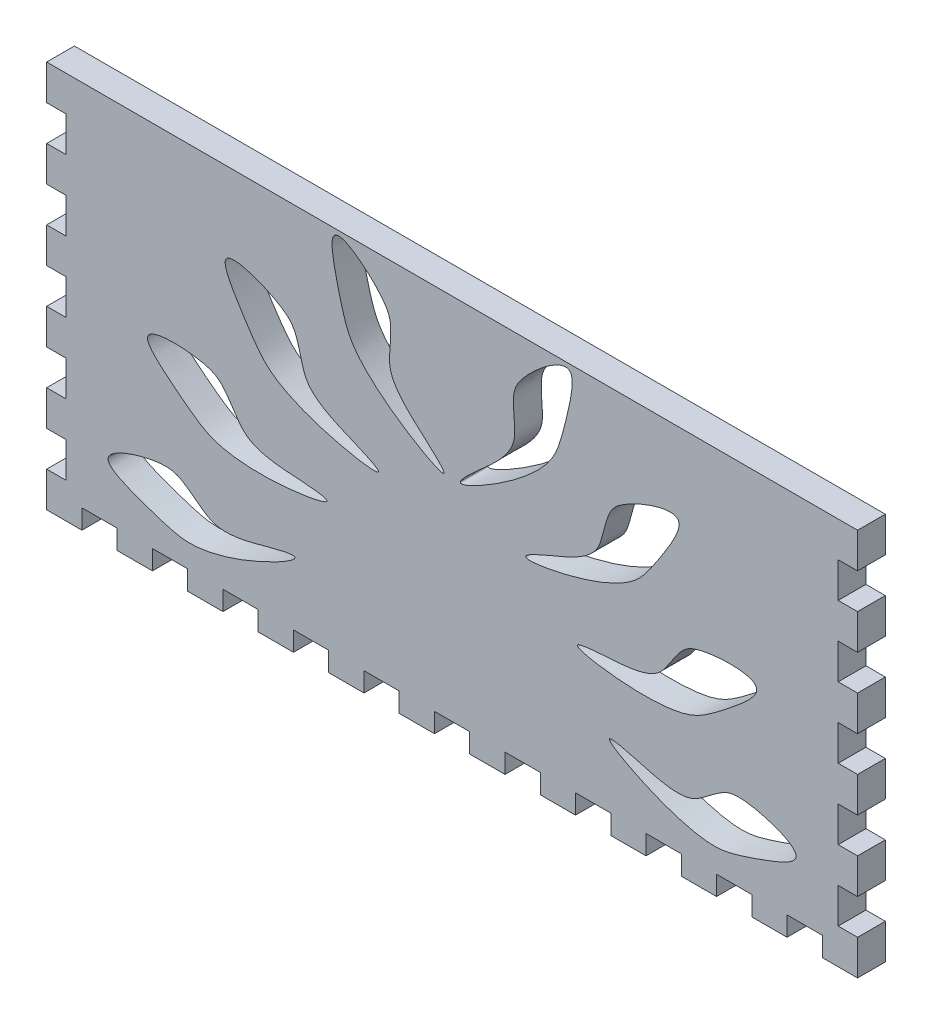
ISO-10303-21;
HEADER;
FILE_DESCRIPTION(('STEP AP214'),'2;1');
FILE_NAME('part.step','',(''),(''),'','','');
FILE_SCHEMA(('AUTOMOTIVE_DESIGN { 1 0 10303 214 1 1 1 1 }'));
ENDSEC;
DATA;
#1=APPLICATION_CONTEXT('core data for automotive mechanical design processes');
#2=APPLICATION_PROTOCOL_DEFINITION('international standard','automotive_design',2000,#1);
#3=PRODUCT_CONTEXT('',#1,'mechanical');
#4=PRODUCT('Part','Part','',(#3));
#5=PRODUCT_RELATED_PRODUCT_CATEGORY('part','',(#4));
#6=PRODUCT_DEFINITION_FORMATION('','',#4);
#7=PRODUCT_DEFINITION_CONTEXT('part definition',#1,'design');
#8=PRODUCT_DEFINITION('design','',#6,#7);
#9=PRODUCT_DEFINITION_SHAPE('','',#8);
#10=(LENGTH_UNIT() NAMED_UNIT(*) SI_UNIT(.MILLI.,.METRE.));
#11=(NAMED_UNIT(*) PLANE_ANGLE_UNIT() SI_UNIT($,.RADIAN.));
#12=(NAMED_UNIT(*) SI_UNIT($,.STERADIAN.) SOLID_ANGLE_UNIT());
#13=UNCERTAINTY_MEASURE_WITH_UNIT(LENGTH_MEASURE(1.E-05),#10,'distance_accuracy_value','');
#14=(GEOMETRIC_REPRESENTATION_CONTEXT(3) GLOBAL_UNCERTAINTY_ASSIGNED_CONTEXT((#13)) GLOBAL_UNIT_ASSIGNED_CONTEXT((#10,
#11,#12)) REPRESENTATION_CONTEXT('',''));
#15=CARTESIAN_POINT('',(0.,0.,0.));
#16=DIRECTION('',(0.,0.,1.));
#17=DIRECTION('',(1.,0.,0.));
#18=AXIS2_PLACEMENT_3D('',#15,#16,#17);
#19=CARTESIAN_POINT('',(0.,0.,3.999992));
#20=DIRECTION('',(0.,0.,-1.));
#21=DIRECTION('',(-1.,0.,0.));
#22=AXIS2_PLACEMENT_3D('',#19,#20,#21);
#23=PLANE('',#22);
#24=CARTESIAN_POINT('',(3.84861845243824,8.15483180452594,3.999992));
#25=CARTESIAN_POINT('',(2.44206595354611,6.89675258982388,3.999992));
#26=CARTESIAN_POINT('',(-1.31133953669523,3.21749565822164,3.999992));
#27=CARTESIAN_POINT('',(7.09085272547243,7.75757139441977,3.999992));
#28=CARTESIAN_POINT('',(14.272472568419,13.9563641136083,3.999992));
#29=CARTESIAN_POINT('',(15.3910449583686,16.6975795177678,3.999992));
#30=CARTESIAN_POINT('',(16.7502838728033,21.9501076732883,3.999992));
#31=CARTESIAN_POINT('',(18.483534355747,30.3805892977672,3.999992));
#32=CARTESIAN_POINT('',(8.37309140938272,21.9877543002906,3.999992));
#33=CARTESIAN_POINT('',(8.79967833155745,19.4858828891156,3.999992));
#34=CARTESIAN_POINT('',(9.20980571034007,12.7316778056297,3.999992));
#35=CARTESIAN_POINT('',(5.80206769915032,9.90207827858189,3.999992));
#36=CARTESIAN_POINT('',(3.84861845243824,8.15483180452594,3.999992));
#37=B_SPLINE_CURVE_WITH_KNOTS('',3,(#24,#25,#26,#27,#28,#29,#30,#31,#32,#33,#34,#35,#36),
.UNSPECIFIED.,.T.,.F.,(4,1,1,1,1,1,1,1,1,1,4),(0.,0.0618464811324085,0.224395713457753,
0.259527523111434,0.413164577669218,0.491748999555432,0.594995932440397,0.763119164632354,
0.890418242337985,0.914106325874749,1.),.UNSPECIFIED.);
#38=CARTESIAN_POINT('',(3.84861845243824,8.15483180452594,3.999992));
#39=VERTEX_POINT('',#38);
#40=EDGE_CURVE('E1309',#39,#39,#37,.T.);
#41=ORIENTED_EDGE('',*,*,#40,.F.);
#42=EDGE_LOOP('',(#41));
#43=FACE_BOUND('',#42,.T.);
#44=CARTESIAN_POINT('',(14.0654821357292,2.60673811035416,3.999992));
#45=CARTESIAN_POINT('',(12.3259700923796,1.87512954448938,3.999992));
#46=CARTESIAN_POINT('',(7.57920659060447,-0.381686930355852,3.999992));
#47=CARTESIAN_POINT('',(17.0017395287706,1.17555278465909,3.999992));
#48=CARTESIAN_POINT('',(25.8102239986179,4.69851972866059,3.999992));
#49=CARTESIAN_POINT('',(27.7603074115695,6.92621826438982,3.999992));
#50=CARTESIAN_POINT('',(30.755548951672,11.450056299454,3.999992));
#51=CARTESIAN_POINT('',(35.1390658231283,18.8569421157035,3.999992));
#52=CARTESIAN_POINT('',(22.8470144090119,14.2129989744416,3.999992));
#53=CARTESIAN_POINT('',(22.4358306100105,11.7085499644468,3.999992));
#54=CARTESIAN_POINT('',(20.6246595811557,5.18879918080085,3.999992));
#55=CARTESIAN_POINT('',(16.4813524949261,3.6228112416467,3.999992));
#56=CARTESIAN_POINT('',(14.0654821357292,2.60673811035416,3.999992));
#57=B_SPLINE_CURVE_WITH_KNOTS('',3,(#44,#45,#46,#47,#48,#49,#50,#51,#52,#53,#54,#55,#56),
.UNSPECIFIED.,.T.,.F.,(4,1,1,1,1,1,1,1,1,1,4),(0.,0.0618464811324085,0.224395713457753,
0.259527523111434,0.413164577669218,0.491748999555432,0.594995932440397,0.763119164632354,
0.890418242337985,0.914106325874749,1.),.UNSPECIFIED.);
#58=CARTESIAN_POINT('',(14.0654821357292,2.60673811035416,3.999992));
#59=VERTEX_POINT('',#58);
#60=EDGE_CURVE('E1292',#59,#59,#57,.T.);
#61=ORIENTED_EDGE('',*,*,#60,.F.);
#62=EDGE_LOOP('',(#61));
#63=FACE_BOUND('',#62,.T.);
#64=CARTESIAN_POINT('',(21.9194339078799,-5.96537299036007,3.999992));
#65=CARTESIAN_POINT('',(20.0365045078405,-6.09079275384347,3.999992));
#66=CARTESIAN_POINT('',(14.8136038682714,-6.67925961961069,3.999992));
#67=CARTESIAN_POINT('',(24.2297714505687,-8.27453720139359,3.999992));
#68=CARTESIAN_POINT('',(33.7053229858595,-7.81126854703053,3.999992));
#69=CARTESIAN_POINT('',(36.2744307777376,-6.33982325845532,3.999992));
#70=CARTESIAN_POINT('',(40.5793048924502,-3.03760562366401,3.999992));
#71=CARTESIAN_POINT('',(47.1354476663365,2.53860900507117,3.999992));
#72=CARTESIAN_POINT('',(34.001164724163,2.14957499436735,3.999992));
#73=CARTESIAN_POINT('',(32.7970139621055,-0.0845597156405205,3.999992));
#74=CARTESIAN_POINT('',(28.9618948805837,-5.65944558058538,3.999992));
#75=CARTESIAN_POINT('',(24.5344852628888,-5.7911874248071,3.999992));
#76=CARTESIAN_POINT('',(21.9194339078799,-5.96537299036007,3.999992));
#77=B_SPLINE_CURVE_WITH_KNOTS('',3,(#64,#65,#66,#67,#68,#69,#70,#71,#72,#73,#74,#75,#76),
.UNSPECIFIED.,.T.,.F.,(4,1,1,1,1,1,1,1,1,1,4),(0.,0.0618464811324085,0.224395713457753,
0.259527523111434,0.413164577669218,0.491748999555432,0.594995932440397,0.763119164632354,
0.890418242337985,0.914106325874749,1.),.UNSPECIFIED.);
#78=CARTESIAN_POINT('',(21.9194339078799,-5.96537299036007,3.999992));
#79=VERTEX_POINT('',#78);
#80=EDGE_CURVE('E1266',#79,#79,#77,.T.);
#81=ORIENTED_EDGE('',*,*,#80,.F.);
#82=EDGE_LOOP('',(#81));
#83=FACE_BOUND('',#82,.T.);
#84=CARTESIAN_POINT('',(26.5546848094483,-16.6274598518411,3.999992));
#85=CARTESIAN_POINT('',(24.7335074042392,-16.133024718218,3.999992));
#86=CARTESIAN_POINT('',(19.6035717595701,-14.989020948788,3.999992));
#87=CARTESIAN_POINT('',(27.9873615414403,-19.5629898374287,3.999992));
#88=CARTESIAN_POINT('',(37.0974970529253,-22.2098985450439,3.999992));
#89=CARTESIAN_POINT('',(40.0056919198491,-21.6550393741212,3.999992));
#90=CARTESIAN_POINT('',(45.1511272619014,-19.9342611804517,3.999992));
#91=CARTESIAN_POINT('',(53.1655199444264,-16.7963179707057,3.999992));
#92=CARTESIAN_POINT('',(40.6201543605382,-12.8880525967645,3.999992));
#93=CARTESIAN_POINT('',(38.7542443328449,-14.608435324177,3.999992));
#94=CARTESIAN_POINT('',(33.3130626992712,-18.6310008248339,3.999992));
#95=CARTESIAN_POINT('',(29.0839737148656,-17.3141416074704,3.999992));
#96=CARTESIAN_POINT('',(26.5546848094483,-16.6274598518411,3.999992));
#97=B_SPLINE_CURVE_WITH_KNOTS('',3,(#84,#85,#86,#87,#88,#89,#90,#91,#92,#93,#94,#95,#96),
.UNSPECIFIED.,.T.,.F.,(4,1,1,1,1,1,1,1,1,1,4),(0.,0.0618464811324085,0.224395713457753,
0.259527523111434,0.413164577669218,0.491748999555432,0.594995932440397,0.763119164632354,
0.890418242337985,0.914106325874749,1.),.UNSPECIFIED.);
#98=CARTESIAN_POINT('',(26.5546848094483,-16.6274598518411,3.999992));
#99=VERTEX_POINT('',#98);
#100=EDGE_CURVE('E1265',#99,#99,#97,.T.);
#101=ORIENTED_EDGE('',*,*,#100,.F.);
#102=EDGE_LOOP('',(#101));
#103=FACE_BOUND('',#102,.T.);
#104=DIRECTION('',(1.,0.,0.));
#105=VECTOR('',#104,1.);
#106=CARTESIAN_POINT('',(53.34,-27.94,3.999992));
#107=LINE('',#106,#105);
#108=CARTESIAN_POINT('',(53.34,-27.94,3.999992));
#109=VERTEX_POINT('',#108);
#110=CARTESIAN_POINT('',(58.42,-27.94,3.999992));
#111=VERTEX_POINT('',#110);
#112=EDGE_CURVE('E785',#109,#111,#107,.T.);
#113=ORIENTED_EDGE('',*,*,#112,.T.);
#114=DIRECTION('',(0.,1.,0.));
#115=VECTOR('',#114,1.);
#116=CARTESIAN_POINT('',(58.4200000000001,-22.86,3.999992));
#117=LINE('',#116,#115);
#118=CARTESIAN_POINT('',(58.4200000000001,-22.86,3.999992));
#119=VERTEX_POINT('',#118);
#120=EDGE_CURVE('E333',#111,#119,#117,.T.);
#121=ORIENTED_EDGE('',*,*,#120,.T.);
#122=DIRECTION('',(-1.,0.,0.));
#123=VECTOR('',#122,1.);
#124=CARTESIAN_POINT('',(58.4200000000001,-22.86,3.999992));
#125=LINE('',#124,#123);
#126=CARTESIAN_POINT('',(55.626,-22.86,3.999992));
#127=VERTEX_POINT('',#126);
#128=EDGE_CURVE('E1040',#119,#127,#125,.T.);
#129=ORIENTED_EDGE('',*,*,#128,.T.);
#130=DIRECTION('',(0.,1.,0.));
#131=VECTOR('',#130,1.);
#132=CARTESIAN_POINT('',(55.626,-22.86,3.999992));
#133=LINE('',#132,#131);
#134=CARTESIAN_POINT('',(55.626,-17.78,3.999992));
#135=VERTEX_POINT('',#134);
#136=EDGE_CURVE('E1059',#127,#135,#133,.T.);
#137=ORIENTED_EDGE('',*,*,#136,.T.);
#138=DIRECTION('',(1.,0.,0.));
#139=VECTOR('',#138,1.);
#140=CARTESIAN_POINT('',(55.626,-17.78,3.999992));
#141=LINE('',#140,#139);
#142=CARTESIAN_POINT('',(58.42,-17.78,3.999992));
#143=VERTEX_POINT('',#142);
#144=EDGE_CURVE('E1056',#135,#143,#141,.T.);
#145=ORIENTED_EDGE('',*,*,#144,.T.);
#146=DIRECTION('',(0.,1.,0.));
#147=VECTOR('',#146,1.);
#148=CARTESIAN_POINT('',(58.4200000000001,-12.7,3.999992));
#149=LINE('',#148,#147);
#150=CARTESIAN_POINT('',(58.4200000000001,-12.7,3.999992));
#151=VERTEX_POINT('',#150);
#152=EDGE_CURVE('E1058',#143,#151,#149,.T.);
#153=ORIENTED_EDGE('',*,*,#152,.T.);
#154=DIRECTION('',(-1.,0.,0.));
#155=VECTOR('',#154,1.);
#156=CARTESIAN_POINT('',(58.4200000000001,-12.7,3.999992));
#157=LINE('',#156,#155);
#158=CARTESIAN_POINT('',(55.6260000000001,-12.7,3.999992));
#159=VERTEX_POINT('',#158);
#160=EDGE_CURVE('E1061',#151,#159,#157,.T.);
#161=ORIENTED_EDGE('',*,*,#160,.T.);
#162=DIRECTION('',(0.,1.,0.));
#163=VECTOR('',#162,1.);
#164=CARTESIAN_POINT('',(55.6260000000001,-12.7,3.999992));
#165=LINE('',#164,#163);
#166=CARTESIAN_POINT('',(55.6260000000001,-7.61999999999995,3.999992));
#167=VERTEX_POINT('',#166);
#168=EDGE_CURVE('E1067',#159,#167,#165,.T.);
#169=ORIENTED_EDGE('',*,*,#168,.T.);
#170=DIRECTION('',(1.,0.,0.));
#171=VECTOR('',#170,1.);
#172=CARTESIAN_POINT('',(55.6260000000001,-7.61999999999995,3.999992));
#173=LINE('',#172,#171);
#174=CARTESIAN_POINT('',(58.4200000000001,-7.61999999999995,3.999992));
#175=VERTEX_POINT('',#174);
#176=EDGE_CURVE('E1069',#167,#175,#173,.T.);
#177=ORIENTED_EDGE('',*,*,#176,.T.);
#178=DIRECTION('',(0.,1.,0.));
#179=VECTOR('',#178,1.);
#180=CARTESIAN_POINT('',(58.4200000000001,-2.53999999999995,3.999992));
#181=LINE('',#180,#179);
#182=CARTESIAN_POINT('',(58.4200000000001,-2.53999999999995,3.999992));
#183=VERTEX_POINT('',#182);
#184=EDGE_CURVE('E1071',#175,#183,#181,.T.);
#185=ORIENTED_EDGE('',*,*,#184,.T.);
#186=DIRECTION('',(-1.,0.,0.));
#187=VECTOR('',#186,1.);
#188=CARTESIAN_POINT('',(58.4200000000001,-2.53999999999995,3.999992));
#189=LINE('',#188,#187);
#190=CARTESIAN_POINT('',(55.6260000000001,-2.53999999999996,3.999992));
#191=VERTEX_POINT('',#190);
#192=EDGE_CURVE('E1073',#183,#191,#189,.T.);
#193=ORIENTED_EDGE('',*,*,#192,.T.);
#194=DIRECTION('',(0.,1.,0.));
#195=VECTOR('',#194,1.);
#196=CARTESIAN_POINT('',(55.6260000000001,-2.53999999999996,3.999992));
#197=LINE('',#196,#195);
#198=CARTESIAN_POINT('',(55.6260000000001,2.54000000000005,3.999992));
#199=VERTEX_POINT('',#198);
#200=EDGE_CURVE('E1075',#191,#199,#197,.T.);
#201=ORIENTED_EDGE('',*,*,#200,.T.);
#202=DIRECTION('',(1.,0.,0.));
#203=VECTOR('',#202,1.);
#204=CARTESIAN_POINT('',(55.6260000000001,2.54000000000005,3.999992));
#205=LINE('',#204,#203);
#206=CARTESIAN_POINT('',(58.4200000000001,2.54000000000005,3.999992));
#207=VERTEX_POINT('',#206);
#208=EDGE_CURVE('E1077',#199,#207,#205,.T.);
#209=ORIENTED_EDGE('',*,*,#208,.T.);
#210=DIRECTION('',(0.,1.,0.));
#211=VECTOR('',#210,1.);
#212=CARTESIAN_POINT('',(58.4200000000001,7.62000000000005,3.999992));
#213=LINE('',#212,#211);
#214=CARTESIAN_POINT('',(58.4200000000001,7.62000000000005,3.999992));
#215=VERTEX_POINT('',#214);
#216=EDGE_CURVE('E1079',#207,#215,#213,.T.);
#217=ORIENTED_EDGE('',*,*,#216,.T.);
#218=DIRECTION('',(-1.,0.,0.));
#219=VECTOR('',#218,1.);
#220=CARTESIAN_POINT('',(58.4200000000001,7.62000000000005,3.999992));
#221=LINE('',#220,#219);
#222=CARTESIAN_POINT('',(55.6260000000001,7.62000000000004,3.999992));
#223=VERTEX_POINT('',#222);
#224=EDGE_CURVE('E1081',#215,#223,#221,.T.);
#225=ORIENTED_EDGE('',*,*,#224,.T.);
#226=DIRECTION('',(0.,1.,0.));
#227=VECTOR('',#226,1.);
#228=CARTESIAN_POINT('',(55.6260000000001,7.62000000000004,3.999992));
#229=LINE('',#228,#227);
#230=CARTESIAN_POINT('',(55.6260000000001,12.7,3.999992));
#231=VERTEX_POINT('',#230);
#232=EDGE_CURVE('E1083',#223,#231,#229,.T.);
#233=ORIENTED_EDGE('',*,*,#232,.T.);
#234=DIRECTION('',(1.,0.,0.));
#235=VECTOR('',#234,1.);
#236=CARTESIAN_POINT('',(55.6260000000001,12.7,3.999992));
#237=LINE('',#236,#235);
#238=CARTESIAN_POINT('',(58.4200000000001,12.7,3.999992));
#239=VERTEX_POINT('',#238);
#240=EDGE_CURVE('E1085',#231,#239,#237,.T.);
#241=ORIENTED_EDGE('',*,*,#240,.T.);
#242=DIRECTION('',(0.,1.,0.));
#243=VECTOR('',#242,1.);
#244=CARTESIAN_POINT('',(58.4200000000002,17.78,3.999992));
#245=LINE('',#244,#243);
#246=CARTESIAN_POINT('',(58.4200000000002,17.78,3.999992));
#247=VERTEX_POINT('',#246);
#248=EDGE_CURVE('E1087',#239,#247,#245,.T.);
#249=ORIENTED_EDGE('',*,*,#248,.T.);
#250=DIRECTION('',(-1.,0.,0.));
#251=VECTOR('',#250,1.);
#252=CARTESIAN_POINT('',(58.4200000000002,17.78,3.999992));
#253=LINE('',#252,#251);
#254=CARTESIAN_POINT('',(55.6260000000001,17.78,3.999992));
#255=VERTEX_POINT('',#254);
#256=EDGE_CURVE('E1089',#247,#255,#253,.T.);
#257=ORIENTED_EDGE('',*,*,#256,.T.);
#258=DIRECTION('',(0.,1.,0.));
#259=VECTOR('',#258,1.);
#260=CARTESIAN_POINT('',(55.6260000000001,17.78,3.999992));
#261=LINE('',#260,#259);
#262=CARTESIAN_POINT('',(55.6260000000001,22.86,3.999992));
#263=VERTEX_POINT('',#262);
#264=EDGE_CURVE('E1091',#255,#263,#261,.T.);
#265=ORIENTED_EDGE('',*,*,#264,.T.);
#266=DIRECTION('',(1.,0.,0.));
#267=VECTOR('',#266,1.);
#268=CARTESIAN_POINT('',(55.6260000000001,22.86,3.999992));
#269=LINE('',#268,#267);
#270=CARTESIAN_POINT('',(58.4200000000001,22.86,3.999992));
#271=VERTEX_POINT('',#270);
#272=EDGE_CURVE('E1093',#263,#271,#269,.T.);
#273=ORIENTED_EDGE('',*,*,#272,.T.);
#274=DIRECTION('',(0.,1.,0.));
#275=VECTOR('',#274,1.);
#276=CARTESIAN_POINT('',(58.4200000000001,22.86,3.999992));
#277=LINE('',#276,#275);
#278=CARTESIAN_POINT('',(58.42,27.94,3.999992));
#279=VERTEX_POINT('',#278);
#280=EDGE_CURVE('E1095',#271,#279,#277,.T.);
#281=ORIENTED_EDGE('',*,*,#280,.T.);
#282=DIRECTION('',(-1.,0.,0.));
#283=VECTOR('',#282,1.);
#284=CARTESIAN_POINT('',(-58.42,27.94,3.999992));
#285=LINE('',#284,#283);
#286=CARTESIAN_POINT('',(-58.42,27.94,3.999992));
#287=VERTEX_POINT('',#286);
#288=EDGE_CURVE('E1097',#279,#287,#285,.T.);
#289=ORIENTED_EDGE('',*,*,#288,.T.);
#290=DIRECTION('',(0.,-1.,0.));
#291=VECTOR('',#290,1.);
#292=CARTESIAN_POINT('',(-58.4200000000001,22.86,3.999992));
#293=LINE('',#292,#291);
#294=CARTESIAN_POINT('',(-58.4200000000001,22.86,3.999992));
#295=VERTEX_POINT('',#294);
#296=EDGE_CURVE('E1099',#287,#295,#293,.T.);
#297=ORIENTED_EDGE('',*,*,#296,.T.);
#298=DIRECTION('',(1.,0.,0.));
#299=VECTOR('',#298,1.);
#300=CARTESIAN_POINT('',(-55.6260000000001,22.86,3.999992));
#301=LINE('',#300,#299);
#302=CARTESIAN_POINT('',(-55.6260000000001,22.86,3.999992));
#303=VERTEX_POINT('',#302);
#304=EDGE_CURVE('E1101',#295,#303,#301,.T.);
#305=ORIENTED_EDGE('',*,*,#304,.T.);
#306=DIRECTION('',(0.,-1.,0.));
#307=VECTOR('',#306,1.);
#308=CARTESIAN_POINT('',(-55.6260000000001,17.78,3.999992));
#309=LINE('',#308,#307);
#310=CARTESIAN_POINT('',(-55.6260000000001,17.78,3.999992));
#311=VERTEX_POINT('',#310);
#312=EDGE_CURVE('E1103',#303,#311,#309,.T.);
#313=ORIENTED_EDGE('',*,*,#312,.T.);
#314=DIRECTION('',(-1.,0.,0.));
#315=VECTOR('',#314,1.);
#316=CARTESIAN_POINT('',(-58.4200000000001,17.78,3.999992));
#317=LINE('',#316,#315);
#318=CARTESIAN_POINT('',(-58.4200000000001,17.78,3.999992));
#319=VERTEX_POINT('',#318);
#320=EDGE_CURVE('E1105',#311,#319,#317,.T.);
#321=ORIENTED_EDGE('',*,*,#320,.T.);
#322=DIRECTION('',(0.,-1.,0.));
#323=VECTOR('',#322,1.);
#324=CARTESIAN_POINT('',(-58.4200000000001,17.78,3.999992));
#325=LINE('',#324,#323);
#326=CARTESIAN_POINT('',(-58.4200000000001,12.7,3.999992));
#327=VERTEX_POINT('',#326);
#328=EDGE_CURVE('E1107',#319,#327,#325,.T.);
#329=ORIENTED_EDGE('',*,*,#328,.T.);
#330=DIRECTION('',(1.,0.,0.));
#331=VECTOR('',#330,1.);
#332=CARTESIAN_POINT('',(-55.6260000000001,12.7,3.999992));
#333=LINE('',#332,#331);
#334=CARTESIAN_POINT('',(-55.6260000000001,12.7,3.999992));
#335=VERTEX_POINT('',#334);
#336=EDGE_CURVE('E1109',#327,#335,#333,.T.);
#337=ORIENTED_EDGE('',*,*,#336,.T.);
#338=DIRECTION('',(0.,-1.,0.));
#339=VECTOR('',#338,1.);
#340=CARTESIAN_POINT('',(-55.6260000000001,7.61999999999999,3.999992));
#341=LINE('',#340,#339);
#342=CARTESIAN_POINT('',(-55.6260000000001,7.61999999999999,3.999992));
#343=VERTEX_POINT('',#342);
#344=EDGE_CURVE('E1111',#335,#343,#341,.T.);
#345=ORIENTED_EDGE('',*,*,#344,.T.);
#346=DIRECTION('',(-1.,0.,0.));
#347=VECTOR('',#346,1.);
#348=CARTESIAN_POINT('',(-58.4200000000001,7.61999999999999,3.999992));
#349=LINE('',#348,#347);
#350=CARTESIAN_POINT('',(-58.4200000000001,7.61999999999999,3.999992));
#351=VERTEX_POINT('',#350);
#352=EDGE_CURVE('E1113',#343,#351,#349,.T.);
#353=ORIENTED_EDGE('',*,*,#352,.T.);
#354=DIRECTION('',(0.,-1.,0.));
#355=VECTOR('',#354,1.);
#356=CARTESIAN_POINT('',(-58.4200000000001,7.61999999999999,3.999992));
#357=LINE('',#356,#355);
#358=CARTESIAN_POINT('',(-58.4200000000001,2.53999999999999,3.999992));
#359=VERTEX_POINT('',#358);
#360=EDGE_CURVE('E1115',#351,#359,#357,.T.);
#361=ORIENTED_EDGE('',*,*,#360,.T.);
#362=DIRECTION('',(1.,0.,0.));
#363=VECTOR('',#362,1.);
#364=CARTESIAN_POINT('',(-55.626,2.53999999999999,3.999992));
#365=LINE('',#364,#363);
#366=CARTESIAN_POINT('',(-55.626,2.53999999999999,3.999992));
#367=VERTEX_POINT('',#366);
#368=EDGE_CURVE('E1117',#359,#367,#365,.T.);
#369=ORIENTED_EDGE('',*,*,#368,.T.);
#370=DIRECTION('',(0.,-1.,0.));
#371=VECTOR('',#370,1.);
#372=CARTESIAN_POINT('',(-55.626,-2.54000000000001,3.999992));
#373=LINE('',#372,#371);
#374=CARTESIAN_POINT('',(-55.626,-2.54000000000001,3.999992));
#375=VERTEX_POINT('',#374);
#376=EDGE_CURVE('E1119',#367,#375,#373,.T.);
#377=ORIENTED_EDGE('',*,*,#376,.T.);
#378=DIRECTION('',(-1.,0.,0.));
#379=VECTOR('',#378,1.);
#380=CARTESIAN_POINT('',(-58.4200000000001,-2.54000000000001,3.999992));
#381=LINE('',#380,#379);
#382=CARTESIAN_POINT('',(-58.4200000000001,-2.54000000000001,3.999992));
#383=VERTEX_POINT('',#382);
#384=EDGE_CURVE('E1121',#375,#383,#381,.T.);
#385=ORIENTED_EDGE('',*,*,#384,.T.);
#386=DIRECTION('',(0.,-1.,0.));
#387=VECTOR('',#386,1.);
#388=CARTESIAN_POINT('',(-58.4200000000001,-2.54000000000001,3.999992));
#389=LINE('',#388,#387);
#390=CARTESIAN_POINT('',(-58.42,-7.62000000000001,3.999992));
#391=VERTEX_POINT('',#390);
#392=EDGE_CURVE('E1123',#383,#391,#389,.T.);
#393=ORIENTED_EDGE('',*,*,#392,.T.);
#394=DIRECTION('',(1.,0.,0.));
#395=VECTOR('',#394,1.);
#396=CARTESIAN_POINT('',(-55.626,-7.62000000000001,3.999992));
#397=LINE('',#396,#395);
#398=CARTESIAN_POINT('',(-55.626,-7.62000000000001,3.999992));
#399=VERTEX_POINT('',#398);
#400=EDGE_CURVE('E1125',#391,#399,#397,.T.);
#401=ORIENTED_EDGE('',*,*,#400,.T.);
#402=DIRECTION('',(0.,-1.,0.));
#403=VECTOR('',#402,1.);
#404=CARTESIAN_POINT('',(-55.626,-12.7,3.999992));
#405=LINE('',#404,#403);
#406=CARTESIAN_POINT('',(-55.626,-12.7,3.999992));
#407=VERTEX_POINT('',#406);
#408=EDGE_CURVE('E1127',#399,#407,#405,.T.);
#409=ORIENTED_EDGE('',*,*,#408,.T.);
#410=DIRECTION('',(-1.,0.,0.));
#411=VECTOR('',#410,1.);
#412=CARTESIAN_POINT('',(-58.42,-12.7,3.999992));
#413=LINE('',#412,#411);
#414=CARTESIAN_POINT('',(-58.42,-12.7,3.999992));
#415=VERTEX_POINT('',#414);
#416=EDGE_CURVE('E1129',#407,#415,#413,.T.);
#417=ORIENTED_EDGE('',*,*,#416,.T.);
#418=DIRECTION('',(0.,-1.,0.));
#419=VECTOR('',#418,1.);
#420=CARTESIAN_POINT('',(-58.42,-12.7,3.999992));
#421=LINE('',#420,#419);
#422=CARTESIAN_POINT('',(-58.42,-17.78,3.999992));
#423=VERTEX_POINT('',#422);
#424=EDGE_CURVE('E1131',#415,#423,#421,.T.);
#425=ORIENTED_EDGE('',*,*,#424,.T.);
#426=DIRECTION('',(1.,0.,0.));
#427=VECTOR('',#426,1.);
#428=CARTESIAN_POINT('',(-55.626,-17.78,3.999992));
#429=LINE('',#428,#427);
#430=CARTESIAN_POINT('',(-55.626,-17.78,3.999992));
#431=VERTEX_POINT('',#430);
#432=EDGE_CURVE('E1133',#423,#431,#429,.T.);
#433=ORIENTED_EDGE('',*,*,#432,.T.);
#434=DIRECTION('',(0.,-1.,0.));
#435=VECTOR('',#434,1.);
#436=CARTESIAN_POINT('',(-55.626,-22.86,3.999992));
#437=LINE('',#436,#435);
#438=CARTESIAN_POINT('',(-55.626,-22.86,3.999992));
#439=VERTEX_POINT('',#438);
#440=EDGE_CURVE('E1135',#431,#439,#437,.T.);
#441=ORIENTED_EDGE('',*,*,#440,.T.);
#442=DIRECTION('',(-1.,0.,0.));
#443=VECTOR('',#442,1.);
#444=CARTESIAN_POINT('',(-58.42,-22.86,3.999992));
#445=LINE('',#444,#443);
#446=CARTESIAN_POINT('',(-58.42,-22.86,3.999992));
#447=VERTEX_POINT('',#446);
#448=EDGE_CURVE('E1137',#439,#447,#445,.T.);
#449=ORIENTED_EDGE('',*,*,#448,.T.);
#450=DIRECTION('',(0.,-1.,0.));
#451=VECTOR('',#450,1.);
#452=CARTESIAN_POINT('',(-58.42,-22.86,3.999992));
#453=LINE('',#452,#451);
#454=CARTESIAN_POINT('',(-58.42,-27.94,3.999992));
#455=VERTEX_POINT('',#454);
#456=EDGE_CURVE('E1139',#447,#455,#453,.T.);
#457=ORIENTED_EDGE('',*,*,#456,.T.);
#458=DIRECTION('',(1.,0.,0.));
#459=VECTOR('',#458,1.);
#460=CARTESIAN_POINT('',(-58.42,-27.94,3.999992));
#461=LINE('',#460,#459);
#462=CARTESIAN_POINT('',(-53.34,-27.94,3.999992));
#463=VERTEX_POINT('',#462);
#464=EDGE_CURVE('E1141',#455,#463,#461,.T.);
#465=ORIENTED_EDGE('',*,*,#464,.T.);
#466=DIRECTION('',(0.,1.,0.));
#467=VECTOR('',#466,1.);
#468=CARTESIAN_POINT('',(-53.34,-27.94,3.999992));
#469=LINE('',#468,#467);
#470=CARTESIAN_POINT('',(-53.34,-25.146,3.999992));
#471=VERTEX_POINT('',#470);
#472=EDGE_CURVE('E1143',#463,#471,#469,.T.);
#473=ORIENTED_EDGE('',*,*,#472,.T.);
#474=DIRECTION('',(1.,0.,0.));
#475=VECTOR('',#474,1.);
#476=CARTESIAN_POINT('',(-53.34,-25.146,3.999992));
#477=LINE('',#476,#475);
#478=CARTESIAN_POINT('',(-48.26,-25.146,3.999992));
#479=VERTEX_POINT('',#478);
#480=EDGE_CURVE('E1145',#471,#479,#477,.T.);
#481=ORIENTED_EDGE('',*,*,#480,.T.);
#482=DIRECTION('',(0.,-1.,0.));
#483=VECTOR('',#482,1.);
#484=CARTESIAN_POINT('',(-48.26,-25.146,3.999992));
#485=LINE('',#484,#483);
#486=CARTESIAN_POINT('',(-48.26,-27.94,3.999992));
#487=VERTEX_POINT('',#486);
#488=EDGE_CURVE('E1147',#479,#487,#485,.T.);
#489=ORIENTED_EDGE('',*,*,#488,.T.);
#490=DIRECTION('',(1.,0.,0.));
#491=VECTOR('',#490,1.);
#492=CARTESIAN_POINT('',(-48.26,-27.94,3.999992));
#493=LINE('',#492,#491);
#494=CARTESIAN_POINT('',(-43.18,-27.94,3.999992));
#495=VERTEX_POINT('',#494);
#496=EDGE_CURVE('E1149',#487,#495,#493,.T.);
#497=ORIENTED_EDGE('',*,*,#496,.T.);
#498=DIRECTION('',(0.,1.,0.));
#499=VECTOR('',#498,1.);
#500=CARTESIAN_POINT('',(-43.18,-27.94,3.999992));
#501=LINE('',#500,#499);
#502=CARTESIAN_POINT('',(-43.18,-25.146,3.999992));
#503=VERTEX_POINT('',#502);
#504=EDGE_CURVE('E1151',#495,#503,#501,.T.);
#505=ORIENTED_EDGE('',*,*,#504,.T.);
#506=DIRECTION('',(1.,0.,0.));
#507=VECTOR('',#506,1.);
#508=CARTESIAN_POINT('',(-43.18,-25.146,3.999992));
#509=LINE('',#508,#507);
#510=CARTESIAN_POINT('',(-38.1,-25.146,3.999992));
#511=VERTEX_POINT('',#510);
#512=EDGE_CURVE('E1153',#503,#511,#509,.T.);
#513=ORIENTED_EDGE('',*,*,#512,.T.);
#514=DIRECTION('',(0.,-1.,0.));
#515=VECTOR('',#514,1.);
#516=CARTESIAN_POINT('',(-38.1,-25.146,3.999992));
#517=LINE('',#516,#515);
#518=CARTESIAN_POINT('',(-38.1,-27.94,3.999992));
#519=VERTEX_POINT('',#518);
#520=EDGE_CURVE('E1155',#511,#519,#517,.T.);
#521=ORIENTED_EDGE('',*,*,#520,.T.);
#522=DIRECTION('',(1.,0.,0.));
#523=VECTOR('',#522,1.);
#524=CARTESIAN_POINT('',(-38.1,-27.94,3.999992));
#525=LINE('',#524,#523);
#526=CARTESIAN_POINT('',(-33.02,-27.94,3.999992));
#527=VERTEX_POINT('',#526);
#528=EDGE_CURVE('E1157',#519,#527,#525,.T.);
#529=ORIENTED_EDGE('',*,*,#528,.T.);
#530=DIRECTION('',(0.,1.,0.));
#531=VECTOR('',#530,1.);
#532=CARTESIAN_POINT('',(-33.02,-27.94,3.999992));
#533=LINE('',#532,#531);
#534=CARTESIAN_POINT('',(-33.02,-25.146,3.999992));
#535=VERTEX_POINT('',#534);
#536=EDGE_CURVE('E1159',#527,#535,#533,.T.);
#537=ORIENTED_EDGE('',*,*,#536,.T.);
#538=DIRECTION('',(1.,0.,0.));
#539=VECTOR('',#538,1.);
#540=CARTESIAN_POINT('',(-33.02,-25.146,3.999992));
#541=LINE('',#540,#539);
#542=CARTESIAN_POINT('',(-27.94,-25.146,3.999992));
#543=VERTEX_POINT('',#542);
#544=EDGE_CURVE('E1161',#535,#543,#541,.T.);
#545=ORIENTED_EDGE('',*,*,#544,.T.);
#546=DIRECTION('',(0.,-1.,0.));
#547=VECTOR('',#546,1.);
#548=CARTESIAN_POINT('',(-27.94,-25.146,3.999992));
#549=LINE('',#548,#547);
#550=CARTESIAN_POINT('',(-27.94,-27.94,3.999992));
#551=VERTEX_POINT('',#550);
#552=EDGE_CURVE('E1163',#543,#551,#549,.T.);
#553=ORIENTED_EDGE('',*,*,#552,.T.);
#554=DIRECTION('',(1.,0.,0.));
#555=VECTOR('',#554,1.);
#556=CARTESIAN_POINT('',(-27.94,-27.94,3.999992));
#557=LINE('',#556,#555);
#558=CARTESIAN_POINT('',(-22.86,-27.94,3.999992));
#559=VERTEX_POINT('',#558);
#560=EDGE_CURVE('E1165',#551,#559,#557,.T.);
#561=ORIENTED_EDGE('',*,*,#560,.T.);
#562=DIRECTION('',(0.,1.,0.));
#563=VECTOR('',#562,1.);
#564=CARTESIAN_POINT('',(-22.86,-27.94,3.999992));
#565=LINE('',#564,#563);
#566=CARTESIAN_POINT('',(-22.86,-25.146,3.999992));
#567=VERTEX_POINT('',#566);
#568=EDGE_CURVE('E1167',#559,#567,#565,.T.);
#569=ORIENTED_EDGE('',*,*,#568,.T.);
#570=DIRECTION('',(1.,0.,0.));
#571=VECTOR('',#570,1.);
#572=CARTESIAN_POINT('',(-22.86,-25.146,3.999992));
#573=LINE('',#572,#571);
#574=CARTESIAN_POINT('',(-17.78,-25.146,3.999992));
#575=VERTEX_POINT('',#574);
#576=EDGE_CURVE('E1169',#567,#575,#573,.T.);
#577=ORIENTED_EDGE('',*,*,#576,.T.);
#578=DIRECTION('',(0.,-1.,0.));
#579=VECTOR('',#578,1.);
#580=CARTESIAN_POINT('',(-17.78,-25.146,3.999992));
#581=LINE('',#580,#579);
#582=CARTESIAN_POINT('',(-17.78,-27.94,3.999992));
#583=VERTEX_POINT('',#582);
#584=EDGE_CURVE('E1171',#575,#583,#581,.T.);
#585=ORIENTED_EDGE('',*,*,#584,.T.);
#586=DIRECTION('',(1.,0.,0.));
#587=VECTOR('',#586,1.);
#588=CARTESIAN_POINT('',(-17.78,-27.94,3.999992));
#589=LINE('',#588,#587);
#590=CARTESIAN_POINT('',(-12.7,-27.94,3.999992));
#591=VERTEX_POINT('',#590);
#592=EDGE_CURVE('E1173',#583,#591,#589,.T.);
#593=ORIENTED_EDGE('',*,*,#592,.T.);
#594=DIRECTION('',(0.,1.,0.));
#595=VECTOR('',#594,1.);
#596=CARTESIAN_POINT('',(-12.7,-27.94,3.999992));
#597=LINE('',#596,#595);
#598=CARTESIAN_POINT('',(-12.7,-25.146,3.999992));
#599=VERTEX_POINT('',#598);
#600=EDGE_CURVE('E1175',#591,#599,#597,.T.);
#601=ORIENTED_EDGE('',*,*,#600,.T.);
#602=DIRECTION('',(1.,0.,0.));
#603=VECTOR('',#602,1.);
#604=CARTESIAN_POINT('',(-12.7,-25.146,3.999992));
#605=LINE('',#604,#603);
#606=CARTESIAN_POINT('',(-7.61999999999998,-25.146,3.999992));
#607=VERTEX_POINT('',#606);
#608=EDGE_CURVE('E1177',#599,#607,#605,.T.);
#609=ORIENTED_EDGE('',*,*,#608,.T.);
#610=DIRECTION('',(0.,-1.,0.));
#611=VECTOR('',#610,1.);
#612=CARTESIAN_POINT('',(-7.61999999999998,-25.146,3.999992));
#613=LINE('',#612,#611);
#614=CARTESIAN_POINT('',(-7.61999999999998,-27.94,3.999992));
#615=VERTEX_POINT('',#614);
#616=EDGE_CURVE('E1179',#607,#615,#613,.T.);
#617=ORIENTED_EDGE('',*,*,#616,.T.);
#618=DIRECTION('',(1.,0.,0.));
#619=VECTOR('',#618,1.);
#620=CARTESIAN_POINT('',(-7.61999999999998,-27.94,3.999992));
#621=LINE('',#620,#619);
#622=CARTESIAN_POINT('',(-2.53999999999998,-27.94,3.999992));
#623=VERTEX_POINT('',#622);
#624=EDGE_CURVE('E1181',#615,#623,#621,.T.);
#625=ORIENTED_EDGE('',*,*,#624,.T.);
#626=DIRECTION('',(0.,1.,0.));
#627=VECTOR('',#626,1.);
#628=CARTESIAN_POINT('',(-2.53999999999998,-27.94,3.999992));
#629=LINE('',#628,#627);
#630=CARTESIAN_POINT('',(-2.53999999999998,-25.146,3.999992));
#631=VERTEX_POINT('',#630);
#632=EDGE_CURVE('E1183',#623,#631,#629,.T.);
#633=ORIENTED_EDGE('',*,*,#632,.T.);
#634=DIRECTION('',(1.,0.,0.));
#635=VECTOR('',#634,1.);
#636=CARTESIAN_POINT('',(-2.53999999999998,-25.146,3.999992));
#637=LINE('',#636,#635);
#638=CARTESIAN_POINT('',(2.54000000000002,-25.146,3.999992));
#639=VERTEX_POINT('',#638);
#640=EDGE_CURVE('E1185',#631,#639,#637,.T.);
#641=ORIENTED_EDGE('',*,*,#640,.T.);
#642=DIRECTION('',(0.,-1.,0.));
#643=VECTOR('',#642,1.);
#644=CARTESIAN_POINT('',(2.54000000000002,-25.146,3.999992));
#645=LINE('',#644,#643);
#646=CARTESIAN_POINT('',(2.54000000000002,-27.94,3.999992));
#647=VERTEX_POINT('',#646);
#648=EDGE_CURVE('E1187',#639,#647,#645,.T.);
#649=ORIENTED_EDGE('',*,*,#648,.T.);
#650=DIRECTION('',(1.,0.,0.));
#651=VECTOR('',#650,1.);
#652=CARTESIAN_POINT('',(2.54000000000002,-27.94,3.999992));
#653=LINE('',#652,#651);
#654=CARTESIAN_POINT('',(7.62000000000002,-27.94,3.999992));
#655=VERTEX_POINT('',#654);
#656=EDGE_CURVE('E1189',#647,#655,#653,.T.);
#657=ORIENTED_EDGE('',*,*,#656,.T.);
#658=DIRECTION('',(0.,1.,0.));
#659=VECTOR('',#658,1.);
#660=CARTESIAN_POINT('',(7.62000000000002,-27.94,3.999992));
#661=LINE('',#660,#659);
#662=CARTESIAN_POINT('',(7.62000000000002,-25.146,3.999992));
#663=VERTEX_POINT('',#662);
#664=EDGE_CURVE('E1191',#655,#663,#661,.T.);
#665=ORIENTED_EDGE('',*,*,#664,.T.);
#666=DIRECTION('',(1.,0.,0.));
#667=VECTOR('',#666,1.);
#668=CARTESIAN_POINT('',(7.62000000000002,-25.146,3.999992));
#669=LINE('',#668,#667);
#670=CARTESIAN_POINT('',(12.7,-25.146,3.999992));
#671=VERTEX_POINT('',#670);
#672=EDGE_CURVE('E1193',#663,#671,#669,.T.);
#673=ORIENTED_EDGE('',*,*,#672,.T.);
#674=DIRECTION('',(0.,-1.,0.));
#675=VECTOR('',#674,1.);
#676=CARTESIAN_POINT('',(12.7,-25.146,3.999992));
#677=LINE('',#676,#675);
#678=CARTESIAN_POINT('',(12.7,-27.94,3.999992));
#679=VERTEX_POINT('',#678);
#680=EDGE_CURVE('E1195',#671,#679,#677,.T.);
#681=ORIENTED_EDGE('',*,*,#680,.T.);
#682=DIRECTION('',(1.,0.,0.));
#683=VECTOR('',#682,1.);
#684=CARTESIAN_POINT('',(12.7,-27.94,3.999992));
#685=LINE('',#684,#683);
#686=CARTESIAN_POINT('',(17.78,-27.94,3.999992));
#687=VERTEX_POINT('',#686);
#688=EDGE_CURVE('E1197',#679,#687,#685,.T.);
#689=ORIENTED_EDGE('',*,*,#688,.T.);
#690=DIRECTION('',(0.,1.,0.));
#691=VECTOR('',#690,1.);
#692=CARTESIAN_POINT('',(17.78,-27.94,3.999992));
#693=LINE('',#692,#691);
#694=CARTESIAN_POINT('',(17.78,-25.146,3.999992));
#695=VERTEX_POINT('',#694);
#696=EDGE_CURVE('E1199',#687,#695,#693,.T.);
#697=ORIENTED_EDGE('',*,*,#696,.T.);
#698=DIRECTION('',(1.,0.,0.));
#699=VECTOR('',#698,1.);
#700=CARTESIAN_POINT('',(17.78,-25.146,3.999992));
#701=LINE('',#700,#699);
#702=CARTESIAN_POINT('',(22.86,-25.146,3.999992));
#703=VERTEX_POINT('',#702);
#704=EDGE_CURVE('E1201',#695,#703,#701,.T.);
#705=ORIENTED_EDGE('',*,*,#704,.T.);
#706=DIRECTION('',(0.,-1.,0.));
#707=VECTOR('',#706,1.);
#708=CARTESIAN_POINT('',(22.86,-25.146,3.999992));
#709=LINE('',#708,#707);
#710=CARTESIAN_POINT('',(22.86,-27.94,3.999992));
#711=VERTEX_POINT('',#710);
#712=EDGE_CURVE('E1203',#703,#711,#709,.T.);
#713=ORIENTED_EDGE('',*,*,#712,.T.);
#714=DIRECTION('',(1.,0.,0.));
#715=VECTOR('',#714,1.);
#716=CARTESIAN_POINT('',(22.86,-27.94,3.999992));
#717=LINE('',#716,#715);
#718=CARTESIAN_POINT('',(27.94,-27.94,3.999992));
#719=VERTEX_POINT('',#718);
#720=EDGE_CURVE('E1205',#711,#719,#717,.T.);
#721=ORIENTED_EDGE('',*,*,#720,.T.);
#722=DIRECTION('',(0.,1.,0.));
#723=VECTOR('',#722,1.);
#724=CARTESIAN_POINT('',(27.94,-27.94,3.999992));
#725=LINE('',#724,#723);
#726=CARTESIAN_POINT('',(27.94,-25.146,3.999992));
#727=VERTEX_POINT('',#726);
#728=EDGE_CURVE('E1207',#719,#727,#725,.T.);
#729=ORIENTED_EDGE('',*,*,#728,.T.);
#730=DIRECTION('',(1.,0.,0.));
#731=VECTOR('',#730,1.);
#732=CARTESIAN_POINT('',(27.94,-25.146,3.999992));
#733=LINE('',#732,#731);
#734=CARTESIAN_POINT('',(33.02,-25.146,3.999992));
#735=VERTEX_POINT('',#734);
#736=EDGE_CURVE('E1209',#727,#735,#733,.T.);
#737=ORIENTED_EDGE('',*,*,#736,.T.);
#738=DIRECTION('',(0.,-1.,0.));
#739=VECTOR('',#738,1.);
#740=CARTESIAN_POINT('',(33.02,-25.146,3.999992));
#741=LINE('',#740,#739);
#742=CARTESIAN_POINT('',(33.02,-27.94,3.999992));
#743=VERTEX_POINT('',#742);
#744=EDGE_CURVE('E1211',#735,#743,#741,.T.);
#745=ORIENTED_EDGE('',*,*,#744,.T.);
#746=DIRECTION('',(1.,0.,0.));
#747=VECTOR('',#746,1.);
#748=CARTESIAN_POINT('',(33.02,-27.94,3.999992));
#749=LINE('',#748,#747);
#750=CARTESIAN_POINT('',(38.1,-27.94,3.999992));
#751=VERTEX_POINT('',#750);
#752=EDGE_CURVE('E1213',#743,#751,#749,.T.);
#753=ORIENTED_EDGE('',*,*,#752,.T.);
#754=DIRECTION('',(0.,1.,0.));
#755=VECTOR('',#754,1.);
#756=CARTESIAN_POINT('',(38.1,-27.94,3.999992));
#757=LINE('',#756,#755);
#758=CARTESIAN_POINT('',(38.1,-25.146,3.999992));
#759=VERTEX_POINT('',#758);
#760=EDGE_CURVE('E1215',#751,#759,#757,.T.);
#761=ORIENTED_EDGE('',*,*,#760,.T.);
#762=DIRECTION('',(1.,0.,0.));
#763=VECTOR('',#762,1.);
#764=CARTESIAN_POINT('',(38.1,-25.146,3.999992));
#765=LINE('',#764,#763);
#766=CARTESIAN_POINT('',(43.18,-25.146,3.999992));
#767=VERTEX_POINT('',#766);
#768=EDGE_CURVE('E1217',#759,#767,#765,.T.);
#769=ORIENTED_EDGE('',*,*,#768,.T.);
#770=DIRECTION('',(0.,-1.,0.));
#771=VECTOR('',#770,1.);
#772=CARTESIAN_POINT('',(43.18,-25.146,3.999992));
#773=LINE('',#772,#771);
#774=CARTESIAN_POINT('',(43.18,-27.94,3.999992));
#775=VERTEX_POINT('',#774);
#776=EDGE_CURVE('E1219',#767,#775,#773,.T.);
#777=ORIENTED_EDGE('',*,*,#776,.T.);
#778=DIRECTION('',(1.,0.,0.));
#779=VECTOR('',#778,1.);
#780=CARTESIAN_POINT('',(43.18,-27.94,3.999992));
#781=LINE('',#780,#779);
#782=CARTESIAN_POINT('',(48.26,-27.94,3.999992));
#783=VERTEX_POINT('',#782);
#784=EDGE_CURVE('E592',#775,#783,#781,.T.);
#785=ORIENTED_EDGE('',*,*,#784,.T.);
#786=DIRECTION('',(0.,1.,0.));
#787=VECTOR('',#786,1.);
#788=CARTESIAN_POINT('',(48.26,-27.94,3.999992));
#789=LINE('',#788,#787);
#790=CARTESIAN_POINT('',(48.26,-25.146,3.999992));
#791=VERTEX_POINT('',#790);
#792=EDGE_CURVE('E586',#783,#791,#789,.T.);
#793=ORIENTED_EDGE('',*,*,#792,.T.);
#794=DIRECTION('',(1.,0.,0.));
#795=VECTOR('',#794,1.);
#796=CARTESIAN_POINT('',(48.26,-25.146,3.999992));
#797=LINE('',#796,#795);
#798=CARTESIAN_POINT('',(53.34,-25.146,3.999992));
#799=VERTEX_POINT('',#798);
#800=EDGE_CURVE('E590',#791,#799,#797,.T.);
#801=ORIENTED_EDGE('',*,*,#800,.T.);
#802=DIRECTION('',(0.,-1.,0.));
#803=VECTOR('',#802,1.);
#804=CARTESIAN_POINT('',(53.34,-25.146,3.999992));
#805=LINE('',#804,#803);
#806=EDGE_CURVE('E50',#799,#109,#805,.T.);
#807=ORIENTED_EDGE('',*,*,#806,.T.);
#808=EDGE_LOOP('',(#113,#121,#129,#137,#145,#153,#161,#169,#177,#185,#193,#201,#209,#217,#225,
#233,#241,#249,#257,#265,#273,#281,#289,#297,#305,#313,#321,#329,#337,#345,#353,#361,#369,#377,
#385,#393,#401,#409,#417,#425,#433,#441,#449,#457,#465,#473,#481,#489,#497,#505,#513,#521,#529,
#537,#545,#553,#561,#569,#577,#585,#593,#601,#609,#617,#625,#633,#641,#649,#657,#665,#673,#681,
#689,#697,#705,#713,#721,#729,#737,#745,#753,#761,#769,#777,#785,#793,#801,#807));
#809=FACE_BOUND('',#808,.T.);
#810=CARTESIAN_POINT('',(-26.5546848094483,-16.6274598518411,3.999992));
#811=CARTESIAN_POINT('',(-24.7335074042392,-16.133024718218,3.999992));
#812=CARTESIAN_POINT('',(-19.6035717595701,-14.989020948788,3.999992));
#813=CARTESIAN_POINT('',(-27.9873615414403,-19.5629898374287,3.999992));
#814=CARTESIAN_POINT('',(-37.0974970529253,-22.2098985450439,3.999992));
#815=CARTESIAN_POINT('',(-40.0056919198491,-21.6550393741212,3.999992));
#816=CARTESIAN_POINT('',(-45.1511272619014,-19.9342611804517,3.999992));
#817=CARTESIAN_POINT('',(-53.1655199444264,-16.7963179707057,3.999992));
#818=CARTESIAN_POINT('',(-40.6201543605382,-12.8880525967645,3.999992));
#819=CARTESIAN_POINT('',(-38.7542443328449,-14.608435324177,3.999992));
#820=CARTESIAN_POINT('',(-33.3130626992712,-18.6310008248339,3.999992));
#821=CARTESIAN_POINT('',(-29.0839737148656,-17.3141416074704,3.999992));
#822=CARTESIAN_POINT('',(-26.5546848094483,-16.6274598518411,3.999992));
#823=B_SPLINE_CURVE_WITH_KNOTS('',3,(#810,#811,#812,#813,#814,#815,#816,#817,#818,#819,#820,
#821,#822),.UNSPECIFIED.,.T.,.F.,(4,1,1,1,1,1,1,1,1,1,4),(0.,0.0618464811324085,
0.224395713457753,0.259527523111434,0.413164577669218,0.491748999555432,0.594995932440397,
0.763119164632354,0.890418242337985,0.914106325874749,1.),.UNSPECIFIED.);
#824=CARTESIAN_POINT('',(-26.5546848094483,-16.6274598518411,3.999992));
#825=VERTEX_POINT('',#824);
#826=EDGE_CURVE('E1332',#825,#825,#823,.T.);
#827=ORIENTED_EDGE('',*,*,#826,.T.);
#828=EDGE_LOOP('',(#827));
#829=FACE_BOUND('',#828,.T.);
#830=CARTESIAN_POINT('',(-21.9194339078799,-5.96537299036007,3.999992));
#831=CARTESIAN_POINT('',(-20.0365045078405,-6.09079275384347,3.999992));
#832=CARTESIAN_POINT('',(-14.8136038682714,-6.67925961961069,3.999992));
#833=CARTESIAN_POINT('',(-24.2297714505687,-8.27453720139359,3.999992));
#834=CARTESIAN_POINT('',(-33.7053229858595,-7.81126854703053,3.999992));
#835=CARTESIAN_POINT('',(-36.2744307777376,-6.33982325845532,3.999992));
#836=CARTESIAN_POINT('',(-40.5793048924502,-3.03760562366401,3.999992));
#837=CARTESIAN_POINT('',(-47.1354476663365,2.53860900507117,3.999992));
#838=CARTESIAN_POINT('',(-34.001164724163,2.14957499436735,3.999992));
#839=CARTESIAN_POINT('',(-32.7970139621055,-0.0845597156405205,3.999992));
#840=CARTESIAN_POINT('',(-28.9618948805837,-5.65944558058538,3.999992));
#841=CARTESIAN_POINT('',(-24.5344852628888,-5.7911874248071,3.999992));
#842=CARTESIAN_POINT('',(-21.9194339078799,-5.96537299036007,3.999992));
#843=B_SPLINE_CURVE_WITH_KNOTS('',3,(#830,#831,#832,#833,#834,#835,#836,#837,#838,#839,#840,
#841,#842),.UNSPECIFIED.,.T.,.F.,(4,1,1,1,1,1,1,1,1,1,4),(0.,0.0618464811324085,
0.224395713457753,0.259527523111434,0.413164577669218,0.491748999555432,0.594995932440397,
0.763119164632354,0.890418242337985,0.914106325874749,1.),.UNSPECIFIED.);
#844=CARTESIAN_POINT('',(-21.9194339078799,-5.96537299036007,3.999992));
#845=VERTEX_POINT('',#844);
#846=EDGE_CURVE('E1349',#845,#845,#843,.T.);
#847=ORIENTED_EDGE('',*,*,#846,.T.);
#848=EDGE_LOOP('',(#847));
#849=FACE_BOUND('',#848,.T.);
#850=CARTESIAN_POINT('',(-3.84861845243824,8.15483180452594,3.999992));
#851=CARTESIAN_POINT('',(-2.44206595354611,6.89675258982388,3.999992));
#852=CARTESIAN_POINT('',(1.31133953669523,3.21749565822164,3.999992));
#853=CARTESIAN_POINT('',(-7.09085272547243,7.75757139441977,3.999992));
#854=CARTESIAN_POINT('',(-14.272472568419,13.9563641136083,3.999992));
#855=CARTESIAN_POINT('',(-15.3910449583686,16.6975795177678,3.999992));
#856=CARTESIAN_POINT('',(-16.7502838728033,21.9501076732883,3.999992));
#857=CARTESIAN_POINT('',(-18.483534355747,30.3805892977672,3.999992));
#858=CARTESIAN_POINT('',(-8.37309140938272,21.9877543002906,3.999992));
#859=CARTESIAN_POINT('',(-8.79967833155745,19.4858828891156,3.999992));
#860=CARTESIAN_POINT('',(-9.20980571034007,12.7316778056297,3.999992));
#861=CARTESIAN_POINT('',(-5.80206769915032,9.90207827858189,3.999992));
#862=CARTESIAN_POINT('',(-3.84861845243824,8.15483180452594,3.999992));
#863=B_SPLINE_CURVE_WITH_KNOTS('',3,(#850,#851,#852,#853,#854,#855,#856,#857,#858,#859,#860,
#861,#862),.UNSPECIFIED.,.T.,.F.,(4,1,1,1,1,1,1,1,1,1,4),(0.,0.0618464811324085,
0.224395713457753,0.259527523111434,0.413164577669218,0.491748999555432,0.594995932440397,
0.763119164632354,0.890418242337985,0.914106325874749,1.),.UNSPECIFIED.);
#864=CARTESIAN_POINT('',(-3.84861845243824,8.15483180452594,3.999992));
#865=VERTEX_POINT('',#864);
#866=EDGE_CURVE('E1388',#865,#865,#863,.T.);
#867=ORIENTED_EDGE('',*,*,#866,.T.);
#868=EDGE_LOOP('',(#867));
#869=FACE_BOUND('',#868,.T.);
#870=CARTESIAN_POINT('',(-14.0654821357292,2.60673811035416,3.999992));
#871=CARTESIAN_POINT('',(-12.3259700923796,1.87512954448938,3.999992));
#872=CARTESIAN_POINT('',(-7.57920659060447,-0.381686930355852,3.999992));
#873=CARTESIAN_POINT('',(-17.0017395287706,1.17555278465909,3.999992));
#874=CARTESIAN_POINT('',(-25.8102239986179,4.69851972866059,3.999992));
#875=CARTESIAN_POINT('',(-27.7603074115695,6.92621826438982,3.999992));
#876=CARTESIAN_POINT('',(-30.755548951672,11.450056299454,3.999992));
#877=CARTESIAN_POINT('',(-35.1390658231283,18.8569421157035,3.999992));
#878=CARTESIAN_POINT('',(-22.8470144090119,14.2129989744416,3.999992));
#879=CARTESIAN_POINT('',(-22.4358306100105,11.7085499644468,3.999992));
#880=CARTESIAN_POINT('',(-20.6246595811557,5.18879918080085,3.999992));
#881=CARTESIAN_POINT('',(-16.4813524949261,3.6228112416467,3.999992));
#882=CARTESIAN_POINT('',(-14.0654821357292,2.60673811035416,3.999992));
#883=B_SPLINE_CURVE_WITH_KNOTS('',3,(#870,#871,#872,#873,#874,#875,#876,#877,#878,#879,#880,
#881,#882),.UNSPECIFIED.,.T.,.F.,(4,1,1,1,1,1,1,1,1,1,4),(0.,0.0618464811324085,
0.224395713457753,0.259527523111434,0.413164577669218,0.491748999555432,0.594995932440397,
0.763119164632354,0.890418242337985,0.914106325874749,1.),.UNSPECIFIED.);
#884=CARTESIAN_POINT('',(-14.0654821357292,2.60673811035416,3.999992));
#885=VERTEX_POINT('',#884);
#886=EDGE_CURVE('E1366',#885,#885,#883,.T.);
#887=ORIENTED_EDGE('',*,*,#886,.T.);
#888=EDGE_LOOP('',(#887));
#889=FACE_BOUND('',#888,.T.);
#890=ADVANCED_FACE('F33',(#43,#63,#83,#103,#809,#829,#849,#869,#889),#23,.F.);
#891=CARTESIAN_POINT('',(0.,0.,0.));
#892=DIRECTION('',(0.,0.,-1.));
#893=DIRECTION('',(-1.,0.,0.));
#894=AXIS2_PLACEMENT_3D('',#891,#892,#893);
#895=PLANE('',#894);
#896=CARTESIAN_POINT('',(-3.84861845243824,8.15483180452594,0.));
#897=CARTESIAN_POINT('',(-2.44206595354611,6.89675258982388,0.));
#898=CARTESIAN_POINT('',(1.31133953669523,3.21749565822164,0.));
#899=CARTESIAN_POINT('',(-7.09085272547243,7.75757139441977,0.));
#900=CARTESIAN_POINT('',(-14.272472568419,13.9563641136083,0.));
#901=CARTESIAN_POINT('',(-15.3910449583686,16.6975795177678,0.));
#902=CARTESIAN_POINT('',(-16.7502838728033,21.9501076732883,0.));
#903=CARTESIAN_POINT('',(-18.483534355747,30.3805892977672,0.));
#904=CARTESIAN_POINT('',(-8.37309140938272,21.9877543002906,0.));
#905=CARTESIAN_POINT('',(-8.79967833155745,19.4858828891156,0.));
#906=CARTESIAN_POINT('',(-9.20980571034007,12.7316778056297,0.));
#907=CARTESIAN_POINT('',(-5.80206769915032,9.90207827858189,0.));
#908=CARTESIAN_POINT('',(-3.84861845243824,8.15483180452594,0.));
#909=B_SPLINE_CURVE_WITH_KNOTS('',3,(#896,#897,#898,#899,#900,#901,#902,#903,#904,#905,#906,
#907,#908),.UNSPECIFIED.,.T.,.F.,(4,1,1,1,1,1,1,1,1,1,4),(0.,0.0618464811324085,
0.224395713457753,0.259527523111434,0.413164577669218,0.491748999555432,0.594995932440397,
0.763119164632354,0.890418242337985,0.914106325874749,1.),.UNSPECIFIED.);
#910=CARTESIAN_POINT('',(-3.84861845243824,8.15483180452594,0.));
#911=VERTEX_POINT('',#910);
#912=EDGE_CURVE('E1395',#911,#911,#909,.T.);
#913=ORIENTED_EDGE('',*,*,#912,.F.);
#914=EDGE_LOOP('',(#913));
#915=FACE_BOUND('',#914,.T.);
#916=CARTESIAN_POINT('',(-26.5546848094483,-16.6274598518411,0.));
#917=CARTESIAN_POINT('',(-24.7335074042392,-16.133024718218,0.));
#918=CARTESIAN_POINT('',(-19.6035717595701,-14.989020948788,0.));
#919=CARTESIAN_POINT('',(-27.9873615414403,-19.5629898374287,0.));
#920=CARTESIAN_POINT('',(-37.0974970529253,-22.2098985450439,0.));
#921=CARTESIAN_POINT('',(-40.0056919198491,-21.6550393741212,0.));
#922=CARTESIAN_POINT('',(-45.1511272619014,-19.9342611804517,0.));
#923=CARTESIAN_POINT('',(-53.1655199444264,-16.7963179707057,0.));
#924=CARTESIAN_POINT('',(-40.6201543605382,-12.8880525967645,0.));
#925=CARTESIAN_POINT('',(-38.7542443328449,-14.608435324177,0.));
#926=CARTESIAN_POINT('',(-33.3130626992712,-18.6310008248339,0.));
#927=CARTESIAN_POINT('',(-29.0839737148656,-17.3141416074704,0.));
#928=CARTESIAN_POINT('',(-26.5546848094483,-16.6274598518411,0.));
#929=B_SPLINE_CURVE_WITH_KNOTS('',3,(#916,#917,#918,#919,#920,#921,#922,#923,#924,#925,#926,
#927,#928),.UNSPECIFIED.,.T.,.F.,(4,1,1,1,1,1,1,1,1,1,4),(0.,0.0618464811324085,
0.224395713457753,0.259527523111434,0.413164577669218,0.491748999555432,0.594995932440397,
0.763119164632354,0.890418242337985,0.914106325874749,1.),.UNSPECIFIED.);
#930=CARTESIAN_POINT('',(-26.5546848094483,-16.6274598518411,0.));
#931=VERTEX_POINT('',#930);
#932=EDGE_CURVE('E1339',#931,#931,#929,.T.);
#933=ORIENTED_EDGE('',*,*,#932,.F.);
#934=EDGE_LOOP('',(#933));
#935=FACE_BOUND('',#934,.T.);
#936=CARTESIAN_POINT('',(3.84861845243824,8.15483180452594,0.));
#937=CARTESIAN_POINT('',(2.44206595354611,6.89675258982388,0.));
#938=CARTESIAN_POINT('',(-1.31133953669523,3.21749565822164,0.));
#939=CARTESIAN_POINT('',(7.09085272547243,7.75757139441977,0.));
#940=CARTESIAN_POINT('',(14.272472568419,13.9563641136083,0.));
#941=CARTESIAN_POINT('',(15.3910449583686,16.6975795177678,0.));
#942=CARTESIAN_POINT('',(16.7502838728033,21.9501076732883,0.));
#943=CARTESIAN_POINT('',(18.483534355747,30.3805892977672,0.));
#944=CARTESIAN_POINT('',(8.37309140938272,21.9877543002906,0.));
#945=CARTESIAN_POINT('',(8.79967833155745,19.4858828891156,0.));
#946=CARTESIAN_POINT('',(9.20980571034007,12.7316778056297,0.));
#947=CARTESIAN_POINT('',(5.80206769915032,9.90207827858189,0.));
#948=CARTESIAN_POINT('',(3.84861845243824,8.15483180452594,0.));
#949=B_SPLINE_CURVE_WITH_KNOTS('',3,(#936,#937,#938,#939,#940,#941,#942,#943,#944,#945,#946,
#947,#948),.UNSPECIFIED.,.T.,.F.,(4,1,1,1,1,1,1,1,1,1,4),(0.,0.0618464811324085,
0.224395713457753,0.259527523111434,0.413164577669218,0.491748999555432,0.594995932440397,
0.763119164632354,0.890418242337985,0.914106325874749,1.),.UNSPECIFIED.);
#950=CARTESIAN_POINT('',(3.84861845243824,8.15483180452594,0.));
#951=VERTEX_POINT('',#950);
#952=EDGE_CURVE('E1300',#951,#951,#949,.T.);
#953=ORIENTED_EDGE('',*,*,#952,.T.);
#954=EDGE_LOOP('',(#953));
#955=FACE_BOUND('',#954,.T.);
#956=CARTESIAN_POINT('',(14.0654821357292,2.60673811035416,0.));
#957=CARTESIAN_POINT('',(12.3259700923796,1.87512954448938,0.));
#958=CARTESIAN_POINT('',(7.57920659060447,-0.381686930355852,0.));
#959=CARTESIAN_POINT('',(17.0017395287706,1.17555278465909,0.));
#960=CARTESIAN_POINT('',(25.8102239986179,4.69851972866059,0.));
#961=CARTESIAN_POINT('',(27.7603074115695,6.92621826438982,0.));
#962=CARTESIAN_POINT('',(30.755548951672,11.450056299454,0.));
#963=CARTESIAN_POINT('',(35.1390658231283,18.8569421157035,0.));
#964=CARTESIAN_POINT('',(22.8470144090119,14.2129989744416,0.));
#965=CARTESIAN_POINT('',(22.4358306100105,11.7085499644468,0.));
#966=CARTESIAN_POINT('',(20.6246595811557,5.18879918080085,0.));
#967=CARTESIAN_POINT('',(16.4813524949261,3.6228112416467,0.));
#968=CARTESIAN_POINT('',(14.0654821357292,2.60673811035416,0.));
#969=B_SPLINE_CURVE_WITH_KNOTS('',3,(#956,#957,#958,#959,#960,#961,#962,#963,#964,#965,#966,
#967,#968),.UNSPECIFIED.,.T.,.F.,(4,1,1,1,1,1,1,1,1,1,4),(0.,0.0618464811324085,
0.224395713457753,0.259527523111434,0.413164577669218,0.491748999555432,0.594995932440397,
0.763119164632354,0.890418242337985,0.914106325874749,1.),.UNSPECIFIED.);
#970=CARTESIAN_POINT('',(14.0654821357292,2.60673811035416,0.));
#971=VERTEX_POINT('',#970);
#972=EDGE_CURVE('E1287',#971,#971,#969,.T.);
#973=ORIENTED_EDGE('',*,*,#972,.T.);
#974=EDGE_LOOP('',(#973));
#975=FACE_BOUND('',#974,.T.);
#976=CARTESIAN_POINT('',(21.9194339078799,-5.96537299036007,0.));
#977=CARTESIAN_POINT('',(20.0365045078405,-6.09079275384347,0.));
#978=CARTESIAN_POINT('',(14.8136038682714,-6.67925961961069,0.));
#979=CARTESIAN_POINT('',(24.2297714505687,-8.27453720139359,0.));
#980=CARTESIAN_POINT('',(33.7053229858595,-7.81126854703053,0.));
#981=CARTESIAN_POINT('',(36.2744307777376,-6.33982325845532,0.));
#982=CARTESIAN_POINT('',(40.5793048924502,-3.03760562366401,0.));
#983=CARTESIAN_POINT('',(47.1354476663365,2.53860900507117,0.));
#984=CARTESIAN_POINT('',(34.001164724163,2.14957499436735,0.));
#985=CARTESIAN_POINT('',(32.7970139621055,-0.0845597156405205,0.));
#986=CARTESIAN_POINT('',(28.9618948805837,-5.65944558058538,0.));
#987=CARTESIAN_POINT('',(24.5344852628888,-5.7911874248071,0.));
#988=CARTESIAN_POINT('',(21.9194339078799,-5.96537299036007,0.));
#989=B_SPLINE_CURVE_WITH_KNOTS('',3,(#976,#977,#978,#979,#980,#981,#982,#983,#984,#985,#986,
#987,#988),.UNSPECIFIED.,.T.,.F.,(4,1,1,1,1,1,1,1,1,1,4),(0.,0.0618464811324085,
0.224395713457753,0.259527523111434,0.413164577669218,0.491748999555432,0.594995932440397,
0.763119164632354,0.890418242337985,0.914106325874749,1.),.UNSPECIFIED.);
#990=CARTESIAN_POINT('',(21.9194339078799,-5.96537299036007,0.));
#991=VERTEX_POINT('',#990);
#992=EDGE_CURVE('E1276',#991,#991,#989,.T.);
#993=ORIENTED_EDGE('',*,*,#992,.T.);
#994=EDGE_LOOP('',(#993));
#995=FACE_BOUND('',#994,.T.);
#996=CARTESIAN_POINT('',(26.5546848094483,-16.6274598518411,0.));
#997=CARTESIAN_POINT('',(24.7335074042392,-16.133024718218,0.));
#998=CARTESIAN_POINT('',(19.6035717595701,-14.989020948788,0.));
#999=CARTESIAN_POINT('',(27.9873615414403,-19.5629898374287,0.));
#1000=CARTESIAN_POINT('',(37.0974970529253,-22.2098985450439,0.));
#1001=CARTESIAN_POINT('',(40.0056919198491,-21.6550393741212,0.));
#1002=CARTESIAN_POINT('',(45.1511272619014,-19.9342611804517,0.));
#1003=CARTESIAN_POINT('',(53.1655199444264,-16.7963179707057,0.));
#1004=CARTESIAN_POINT('',(40.6201543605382,-12.8880525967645,0.));
#1005=CARTESIAN_POINT('',(38.7542443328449,-14.608435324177,0.));
#1006=CARTESIAN_POINT('',(33.3130626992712,-18.6310008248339,0.));
#1007=CARTESIAN_POINT('',(29.0839737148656,-17.3141416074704,0.));
#1008=CARTESIAN_POINT('',(26.5546848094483,-16.6274598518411,0.));
#1009=B_SPLINE_CURVE_WITH_KNOTS('',3,(#996,#997,#998,#999,#1000,#1001,#1002,#1003,#1004,#1005,
#1006,#1007,#1008),.UNSPECIFIED.,.T.,.F.,(4,1,1,1,1,1,1,1,1,1,4),(0.,0.0618464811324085,
0.224395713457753,0.259527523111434,0.413164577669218,0.491748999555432,0.594995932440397,
0.763119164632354,0.890418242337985,0.914106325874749,1.),.UNSPECIFIED.);
#1010=CARTESIAN_POINT('',(26.5546848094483,-16.6274598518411,0.));
#1011=VERTEX_POINT('',#1010);
#1012=EDGE_CURVE('E614',#1011,#1011,#1009,.T.);
#1013=ORIENTED_EDGE('',*,*,#1012,.T.);
#1014=EDGE_LOOP('',(#1013));
#1015=FACE_BOUND('',#1014,.T.);
#1016=DIRECTION('',(1.,0.,0.));
#1017=VECTOR('',#1016,1.);
#1018=CARTESIAN_POINT('',(53.34,-27.94,0.));
#1019=LINE('',#1018,#1017);
#1020=CARTESIAN_POINT('',(53.34,-27.94,0.));
#1021=VERTEX_POINT('',#1020);
#1022=CARTESIAN_POINT('',(58.42,-27.94,0.));
#1023=VERTEX_POINT('',#1022);
#1024=EDGE_CURVE('E610',#1021,#1023,#1019,.T.);
#1025=ORIENTED_EDGE('',*,*,#1024,.F.);
#1026=DIRECTION('',(0.,-1.,0.));
#1027=VECTOR('',#1026,1.);
#1028=CARTESIAN_POINT('',(53.34,-25.146,0.));
#1029=LINE('',#1028,#1027);
#1030=CARTESIAN_POINT('',(53.34,-25.146,0.));
#1031=VERTEX_POINT('',#1030);
#1032=EDGE_CURVE('E325',#1031,#1021,#1029,.T.);
#1033=ORIENTED_EDGE('',*,*,#1032,.F.);
#1034=DIRECTION('',(1.,0.,0.));
#1035=VECTOR('',#1034,1.);
#1036=CARTESIAN_POINT('',(48.26,-25.146,0.));
#1037=LINE('',#1036,#1035);
#1038=CARTESIAN_POINT('',(48.26,-25.146,0.));
#1039=VERTEX_POINT('',#1038);
#1040=EDGE_CURVE('E319',#1039,#1031,#1037,.T.);
#1041=ORIENTED_EDGE('',*,*,#1040,.F.);
#1042=DIRECTION('',(0.,1.,0.));
#1043=VECTOR('',#1042,1.);
#1044=CARTESIAN_POINT('',(48.26,-27.94,0.));
#1045=LINE('',#1044,#1043);
#1046=CARTESIAN_POINT('',(48.26,-27.94,0.));
#1047=VERTEX_POINT('',#1046);
#1048=EDGE_CURVE('E600',#1047,#1039,#1045,.T.);
#1049=ORIENTED_EDGE('',*,*,#1048,.F.);
#1050=DIRECTION('',(1.,0.,0.));
#1051=VECTOR('',#1050,1.);
#1052=CARTESIAN_POINT('',(43.18,-27.94,0.));
#1053=LINE('',#1052,#1051);
#1054=CARTESIAN_POINT('',(43.18,-27.94,0.));
#1055=VERTEX_POINT('',#1054);
#1056=EDGE_CURVE('E780',#1055,#1047,#1053,.T.);
#1057=ORIENTED_EDGE('',*,*,#1056,.F.);
#1058=DIRECTION('',(0.,-1.,0.));
#1059=VECTOR('',#1058,1.);
#1060=CARTESIAN_POINT('',(43.18,-25.146,0.));
#1061=LINE('',#1060,#1059);
#1062=CARTESIAN_POINT('',(43.18,-25.146,0.));
#1063=VERTEX_POINT('',#1062);
#1064=EDGE_CURVE('E778',#1063,#1055,#1061,.T.);
#1065=ORIENTED_EDGE('',*,*,#1064,.F.);
#1066=DIRECTION('',(1.,0.,0.));
#1067=VECTOR('',#1066,1.);
#1068=CARTESIAN_POINT('',(38.1,-25.146,0.));
#1069=LINE('',#1068,#1067);
#1070=CARTESIAN_POINT('',(38.1,-25.146,0.));
#1071=VERTEX_POINT('',#1070);
#1072=EDGE_CURVE('E776',#1071,#1063,#1069,.T.);
#1073=ORIENTED_EDGE('',*,*,#1072,.F.);
#1074=DIRECTION('',(0.,1.,0.));
#1075=VECTOR('',#1074,1.);
#1076=CARTESIAN_POINT('',(38.1,-27.94,0.));
#1077=LINE('',#1076,#1075);
#1078=CARTESIAN_POINT('',(38.1,-27.94,0.));
#1079=VERTEX_POINT('',#1078);
#1080=EDGE_CURVE('E774',#1079,#1071,#1077,.T.);
#1081=ORIENTED_EDGE('',*,*,#1080,.F.);
#1082=DIRECTION('',(1.,0.,0.));
#1083=VECTOR('',#1082,1.);
#1084=CARTESIAN_POINT('',(33.02,-27.94,0.));
#1085=LINE('',#1084,#1083);
#1086=CARTESIAN_POINT('',(33.02,-27.94,0.));
#1087=VERTEX_POINT('',#1086);
#1088=EDGE_CURVE('E772',#1087,#1079,#1085,.T.);
#1089=ORIENTED_EDGE('',*,*,#1088,.F.);
#1090=DIRECTION('',(0.,-1.,0.));
#1091=VECTOR('',#1090,1.);
#1092=CARTESIAN_POINT('',(33.02,-25.146,0.));
#1093=LINE('',#1092,#1091);
#1094=CARTESIAN_POINT('',(33.02,-25.146,0.));
#1095=VERTEX_POINT('',#1094);
#1096=EDGE_CURVE('E770',#1095,#1087,#1093,.T.);
#1097=ORIENTED_EDGE('',*,*,#1096,.F.);
#1098=DIRECTION('',(1.,0.,0.));
#1099=VECTOR('',#1098,1.);
#1100=CARTESIAN_POINT('',(27.94,-25.146,0.));
#1101=LINE('',#1100,#1099);
#1102=CARTESIAN_POINT('',(27.94,-25.146,0.));
#1103=VERTEX_POINT('',#1102);
#1104=EDGE_CURVE('E768',#1103,#1095,#1101,.T.);
#1105=ORIENTED_EDGE('',*,*,#1104,.F.);
#1106=DIRECTION('',(0.,1.,0.));
#1107=VECTOR('',#1106,1.);
#1108=CARTESIAN_POINT('',(27.94,-27.94,0.));
#1109=LINE('',#1108,#1107);
#1110=CARTESIAN_POINT('',(27.94,-27.94,0.));
#1111=VERTEX_POINT('',#1110);
#1112=EDGE_CURVE('E766',#1111,#1103,#1109,.T.);
#1113=ORIENTED_EDGE('',*,*,#1112,.F.);
#1114=DIRECTION('',(1.,0.,0.));
#1115=VECTOR('',#1114,1.);
#1116=CARTESIAN_POINT('',(22.86,-27.94,0.));
#1117=LINE('',#1116,#1115);
#1118=CARTESIAN_POINT('',(22.86,-27.94,0.));
#1119=VERTEX_POINT('',#1118);
#1120=EDGE_CURVE('E764',#1119,#1111,#1117,.T.);
#1121=ORIENTED_EDGE('',*,*,#1120,.F.);
#1122=DIRECTION('',(0.,-1.,0.));
#1123=VECTOR('',#1122,1.);
#1124=CARTESIAN_POINT('',(22.86,-25.146,0.));
#1125=LINE('',#1124,#1123);
#1126=CARTESIAN_POINT('',(22.86,-25.146,0.));
#1127=VERTEX_POINT('',#1126);
#1128=EDGE_CURVE('E762',#1127,#1119,#1125,.T.);
#1129=ORIENTED_EDGE('',*,*,#1128,.F.);
#1130=DIRECTION('',(1.,0.,0.));
#1131=VECTOR('',#1130,1.);
#1132=CARTESIAN_POINT('',(17.78,-25.146,0.));
#1133=LINE('',#1132,#1131);
#1134=CARTESIAN_POINT('',(17.78,-25.146,0.));
#1135=VERTEX_POINT('',#1134);
#1136=EDGE_CURVE('E760',#1135,#1127,#1133,.T.);
#1137=ORIENTED_EDGE('',*,*,#1136,.F.);
#1138=DIRECTION('',(0.,1.,0.));
#1139=VECTOR('',#1138,1.);
#1140=CARTESIAN_POINT('',(17.78,-27.94,0.));
#1141=LINE('',#1140,#1139);
#1142=CARTESIAN_POINT('',(17.78,-27.94,0.));
#1143=VERTEX_POINT('',#1142);
#1144=EDGE_CURVE('E758',#1143,#1135,#1141,.T.);
#1145=ORIENTED_EDGE('',*,*,#1144,.F.);
#1146=DIRECTION('',(1.,0.,0.));
#1147=VECTOR('',#1146,1.);
#1148=CARTESIAN_POINT('',(12.7,-27.94,0.));
#1149=LINE('',#1148,#1147);
#1150=CARTESIAN_POINT('',(12.7,-27.94,0.));
#1151=VERTEX_POINT('',#1150);
#1152=EDGE_CURVE('E756',#1151,#1143,#1149,.T.);
#1153=ORIENTED_EDGE('',*,*,#1152,.F.);
#1154=DIRECTION('',(0.,-1.,0.));
#1155=VECTOR('',#1154,1.);
#1156=CARTESIAN_POINT('',(12.7,-25.146,0.));
#1157=LINE('',#1156,#1155);
#1158=CARTESIAN_POINT('',(12.7,-25.146,0.));
#1159=VERTEX_POINT('',#1158);
#1160=EDGE_CURVE('E754',#1159,#1151,#1157,.T.);
#1161=ORIENTED_EDGE('',*,*,#1160,.F.);
#1162=DIRECTION('',(1.,0.,0.));
#1163=VECTOR('',#1162,1.);
#1164=CARTESIAN_POINT('',(7.62000000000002,-25.146,0.));
#1165=LINE('',#1164,#1163);
#1166=CARTESIAN_POINT('',(7.62000000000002,-25.146,0.));
#1167=VERTEX_POINT('',#1166);
#1168=EDGE_CURVE('E752',#1167,#1159,#1165,.T.);
#1169=ORIENTED_EDGE('',*,*,#1168,.F.);
#1170=DIRECTION('',(0.,1.,0.));
#1171=VECTOR('',#1170,1.);
#1172=CARTESIAN_POINT('',(7.62000000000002,-27.94,0.));
#1173=LINE('',#1172,#1171);
#1174=CARTESIAN_POINT('',(7.62000000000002,-27.94,0.));
#1175=VERTEX_POINT('',#1174);
#1176=EDGE_CURVE('E750',#1175,#1167,#1173,.T.);
#1177=ORIENTED_EDGE('',*,*,#1176,.F.);
#1178=DIRECTION('',(1.,0.,0.));
#1179=VECTOR('',#1178,1.);
#1180=CARTESIAN_POINT('',(2.54000000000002,-27.94,0.));
#1181=LINE('',#1180,#1179);
#1182=CARTESIAN_POINT('',(2.54000000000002,-27.94,0.));
#1183=VERTEX_POINT('',#1182);
#1184=EDGE_CURVE('E748',#1183,#1175,#1181,.T.);
#1185=ORIENTED_EDGE('',*,*,#1184,.F.);
#1186=DIRECTION('',(0.,-1.,0.));
#1187=VECTOR('',#1186,1.);
#1188=CARTESIAN_POINT('',(2.54000000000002,-25.146,0.));
#1189=LINE('',#1188,#1187);
#1190=CARTESIAN_POINT('',(2.54000000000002,-25.146,0.));
#1191=VERTEX_POINT('',#1190);
#1192=EDGE_CURVE('E746',#1191,#1183,#1189,.T.);
#1193=ORIENTED_EDGE('',*,*,#1192,.F.);
#1194=DIRECTION('',(1.,0.,0.));
#1195=VECTOR('',#1194,1.);
#1196=CARTESIAN_POINT('',(-2.53999999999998,-25.146,0.));
#1197=LINE('',#1196,#1195);
#1198=CARTESIAN_POINT('',(-2.53999999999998,-25.146,0.));
#1199=VERTEX_POINT('',#1198);
#1200=EDGE_CURVE('E744',#1199,#1191,#1197,.T.);
#1201=ORIENTED_EDGE('',*,*,#1200,.F.);
#1202=DIRECTION('',(0.,1.,0.));
#1203=VECTOR('',#1202,1.);
#1204=CARTESIAN_POINT('',(-2.53999999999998,-27.94,0.));
#1205=LINE('',#1204,#1203);
#1206=CARTESIAN_POINT('',(-2.53999999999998,-27.94,0.));
#1207=VERTEX_POINT('',#1206);
#1208=EDGE_CURVE('E742',#1207,#1199,#1205,.T.);
#1209=ORIENTED_EDGE('',*,*,#1208,.F.);
#1210=DIRECTION('',(1.,0.,0.));
#1211=VECTOR('',#1210,1.);
#1212=CARTESIAN_POINT('',(-7.61999999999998,-27.94,0.));
#1213=LINE('',#1212,#1211);
#1214=CARTESIAN_POINT('',(-7.61999999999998,-27.94,0.));
#1215=VERTEX_POINT('',#1214);
#1216=EDGE_CURVE('E740',#1215,#1207,#1213,.T.);
#1217=ORIENTED_EDGE('',*,*,#1216,.F.);
#1218=DIRECTION('',(0.,-1.,0.));
#1219=VECTOR('',#1218,1.);
#1220=CARTESIAN_POINT('',(-7.61999999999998,-25.146,0.));
#1221=LINE('',#1220,#1219);
#1222=CARTESIAN_POINT('',(-7.61999999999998,-25.146,0.));
#1223=VERTEX_POINT('',#1222);
#1224=EDGE_CURVE('E738',#1223,#1215,#1221,.T.);
#1225=ORIENTED_EDGE('',*,*,#1224,.F.);
#1226=DIRECTION('',(1.,0.,0.));
#1227=VECTOR('',#1226,1.);
#1228=CARTESIAN_POINT('',(-12.7,-25.146,0.));
#1229=LINE('',#1228,#1227);
#1230=CARTESIAN_POINT('',(-12.7,-25.146,0.));
#1231=VERTEX_POINT('',#1230);
#1232=EDGE_CURVE('E736',#1231,#1223,#1229,.T.);
#1233=ORIENTED_EDGE('',*,*,#1232,.F.);
#1234=DIRECTION('',(0.,1.,0.));
#1235=VECTOR('',#1234,1.);
#1236=CARTESIAN_POINT('',(-12.7,-27.94,0.));
#1237=LINE('',#1236,#1235);
#1238=CARTESIAN_POINT('',(-12.7,-27.94,0.));
#1239=VERTEX_POINT('',#1238);
#1240=EDGE_CURVE('E734',#1239,#1231,#1237,.T.);
#1241=ORIENTED_EDGE('',*,*,#1240,.F.);
#1242=DIRECTION('',(1.,0.,0.));
#1243=VECTOR('',#1242,1.);
#1244=CARTESIAN_POINT('',(-17.78,-27.94,0.));
#1245=LINE('',#1244,#1243);
#1246=CARTESIAN_POINT('',(-17.78,-27.94,0.));
#1247=VERTEX_POINT('',#1246);
#1248=EDGE_CURVE('E732',#1247,#1239,#1245,.T.);
#1249=ORIENTED_EDGE('',*,*,#1248,.F.);
#1250=DIRECTION('',(0.,-1.,0.));
#1251=VECTOR('',#1250,1.);
#1252=CARTESIAN_POINT('',(-17.78,-25.146,0.));
#1253=LINE('',#1252,#1251);
#1254=CARTESIAN_POINT('',(-17.78,-25.146,0.));
#1255=VERTEX_POINT('',#1254);
#1256=EDGE_CURVE('E730',#1255,#1247,#1253,.T.);
#1257=ORIENTED_EDGE('',*,*,#1256,.F.);
#1258=DIRECTION('',(1.,0.,0.));
#1259=VECTOR('',#1258,1.);
#1260=CARTESIAN_POINT('',(-22.86,-25.146,0.));
#1261=LINE('',#1260,#1259);
#1262=CARTESIAN_POINT('',(-22.86,-25.146,0.));
#1263=VERTEX_POINT('',#1262);
#1264=EDGE_CURVE('E728',#1263,#1255,#1261,.T.);
#1265=ORIENTED_EDGE('',*,*,#1264,.F.);
#1266=DIRECTION('',(0.,1.,0.));
#1267=VECTOR('',#1266,1.);
#1268=CARTESIAN_POINT('',(-22.86,-27.94,0.));
#1269=LINE('',#1268,#1267);
#1270=CARTESIAN_POINT('',(-22.86,-27.94,0.));
#1271=VERTEX_POINT('',#1270);
#1272=EDGE_CURVE('E726',#1271,#1263,#1269,.T.);
#1273=ORIENTED_EDGE('',*,*,#1272,.F.);
#1274=DIRECTION('',(1.,0.,0.));
#1275=VECTOR('',#1274,1.);
#1276=CARTESIAN_POINT('',(-27.94,-27.94,0.));
#1277=LINE('',#1276,#1275);
#1278=CARTESIAN_POINT('',(-27.94,-27.94,0.));
#1279=VERTEX_POINT('',#1278);
#1280=EDGE_CURVE('E724',#1279,#1271,#1277,.T.);
#1281=ORIENTED_EDGE('',*,*,#1280,.F.);
#1282=DIRECTION('',(0.,-1.,0.));
#1283=VECTOR('',#1282,1.);
#1284=CARTESIAN_POINT('',(-27.94,-25.146,0.));
#1285=LINE('',#1284,#1283);
#1286=CARTESIAN_POINT('',(-27.94,-25.146,0.));
#1287=VERTEX_POINT('',#1286);
#1288=EDGE_CURVE('E722',#1287,#1279,#1285,.T.);
#1289=ORIENTED_EDGE('',*,*,#1288,.F.);
#1290=DIRECTION('',(1.,0.,0.));
#1291=VECTOR('',#1290,1.);
#1292=CARTESIAN_POINT('',(-33.02,-25.146,0.));
#1293=LINE('',#1292,#1291);
#1294=CARTESIAN_POINT('',(-33.02,-25.146,0.));
#1295=VERTEX_POINT('',#1294);
#1296=EDGE_CURVE('E720',#1295,#1287,#1293,.T.);
#1297=ORIENTED_EDGE('',*,*,#1296,.F.);
#1298=DIRECTION('',(0.,1.,0.));
#1299=VECTOR('',#1298,1.);
#1300=CARTESIAN_POINT('',(-33.02,-27.94,0.));
#1301=LINE('',#1300,#1299);
#1302=CARTESIAN_POINT('',(-33.02,-27.94,0.));
#1303=VERTEX_POINT('',#1302);
#1304=EDGE_CURVE('E718',#1303,#1295,#1301,.T.);
#1305=ORIENTED_EDGE('',*,*,#1304,.F.);
#1306=DIRECTION('',(1.,0.,0.));
#1307=VECTOR('',#1306,1.);
#1308=CARTESIAN_POINT('',(-38.1,-27.94,0.));
#1309=LINE('',#1308,#1307);
#1310=CARTESIAN_POINT('',(-38.1,-27.94,0.));
#1311=VERTEX_POINT('',#1310);
#1312=EDGE_CURVE('E716',#1311,#1303,#1309,.T.);
#1313=ORIENTED_EDGE('',*,*,#1312,.F.);
#1314=DIRECTION('',(0.,-1.,0.));
#1315=VECTOR('',#1314,1.);
#1316=CARTESIAN_POINT('',(-38.1,-25.146,0.));
#1317=LINE('',#1316,#1315);
#1318=CARTESIAN_POINT('',(-38.1,-25.146,0.));
#1319=VERTEX_POINT('',#1318);
#1320=EDGE_CURVE('E714',#1319,#1311,#1317,.T.);
#1321=ORIENTED_EDGE('',*,*,#1320,.F.);
#1322=DIRECTION('',(1.,0.,0.));
#1323=VECTOR('',#1322,1.);
#1324=CARTESIAN_POINT('',(-43.18,-25.146,0.));
#1325=LINE('',#1324,#1323);
#1326=CARTESIAN_POINT('',(-43.18,-25.146,0.));
#1327=VERTEX_POINT('',#1326);
#1328=EDGE_CURVE('E712',#1327,#1319,#1325,.T.);
#1329=ORIENTED_EDGE('',*,*,#1328,.F.);
#1330=DIRECTION('',(0.,1.,0.));
#1331=VECTOR('',#1330,1.);
#1332=CARTESIAN_POINT('',(-43.18,-27.94,0.));
#1333=LINE('',#1332,#1331);
#1334=CARTESIAN_POINT('',(-43.18,-27.94,0.));
#1335=VERTEX_POINT('',#1334);
#1336=EDGE_CURVE('E710',#1335,#1327,#1333,.T.);
#1337=ORIENTED_EDGE('',*,*,#1336,.F.);
#1338=DIRECTION('',(1.,0.,0.));
#1339=VECTOR('',#1338,1.);
#1340=CARTESIAN_POINT('',(-48.26,-27.94,0.));
#1341=LINE('',#1340,#1339);
#1342=CARTESIAN_POINT('',(-48.26,-27.94,0.));
#1343=VERTEX_POINT('',#1342);
#1344=EDGE_CURVE('E708',#1343,#1335,#1341,.T.);
#1345=ORIENTED_EDGE('',*,*,#1344,.F.);
#1346=DIRECTION('',(0.,-1.,0.));
#1347=VECTOR('',#1346,1.);
#1348=CARTESIAN_POINT('',(-48.26,-25.146,0.));
#1349=LINE('',#1348,#1347);
#1350=CARTESIAN_POINT('',(-48.26,-25.146,0.));
#1351=VERTEX_POINT('',#1350);
#1352=EDGE_CURVE('E706',#1351,#1343,#1349,.T.);
#1353=ORIENTED_EDGE('',*,*,#1352,.F.);
#1354=DIRECTION('',(1.,0.,0.));
#1355=VECTOR('',#1354,1.);
#1356=CARTESIAN_POINT('',(-53.34,-25.146,0.));
#1357=LINE('',#1356,#1355);
#1358=CARTESIAN_POINT('',(-53.34,-25.146,0.));
#1359=VERTEX_POINT('',#1358);
#1360=EDGE_CURVE('E704',#1359,#1351,#1357,.T.);
#1361=ORIENTED_EDGE('',*,*,#1360,.F.);
#1362=DIRECTION('',(0.,1.,0.));
#1363=VECTOR('',#1362,1.);
#1364=CARTESIAN_POINT('',(-53.34,-27.94,0.));
#1365=LINE('',#1364,#1363);
#1366=CARTESIAN_POINT('',(-53.34,-27.94,0.));
#1367=VERTEX_POINT('',#1366);
#1368=EDGE_CURVE('E702',#1367,#1359,#1365,.T.);
#1369=ORIENTED_EDGE('',*,*,#1368,.F.);
#1370=DIRECTION('',(1.,0.,0.));
#1371=VECTOR('',#1370,1.);
#1372=CARTESIAN_POINT('',(-58.42,-27.94,0.));
#1373=LINE('',#1372,#1371);
#1374=CARTESIAN_POINT('',(-58.42,-27.94,0.));
#1375=VERTEX_POINT('',#1374);
#1376=EDGE_CURVE('E700',#1375,#1367,#1373,.T.);
#1377=ORIENTED_EDGE('',*,*,#1376,.F.);
#1378=DIRECTION('',(0.,-1.,0.));
#1379=VECTOR('',#1378,1.);
#1380=CARTESIAN_POINT('',(-58.42,-22.86,0.));
#1381=LINE('',#1380,#1379);
#1382=CARTESIAN_POINT('',(-58.42,-22.86,0.));
#1383=VERTEX_POINT('',#1382);
#1384=EDGE_CURVE('E698',#1383,#1375,#1381,.T.);
#1385=ORIENTED_EDGE('',*,*,#1384,.F.);
#1386=DIRECTION('',(-1.,0.,0.));
#1387=VECTOR('',#1386,1.);
#1388=CARTESIAN_POINT('',(-58.42,-22.86,0.));
#1389=LINE('',#1388,#1387);
#1390=CARTESIAN_POINT('',(-55.626,-22.86,0.));
#1391=VERTEX_POINT('',#1390);
#1392=EDGE_CURVE('E696',#1391,#1383,#1389,.T.);
#1393=ORIENTED_EDGE('',*,*,#1392,.F.);
#1394=DIRECTION('',(0.,-1.,0.));
#1395=VECTOR('',#1394,1.);
#1396=CARTESIAN_POINT('',(-55.626,-22.86,0.));
#1397=LINE('',#1396,#1395);
#1398=CARTESIAN_POINT('',(-55.626,-17.78,0.));
#1399=VERTEX_POINT('',#1398);
#1400=EDGE_CURVE('E694',#1399,#1391,#1397,.T.);
#1401=ORIENTED_EDGE('',*,*,#1400,.F.);
#1402=DIRECTION('',(1.,0.,0.));
#1403=VECTOR('',#1402,1.);
#1404=CARTESIAN_POINT('',(-55.626,-17.78,0.));
#1405=LINE('',#1404,#1403);
#1406=CARTESIAN_POINT('',(-58.42,-17.78,0.));
#1407=VERTEX_POINT('',#1406);
#1408=EDGE_CURVE('E692',#1407,#1399,#1405,.T.);
#1409=ORIENTED_EDGE('',*,*,#1408,.F.);
#1410=DIRECTION('',(0.,-1.,0.));
#1411=VECTOR('',#1410,1.);
#1412=CARTESIAN_POINT('',(-58.42,-12.7,0.));
#1413=LINE('',#1412,#1411);
#1414=CARTESIAN_POINT('',(-58.42,-12.7,0.));
#1415=VERTEX_POINT('',#1414);
#1416=EDGE_CURVE('E690',#1415,#1407,#1413,.T.);
#1417=ORIENTED_EDGE('',*,*,#1416,.F.);
#1418=DIRECTION('',(-1.,0.,0.));
#1419=VECTOR('',#1418,1.);
#1420=CARTESIAN_POINT('',(-58.42,-12.7,0.));
#1421=LINE('',#1420,#1419);
#1422=CARTESIAN_POINT('',(-55.626,-12.7,0.));
#1423=VERTEX_POINT('',#1422);
#1424=EDGE_CURVE('E688',#1423,#1415,#1421,.T.);
#1425=ORIENTED_EDGE('',*,*,#1424,.F.);
#1426=DIRECTION('',(0.,-1.,0.));
#1427=VECTOR('',#1426,1.);
#1428=CARTESIAN_POINT('',(-55.626,-12.7,0.));
#1429=LINE('',#1428,#1427);
#1430=CARTESIAN_POINT('',(-55.626,-7.62000000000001,0.));
#1431=VERTEX_POINT('',#1430);
#1432=EDGE_CURVE('E686',#1431,#1423,#1429,.T.);
#1433=ORIENTED_EDGE('',*,*,#1432,.F.);
#1434=DIRECTION('',(1.,0.,0.));
#1435=VECTOR('',#1434,1.);
#1436=CARTESIAN_POINT('',(-55.626,-7.62000000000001,0.));
#1437=LINE('',#1436,#1435);
#1438=CARTESIAN_POINT('',(-58.42,-7.62000000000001,0.));
#1439=VERTEX_POINT('',#1438);
#1440=EDGE_CURVE('E684',#1439,#1431,#1437,.T.);
#1441=ORIENTED_EDGE('',*,*,#1440,.F.);
#1442=DIRECTION('',(0.,-1.,0.));
#1443=VECTOR('',#1442,1.);
#1444=CARTESIAN_POINT('',(-58.4200000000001,-2.54000000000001,0.));
#1445=LINE('',#1444,#1443);
#1446=CARTESIAN_POINT('',(-58.4200000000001,-2.54000000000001,0.));
#1447=VERTEX_POINT('',#1446);
#1448=EDGE_CURVE('E682',#1447,#1439,#1445,.T.);
#1449=ORIENTED_EDGE('',*,*,#1448,.F.);
#1450=DIRECTION('',(-1.,0.,0.));
#1451=VECTOR('',#1450,1.);
#1452=CARTESIAN_POINT('',(-58.4200000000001,-2.54000000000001,0.));
#1453=LINE('',#1452,#1451);
#1454=CARTESIAN_POINT('',(-55.626,-2.54000000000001,0.));
#1455=VERTEX_POINT('',#1454);
#1456=EDGE_CURVE('E680',#1455,#1447,#1453,.T.);
#1457=ORIENTED_EDGE('',*,*,#1456,.F.);
#1458=DIRECTION('',(0.,-1.,0.));
#1459=VECTOR('',#1458,1.);
#1460=CARTESIAN_POINT('',(-55.626,-2.54000000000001,0.));
#1461=LINE('',#1460,#1459);
#1462=CARTESIAN_POINT('',(-55.626,2.53999999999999,0.));
#1463=VERTEX_POINT('',#1462);
#1464=EDGE_CURVE('E678',#1463,#1455,#1461,.T.);
#1465=ORIENTED_EDGE('',*,*,#1464,.F.);
#1466=DIRECTION('',(1.,0.,0.));
#1467=VECTOR('',#1466,1.);
#1468=CARTESIAN_POINT('',(-55.626,2.53999999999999,0.));
#1469=LINE('',#1468,#1467);
#1470=CARTESIAN_POINT('',(-58.4200000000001,2.53999999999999,0.));
#1471=VERTEX_POINT('',#1470);
#1472=EDGE_CURVE('E676',#1471,#1463,#1469,.T.);
#1473=ORIENTED_EDGE('',*,*,#1472,.F.);
#1474=DIRECTION('',(0.,-1.,0.));
#1475=VECTOR('',#1474,1.);
#1476=CARTESIAN_POINT('',(-58.4200000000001,7.61999999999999,0.));
#1477=LINE('',#1476,#1475);
#1478=CARTESIAN_POINT('',(-58.4200000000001,7.61999999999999,0.));
#1479=VERTEX_POINT('',#1478);
#1480=EDGE_CURVE('E674',#1479,#1471,#1477,.T.);
#1481=ORIENTED_EDGE('',*,*,#1480,.F.);
#1482=DIRECTION('',(-1.,0.,0.));
#1483=VECTOR('',#1482,1.);
#1484=CARTESIAN_POINT('',(-58.4200000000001,7.61999999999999,0.));
#1485=LINE('',#1484,#1483);
#1486=CARTESIAN_POINT('',(-55.6260000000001,7.61999999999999,0.));
#1487=VERTEX_POINT('',#1486);
#1488=EDGE_CURVE('E672',#1487,#1479,#1485,.T.);
#1489=ORIENTED_EDGE('',*,*,#1488,.F.);
#1490=DIRECTION('',(0.,-1.,0.));
#1491=VECTOR('',#1490,1.);
#1492=CARTESIAN_POINT('',(-55.6260000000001,7.61999999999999,0.));
#1493=LINE('',#1492,#1491);
#1494=CARTESIAN_POINT('',(-55.6260000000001,12.7,0.));
#1495=VERTEX_POINT('',#1494);
#1496=EDGE_CURVE('E670',#1495,#1487,#1493,.T.);
#1497=ORIENTED_EDGE('',*,*,#1496,.F.);
#1498=DIRECTION('',(1.,0.,0.));
#1499=VECTOR('',#1498,1.);
#1500=CARTESIAN_POINT('',(-55.6260000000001,12.7,0.));
#1501=LINE('',#1500,#1499);
#1502=CARTESIAN_POINT('',(-58.4200000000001,12.7,0.));
#1503=VERTEX_POINT('',#1502);
#1504=EDGE_CURVE('E668',#1503,#1495,#1501,.T.);
#1505=ORIENTED_EDGE('',*,*,#1504,.F.);
#1506=DIRECTION('',(0.,-1.,0.));
#1507=VECTOR('',#1506,1.);
#1508=CARTESIAN_POINT('',(-58.4200000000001,17.78,0.));
#1509=LINE('',#1508,#1507);
#1510=CARTESIAN_POINT('',(-58.4200000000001,17.78,0.));
#1511=VERTEX_POINT('',#1510);
#1512=EDGE_CURVE('E666',#1511,#1503,#1509,.T.);
#1513=ORIENTED_EDGE('',*,*,#1512,.F.);
#1514=DIRECTION('',(-1.,0.,0.));
#1515=VECTOR('',#1514,1.);
#1516=CARTESIAN_POINT('',(-58.4200000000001,17.78,0.));
#1517=LINE('',#1516,#1515);
#1518=CARTESIAN_POINT('',(-55.6260000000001,17.78,0.));
#1519=VERTEX_POINT('',#1518);
#1520=EDGE_CURVE('E664',#1519,#1511,#1517,.T.);
#1521=ORIENTED_EDGE('',*,*,#1520,.F.);
#1522=DIRECTION('',(0.,-1.,0.));
#1523=VECTOR('',#1522,1.);
#1524=CARTESIAN_POINT('',(-55.6260000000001,17.78,0.));
#1525=LINE('',#1524,#1523);
#1526=CARTESIAN_POINT('',(-55.6260000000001,22.86,0.));
#1527=VERTEX_POINT('',#1526);
#1528=EDGE_CURVE('E662',#1527,#1519,#1525,.T.);
#1529=ORIENTED_EDGE('',*,*,#1528,.F.);
#1530=DIRECTION('',(1.,0.,0.));
#1531=VECTOR('',#1530,1.);
#1532=CARTESIAN_POINT('',(-55.6260000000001,22.86,0.));
#1533=LINE('',#1532,#1531);
#1534=CARTESIAN_POINT('',(-58.4200000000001,22.86,0.));
#1535=VERTEX_POINT('',#1534);
#1536=EDGE_CURVE('E660',#1535,#1527,#1533,.T.);
#1537=ORIENTED_EDGE('',*,*,#1536,.F.);
#1538=DIRECTION('',(0.,-1.,0.));
#1539=VECTOR('',#1538,1.);
#1540=CARTESIAN_POINT('',(-58.4200000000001,22.86,0.));
#1541=LINE('',#1540,#1539);
#1542=CARTESIAN_POINT('',(-58.42,27.94,0.));
#1543=VERTEX_POINT('',#1542);
#1544=EDGE_CURVE('E658',#1543,#1535,#1541,.T.);
#1545=ORIENTED_EDGE('',*,*,#1544,.F.);
#1546=DIRECTION('',(-1.,0.,0.));
#1547=VECTOR('',#1546,1.);
#1548=CARTESIAN_POINT('',(-58.42,27.94,0.));
#1549=LINE('',#1548,#1547);
#1550=CARTESIAN_POINT('',(58.42,27.94,0.));
#1551=VERTEX_POINT('',#1550);
#1552=EDGE_CURVE('E656',#1551,#1543,#1549,.T.);
#1553=ORIENTED_EDGE('',*,*,#1552,.F.);
#1554=DIRECTION('',(0.,1.,0.));
#1555=VECTOR('',#1554,1.);
#1556=CARTESIAN_POINT('',(58.4200000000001,22.86,0.));
#1557=LINE('',#1556,#1555);
#1558=CARTESIAN_POINT('',(58.4200000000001,22.86,0.));
#1559=VERTEX_POINT('',#1558);
#1560=EDGE_CURVE('E654',#1559,#1551,#1557,.T.);
#1561=ORIENTED_EDGE('',*,*,#1560,.F.);
#1562=DIRECTION('',(1.,0.,0.));
#1563=VECTOR('',#1562,1.);
#1564=CARTESIAN_POINT('',(55.6260000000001,22.86,0.));
#1565=LINE('',#1564,#1563);
#1566=CARTESIAN_POINT('',(55.6260000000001,22.86,0.));
#1567=VERTEX_POINT('',#1566);
#1568=EDGE_CURVE('E652',#1567,#1559,#1565,.T.);
#1569=ORIENTED_EDGE('',*,*,#1568,.F.);
#1570=DIRECTION('',(0.,1.,0.));
#1571=VECTOR('',#1570,1.);
#1572=CARTESIAN_POINT('',(55.6260000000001,17.78,0.));
#1573=LINE('',#1572,#1571);
#1574=CARTESIAN_POINT('',(55.6260000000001,17.78,0.));
#1575=VERTEX_POINT('',#1574);
#1576=EDGE_CURVE('E650',#1575,#1567,#1573,.T.);
#1577=ORIENTED_EDGE('',*,*,#1576,.F.);
#1578=DIRECTION('',(-1.,0.,0.));
#1579=VECTOR('',#1578,1.);
#1580=CARTESIAN_POINT('',(58.4200000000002,17.78,0.));
#1581=LINE('',#1580,#1579);
#1582=CARTESIAN_POINT('',(58.4200000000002,17.78,0.));
#1583=VERTEX_POINT('',#1582);
#1584=EDGE_CURVE('E648',#1583,#1575,#1581,.T.);
#1585=ORIENTED_EDGE('',*,*,#1584,.F.);
#1586=DIRECTION('',(0.,1.,0.));
#1587=VECTOR('',#1586,1.);
#1588=CARTESIAN_POINT('',(58.4200000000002,17.78,0.));
#1589=LINE('',#1588,#1587);
#1590=CARTESIAN_POINT('',(58.4200000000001,12.7,0.));
#1591=VERTEX_POINT('',#1590);
#1592=EDGE_CURVE('E646',#1591,#1583,#1589,.T.);
#1593=ORIENTED_EDGE('',*,*,#1592,.F.);
#1594=DIRECTION('',(1.,0.,0.));
#1595=VECTOR('',#1594,1.);
#1596=CARTESIAN_POINT('',(55.6260000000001,12.7,0.));
#1597=LINE('',#1596,#1595);
#1598=CARTESIAN_POINT('',(55.6260000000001,12.7,0.));
#1599=VERTEX_POINT('',#1598);
#1600=EDGE_CURVE('E644',#1599,#1591,#1597,.T.);
#1601=ORIENTED_EDGE('',*,*,#1600,.F.);
#1602=DIRECTION('',(0.,1.,0.));
#1603=VECTOR('',#1602,1.);
#1604=CARTESIAN_POINT('',(55.6260000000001,7.62000000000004,0.));
#1605=LINE('',#1604,#1603);
#1606=CARTESIAN_POINT('',(55.6260000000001,7.62000000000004,0.));
#1607=VERTEX_POINT('',#1606);
#1608=EDGE_CURVE('E642',#1607,#1599,#1605,.T.);
#1609=ORIENTED_EDGE('',*,*,#1608,.F.);
#1610=DIRECTION('',(-1.,0.,0.));
#1611=VECTOR('',#1610,1.);
#1612=CARTESIAN_POINT('',(58.4200000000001,7.62000000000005,0.));
#1613=LINE('',#1612,#1611);
#1614=CARTESIAN_POINT('',(58.4200000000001,7.62000000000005,0.));
#1615=VERTEX_POINT('',#1614);
#1616=EDGE_CURVE('E640',#1615,#1607,#1613,.T.);
#1617=ORIENTED_EDGE('',*,*,#1616,.F.);
#1618=DIRECTION('',(0.,1.,0.));
#1619=VECTOR('',#1618,1.);
#1620=CARTESIAN_POINT('',(58.4200000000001,7.62000000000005,0.));
#1621=LINE('',#1620,#1619);
#1622=CARTESIAN_POINT('',(58.4200000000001,2.54000000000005,0.));
#1623=VERTEX_POINT('',#1622);
#1624=EDGE_CURVE('E638',#1623,#1615,#1621,.T.);
#1625=ORIENTED_EDGE('',*,*,#1624,.F.);
#1626=DIRECTION('',(1.,0.,0.));
#1627=VECTOR('',#1626,1.);
#1628=CARTESIAN_POINT('',(55.6260000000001,2.54000000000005,0.));
#1629=LINE('',#1628,#1627);
#1630=CARTESIAN_POINT('',(55.6260000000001,2.54000000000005,0.));
#1631=VERTEX_POINT('',#1630);
#1632=EDGE_CURVE('E636',#1631,#1623,#1629,.T.);
#1633=ORIENTED_EDGE('',*,*,#1632,.F.);
#1634=DIRECTION('',(0.,1.,0.));
#1635=VECTOR('',#1634,1.);
#1636=CARTESIAN_POINT('',(55.6260000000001,-2.53999999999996,0.));
#1637=LINE('',#1636,#1635);
#1638=CARTESIAN_POINT('',(55.6260000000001,-2.53999999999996,0.));
#1639=VERTEX_POINT('',#1638);
#1640=EDGE_CURVE('E634',#1639,#1631,#1637,.T.);
#1641=ORIENTED_EDGE('',*,*,#1640,.F.);
#1642=DIRECTION('',(-1.,0.,0.));
#1643=VECTOR('',#1642,1.);
#1644=CARTESIAN_POINT('',(58.4200000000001,-2.53999999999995,0.));
#1645=LINE('',#1644,#1643);
#1646=CARTESIAN_POINT('',(58.4200000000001,-2.53999999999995,0.));
#1647=VERTEX_POINT('',#1646);
#1648=EDGE_CURVE('E632',#1647,#1639,#1645,.T.);
#1649=ORIENTED_EDGE('',*,*,#1648,.F.);
#1650=DIRECTION('',(0.,1.,0.));
#1651=VECTOR('',#1650,1.);
#1652=CARTESIAN_POINT('',(58.4200000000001,-2.53999999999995,0.));
#1653=LINE('',#1652,#1651);
#1654=CARTESIAN_POINT('',(58.4200000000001,-7.61999999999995,0.));
#1655=VERTEX_POINT('',#1654);
#1656=EDGE_CURVE('E630',#1655,#1647,#1653,.T.);
#1657=ORIENTED_EDGE('',*,*,#1656,.F.);
#1658=DIRECTION('',(1.,0.,0.));
#1659=VECTOR('',#1658,1.);
#1660=CARTESIAN_POINT('',(55.6260000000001,-7.61999999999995,0.));
#1661=LINE('',#1660,#1659);
#1662=CARTESIAN_POINT('',(55.6260000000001,-7.61999999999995,0.));
#1663=VERTEX_POINT('',#1662);
#1664=EDGE_CURVE('E628',#1663,#1655,#1661,.T.);
#1665=ORIENTED_EDGE('',*,*,#1664,.F.);
#1666=DIRECTION('',(0.,1.,0.));
#1667=VECTOR('',#1666,1.);
#1668=CARTESIAN_POINT('',(55.6260000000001,-12.7,0.));
#1669=LINE('',#1668,#1667);
#1670=CARTESIAN_POINT('',(55.6260000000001,-12.7,0.));
#1671=VERTEX_POINT('',#1670);
#1672=EDGE_CURVE('E626',#1671,#1663,#1669,.T.);
#1673=ORIENTED_EDGE('',*,*,#1672,.F.);
#1674=DIRECTION('',(-1.,0.,0.));
#1675=VECTOR('',#1674,1.);
#1676=CARTESIAN_POINT('',(58.4200000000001,-12.7,0.));
#1677=LINE('',#1676,#1675);
#1678=CARTESIAN_POINT('',(58.4200000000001,-12.7,0.));
#1679=VERTEX_POINT('',#1678);
#1680=EDGE_CURVE('E624',#1679,#1671,#1677,.T.);
#1681=ORIENTED_EDGE('',*,*,#1680,.F.);
#1682=DIRECTION('',(0.,1.,0.));
#1683=VECTOR('',#1682,1.);
#1684=CARTESIAN_POINT('',(58.4200000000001,-12.7,0.));
#1685=LINE('',#1684,#1683);
#1686=CARTESIAN_POINT('',(58.42,-17.78,0.));
#1687=VERTEX_POINT('',#1686);
#1688=EDGE_CURVE('E622',#1687,#1679,#1685,.T.);
#1689=ORIENTED_EDGE('',*,*,#1688,.F.);
#1690=DIRECTION('',(1.,0.,0.));
#1691=VECTOR('',#1690,1.);
#1692=CARTESIAN_POINT('',(55.626,-17.78,0.));
#1693=LINE('',#1692,#1691);
#1694=CARTESIAN_POINT('',(55.626,-17.78,0.));
#1695=VERTEX_POINT('',#1694);
#1696=EDGE_CURVE('E620',#1695,#1687,#1693,.T.);
#1697=ORIENTED_EDGE('',*,*,#1696,.F.);
#1698=DIRECTION('',(0.,1.,0.));
#1699=VECTOR('',#1698,1.);
#1700=CARTESIAN_POINT('',(55.626,-22.86,0.));
#1701=LINE('',#1700,#1699);
#1702=CARTESIAN_POINT('',(55.626,-22.86,0.));
#1703=VERTEX_POINT('',#1702);
#1704=EDGE_CURVE('E618',#1703,#1695,#1701,.T.);
#1705=ORIENTED_EDGE('',*,*,#1704,.F.);
#1706=DIRECTION('',(-1.,0.,0.));
#1707=VECTOR('',#1706,1.);
#1708=CARTESIAN_POINT('',(58.4200000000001,-22.86,0.));
#1709=LINE('',#1708,#1707);
#1710=CARTESIAN_POINT('',(58.4200000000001,-22.86,0.));
#1711=VERTEX_POINT('',#1710);
#1712=EDGE_CURVE('E616',#1711,#1703,#1709,.T.);
#1713=ORIENTED_EDGE('',*,*,#1712,.F.);
#1714=DIRECTION('',(0.,1.,0.));
#1715=VECTOR('',#1714,1.);
#1716=CARTESIAN_POINT('',(58.4200000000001,-22.86,0.));
#1717=LINE('',#1716,#1715);
#1718=EDGE_CURVE('E613',#1023,#1711,#1717,.T.);
#1719=ORIENTED_EDGE('',*,*,#1718,.F.);
#1720=EDGE_LOOP('',(#1025,#1033,#1041,#1049,#1057,#1065,#1073,#1081,#1089,#1097,#1105,#1113,
#1121,#1129,#1137,#1145,#1153,#1161,#1169,#1177,#1185,#1193,#1201,#1209,#1217,#1225,#1233,#1241,
#1249,#1257,#1265,#1273,#1281,#1289,#1297,#1305,#1313,#1321,#1329,#1337,#1345,#1353,#1361,#1369,
#1377,#1385,#1393,#1401,#1409,#1417,#1425,#1433,#1441,#1449,#1457,#1465,#1473,#1481,#1489,#1497,
#1505,#1513,#1521,#1529,#1537,#1545,#1553,#1561,#1569,#1577,#1585,#1593,#1601,#1609,#1617,#1625,
#1633,#1641,#1649,#1657,#1665,#1673,#1681,#1689,#1697,#1705,#1713,#1719));
#1721=FACE_BOUND('',#1720,.T.);
#1722=CARTESIAN_POINT('',(-21.9194339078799,-5.96537299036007,0.));
#1723=CARTESIAN_POINT('',(-20.0365045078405,-6.09079275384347,0.));
#1724=CARTESIAN_POINT('',(-14.8136038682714,-6.67925961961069,0.));
#1725=CARTESIAN_POINT('',(-24.2297714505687,-8.27453720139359,0.));
#1726=CARTESIAN_POINT('',(-33.7053229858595,-7.81126854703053,0.));
#1727=CARTESIAN_POINT('',(-36.2744307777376,-6.33982325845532,0.));
#1728=CARTESIAN_POINT('',(-40.5793048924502,-3.03760562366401,0.));
#1729=CARTESIAN_POINT('',(-47.1354476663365,2.53860900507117,0.));
#1730=CARTESIAN_POINT('',(-34.001164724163,2.14957499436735,0.));
#1731=CARTESIAN_POINT('',(-32.7970139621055,-0.0845597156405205,0.));
#1732=CARTESIAN_POINT('',(-28.9618948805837,-5.65944558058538,0.));
#1733=CARTESIAN_POINT('',(-24.5344852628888,-5.7911874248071,0.));
#1734=CARTESIAN_POINT('',(-21.9194339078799,-5.96537299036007,0.));
#1735=B_SPLINE_CURVE_WITH_KNOTS('',3,(#1722,#1723,#1724,#1725,#1726,#1727,#1728,#1729,#1730,
#1731,#1732,#1733,#1734),.UNSPECIFIED.,.T.,.F.,(4,1,1,1,1,1,1,1,1,1,4),(0.,0.0618464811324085,
0.224395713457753,0.259527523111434,0.413164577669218,0.491748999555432,0.594995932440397,
0.763119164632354,0.890418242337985,0.914106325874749,1.),.UNSPECIFIED.);
#1736=CARTESIAN_POINT('',(-21.9194339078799,-5.96537299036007,0.));
#1737=VERTEX_POINT('',#1736);
#1738=EDGE_CURVE('E1340',#1737,#1737,#1735,.T.);
#1739=ORIENTED_EDGE('',*,*,#1738,.F.);
#1740=EDGE_LOOP('',(#1739));
#1741=FACE_BOUND('',#1740,.T.);
#1742=CARTESIAN_POINT('',(-14.0654821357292,2.60673811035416,0.));
#1743=CARTESIAN_POINT('',(-12.3259700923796,1.87512954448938,0.));
#1744=CARTESIAN_POINT('',(-7.57920659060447,-0.381686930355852,0.));
#1745=CARTESIAN_POINT('',(-17.0017395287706,1.17555278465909,0.));
#1746=CARTESIAN_POINT('',(-25.8102239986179,4.69851972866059,0.));
#1747=CARTESIAN_POINT('',(-27.7603074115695,6.92621826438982,0.));
#1748=CARTESIAN_POINT('',(-30.755548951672,11.450056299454,0.));
#1749=CARTESIAN_POINT('',(-35.1390658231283,18.8569421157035,0.));
#1750=CARTESIAN_POINT('',(-22.8470144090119,14.2129989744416,0.));
#1751=CARTESIAN_POINT('',(-22.4358306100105,11.7085499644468,0.));
#1752=CARTESIAN_POINT('',(-20.6246595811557,5.18879918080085,0.));
#1753=CARTESIAN_POINT('',(-16.4813524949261,3.6228112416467,0.));
#1754=CARTESIAN_POINT('',(-14.0654821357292,2.60673811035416,0.));
#1755=B_SPLINE_CURVE_WITH_KNOTS('',3,(#1742,#1743,#1744,#1745,#1746,#1747,#1748,#1749,#1750,
#1751,#1752,#1753,#1754),.UNSPECIFIED.,.T.,.F.,(4,1,1,1,1,1,1,1,1,1,4),(0.,0.0618464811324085,
0.224395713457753,0.259527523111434,0.413164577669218,0.491748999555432,0.594995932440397,
0.763119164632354,0.890418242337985,0.914106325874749,1.),.UNSPECIFIED.);
#1756=CARTESIAN_POINT('',(-14.0654821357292,2.60673811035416,0.));
#1757=VERTEX_POINT('',#1756);
#1758=EDGE_CURVE('E1357',#1757,#1757,#1755,.T.);
#1759=ORIENTED_EDGE('',*,*,#1758,.F.);
#1760=EDGE_LOOP('',(#1759));
#1761=FACE_BOUND('',#1760,.T.);
#1762=ADVANCED_FACE('F1044',(#915,#935,#955,#975,#995,#1015,#1721,#1741,#1761),#895,.T.);
#1763=CARTESIAN_POINT('',(53.34,-27.94,3.999992));
#1764=DIRECTION('',(0.,1.,0.));
#1765=DIRECTION('',(0.,0.,1.));
#1766=AXIS2_PLACEMENT_3D('',#1763,#1764,#1765);
#1767=PLANE('',#1766);
#1768=ORIENTED_EDGE('',*,*,#1024,.T.);
#1769=DIRECTION('',(0.,0.,-1.));
#1770=VECTOR('',#1769,1.);
#1771=CARTESIAN_POINT('',(58.42,-27.94,3.999992));
#1772=LINE('',#1771,#1770);
#1773=EDGE_CURVE('E11',#111,#1023,#1772,.T.);
#1774=ORIENTED_EDGE('',*,*,#1773,.F.);
#1775=ORIENTED_EDGE('',*,*,#112,.F.);
#1776=DIRECTION('',(0.,0.,-1.));
#1777=VECTOR('',#1776,1.);
#1778=CARTESIAN_POINT('',(53.34,-27.94,3.999992));
#1779=LINE('',#1778,#1777);
#1780=EDGE_CURVE('E606',#109,#1021,#1779,.T.);
#1781=ORIENTED_EDGE('',*,*,#1780,.T.);
#1782=EDGE_LOOP('',(#1768,#1774,#1775,#1781));
#1783=FACE_BOUND('',#1782,.T.);
#1784=ADVANCED_FACE('F35',(#1783),#1767,.F.);
#1785=CARTESIAN_POINT('',(58.4200000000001,-22.86,3.999992));
#1786=DIRECTION('',(-1.,0.,0.));
#1787=DIRECTION('',(0.,-1.,0.));
#1788=AXIS2_PLACEMENT_3D('',#1785,#1786,#1787);
#1789=PLANE('',#1788);
#1790=ORIENTED_EDGE('',*,*,#1718,.T.);
#1791=DIRECTION('',(0.,0.,-1.));
#1792=VECTOR('',#1791,1.);
#1793=CARTESIAN_POINT('',(58.4200000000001,-22.86,3.999992));
#1794=LINE('',#1793,#1792);
#1795=EDGE_CURVE('E42',#119,#1711,#1794,.T.);
#1796=ORIENTED_EDGE('',*,*,#1795,.F.);
#1797=ORIENTED_EDGE('',*,*,#120,.F.);
#1798=ORIENTED_EDGE('',*,*,#1773,.T.);
#1799=EDGE_LOOP('',(#1790,#1796,#1797,#1798));
#1800=FACE_BOUND('',#1799,.T.);
#1801=ADVANCED_FACE('F2241',(#1800),#1789,.F.);
#1802=CARTESIAN_POINT('',(58.4200000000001,-22.86,3.999992));
#1803=DIRECTION('',(0.,-1.,0.));
#1804=DIRECTION('',(0.,0.,-1.));
#1805=AXIS2_PLACEMENT_3D('',#1802,#1803,#1804);
#1806=PLANE('',#1805);
#1807=ORIENTED_EDGE('',*,*,#1712,.T.);
#1808=DIRECTION('',(0.,0.,-1.));
#1809=VECTOR('',#1808,1.);
#1810=CARTESIAN_POINT('',(55.626,-22.86,3.999992));
#1811=LINE('',#1810,#1809);
#1812=EDGE_CURVE('E1032',#127,#1703,#1811,.T.);
#1813=ORIENTED_EDGE('',*,*,#1812,.F.);
#1814=ORIENTED_EDGE('',*,*,#128,.F.);
#1815=ORIENTED_EDGE('',*,*,#1795,.T.);
#1816=EDGE_LOOP('',(#1807,#1813,#1814,#1815));
#1817=FACE_BOUND('',#1816,.T.);
#1818=ADVANCED_FACE('F1038',(#1817),#1806,.F.);
#1819=CARTESIAN_POINT('',(55.626,-22.86,3.999992));
#1820=DIRECTION('',(-1.,0.,0.));
#1821=DIRECTION('',(0.,-1.,0.));
#1822=AXIS2_PLACEMENT_3D('',#1819,#1820,#1821);
#1823=PLANE('',#1822);
#1824=ORIENTED_EDGE('',*,*,#1704,.T.);
#1825=DIRECTION('',(0.,0.,-1.));
#1826=VECTOR('',#1825,1.);
#1827=CARTESIAN_POINT('',(55.626,-17.78,3.999992));
#1828=LINE('',#1827,#1826);
#1829=EDGE_CURVE('E1029',#135,#1695,#1828,.T.);
#1830=ORIENTED_EDGE('',*,*,#1829,.F.);
#1831=ORIENTED_EDGE('',*,*,#136,.F.);
#1832=ORIENTED_EDGE('',*,*,#1812,.T.);
#1833=EDGE_LOOP('',(#1824,#1830,#1831,#1832));
#1834=FACE_BOUND('',#1833,.T.);
#1835=ADVANCED_FACE('F1050',(#1834),#1823,.F.);
#1836=CARTESIAN_POINT('',(55.626,-17.78,3.999992));
#1837=DIRECTION('',(0.,1.,0.));
#1838=DIRECTION('',(0.,0.,1.));
#1839=AXIS2_PLACEMENT_3D('',#1836,#1837,#1838);
#1840=PLANE('',#1839);
#1841=ORIENTED_EDGE('',*,*,#1696,.T.);
#1842=DIRECTION('',(0.,0.,-1.));
#1843=VECTOR('',#1842,1.);
#1844=CARTESIAN_POINT('',(58.42,-17.78,3.999992));
#1845=LINE('',#1844,#1843);
#1846=EDGE_CURVE('E1026',#143,#1687,#1845,.T.);
#1847=ORIENTED_EDGE('',*,*,#1846,.F.);
#1848=ORIENTED_EDGE('',*,*,#144,.F.);
#1849=ORIENTED_EDGE('',*,*,#1829,.T.);
#1850=EDGE_LOOP('',(#1841,#1847,#1848,#1849));
#1851=FACE_BOUND('',#1850,.T.);
#1852=ADVANCED_FACE('F1054',(#1851),#1840,.F.);
#1853=CARTESIAN_POINT('',(58.4200000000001,-12.7,3.999992));
#1854=DIRECTION('',(-1.,0.,0.));
#1855=DIRECTION('',(0.,-1.,0.));
#1856=AXIS2_PLACEMENT_3D('',#1853,#1854,#1855);
#1857=PLANE('',#1856);
#1858=ORIENTED_EDGE('',*,*,#1688,.T.);
#1859=DIRECTION('',(0.,0.,-1.));
#1860=VECTOR('',#1859,1.);
#1861=CARTESIAN_POINT('',(58.4200000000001,-12.7,3.999992));
#1862=LINE('',#1861,#1860);
#1863=EDGE_CURVE('E1023',#151,#1679,#1862,.T.);
#1864=ORIENTED_EDGE('',*,*,#1863,.F.);
#1865=ORIENTED_EDGE('',*,*,#152,.F.);
#1866=ORIENTED_EDGE('',*,*,#1846,.T.);
#1867=EDGE_LOOP('',(#1858,#1864,#1865,#1866));
#1868=FACE_BOUND('',#1867,.T.);
#1869=ADVANCED_FACE('F2210',(#1868),#1857,.F.);
#1870=CARTESIAN_POINT('',(58.4200000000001,-12.7,3.999992));
#1871=DIRECTION('',(0.,-1.,0.));
#1872=DIRECTION('',(1.,0.,0.));
#1873=AXIS2_PLACEMENT_3D('',#1870,#1871,#1872);
#1874=PLANE('',#1873);
#1875=ORIENTED_EDGE('',*,*,#1680,.T.);
#1876=DIRECTION('',(0.,0.,-1.));
#1877=VECTOR('',#1876,1.);
#1878=CARTESIAN_POINT('',(55.6260000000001,-12.7,3.999992));
#1879=LINE('',#1878,#1877);
#1880=EDGE_CURVE('E1020',#159,#1671,#1879,.T.);
#1881=ORIENTED_EDGE('',*,*,#1880,.F.);
#1882=ORIENTED_EDGE('',*,*,#160,.F.);
#1883=ORIENTED_EDGE('',*,*,#1863,.T.);
#1884=EDGE_LOOP('',(#1875,#1881,#1882,#1883));
#1885=FACE_BOUND('',#1884,.T.);
#1886=ADVANCED_FACE('F2201',(#1885),#1874,.F.);
#1887=CARTESIAN_POINT('',(55.6260000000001,-12.7,3.999992));
#1888=DIRECTION('',(-1.,0.,0.));
#1889=DIRECTION('',(0.,0.,1.));
#1890=AXIS2_PLACEMENT_3D('',#1887,#1888,#1889);
#1891=PLANE('',#1890);
#1892=ORIENTED_EDGE('',*,*,#1672,.T.);
#1893=DIRECTION('',(0.,0.,-1.));
#1894=VECTOR('',#1893,1.);
#1895=CARTESIAN_POINT('',(55.6260000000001,-7.61999999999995,3.999992));
#1896=LINE('',#1895,#1894);
#1897=EDGE_CURVE('E1017',#167,#1663,#1896,.T.);
#1898=ORIENTED_EDGE('',*,*,#1897,.F.);
#1899=ORIENTED_EDGE('',*,*,#168,.F.);
#1900=ORIENTED_EDGE('',*,*,#1880,.T.);
#1901=EDGE_LOOP('',(#1892,#1898,#1899,#1900));
#1902=FACE_BOUND('',#1901,.T.);
#1903=ADVANCED_FACE('F2192',(#1902),#1891,.F.);
#1904=CARTESIAN_POINT('',(55.6260000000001,-7.61999999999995,3.999992));
#1905=DIRECTION('',(0.,1.,0.));
#1906=DIRECTION('',(-1.,0.,0.));
#1907=AXIS2_PLACEMENT_3D('',#1904,#1905,#1906);
#1908=PLANE('',#1907);
#1909=ORIENTED_EDGE('',*,*,#1664,.T.);
#1910=DIRECTION('',(0.,0.,-1.));
#1911=VECTOR('',#1910,1.);
#1912=CARTESIAN_POINT('',(58.4200000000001,-7.61999999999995,3.999992));
#1913=LINE('',#1912,#1911);
#1914=EDGE_CURVE('E1014',#175,#1655,#1913,.T.);
#1915=ORIENTED_EDGE('',*,*,#1914,.F.);
#1916=ORIENTED_EDGE('',*,*,#176,.F.);
#1917=ORIENTED_EDGE('',*,*,#1897,.T.);
#1918=EDGE_LOOP('',(#1909,#1915,#1916,#1917));
#1919=FACE_BOUND('',#1918,.T.);
#1920=ADVANCED_FACE('F2183',(#1919),#1908,.F.);
#1921=CARTESIAN_POINT('',(58.4200000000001,-2.53999999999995,3.999992));
#1922=DIRECTION('',(-1.,0.,0.));
#1923=DIRECTION('',(0.,-1.,0.));
#1924=AXIS2_PLACEMENT_3D('',#1921,#1922,#1923);
#1925=PLANE('',#1924);
#1926=ORIENTED_EDGE('',*,*,#1656,.T.);
#1927=DIRECTION('',(0.,0.,-1.));
#1928=VECTOR('',#1927,1.);
#1929=CARTESIAN_POINT('',(58.4200000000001,-2.53999999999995,3.999992));
#1930=LINE('',#1929,#1928);
#1931=EDGE_CURVE('E1011',#183,#1647,#1930,.T.);
#1932=ORIENTED_EDGE('',*,*,#1931,.F.);
#1933=ORIENTED_EDGE('',*,*,#184,.F.);
#1934=ORIENTED_EDGE('',*,*,#1914,.T.);
#1935=EDGE_LOOP('',(#1926,#1932,#1933,#1934));
#1936=FACE_BOUND('',#1935,.T.);
#1937=ADVANCED_FACE('F2174',(#1936),#1925,.F.);
#1938=CARTESIAN_POINT('',(58.4200000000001,-2.53999999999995,3.999992));
#1939=DIRECTION('',(0.,-1.,0.));
#1940=DIRECTION('',(1.,0.,0.));
#1941=AXIS2_PLACEMENT_3D('',#1938,#1939,#1940);
#1942=PLANE('',#1941);
#1943=ORIENTED_EDGE('',*,*,#1648,.T.);
#1944=DIRECTION('',(0.,0.,-1.));
#1945=VECTOR('',#1944,1.);
#1946=CARTESIAN_POINT('',(55.6260000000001,-2.53999999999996,3.999992));
#1947=LINE('',#1946,#1945);
#1948=EDGE_CURVE('E1008',#191,#1639,#1947,.T.);
#1949=ORIENTED_EDGE('',*,*,#1948,.F.);
#1950=ORIENTED_EDGE('',*,*,#192,.F.);
#1951=ORIENTED_EDGE('',*,*,#1931,.T.);
#1952=EDGE_LOOP('',(#1943,#1949,#1950,#1951));
#1953=FACE_BOUND('',#1952,.T.);
#1954=ADVANCED_FACE('F2165',(#1953),#1942,.F.);
#1955=CARTESIAN_POINT('',(55.6260000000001,-2.53999999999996,3.999992));
#1956=DIRECTION('',(-1.,0.,0.));
#1957=DIRECTION('',(0.,0.,1.));
#1958=AXIS2_PLACEMENT_3D('',#1955,#1956,#1957);
#1959=PLANE('',#1958);
#1960=ORIENTED_EDGE('',*,*,#1640,.T.);
#1961=DIRECTION('',(0.,0.,-1.));
#1962=VECTOR('',#1961,1.);
#1963=CARTESIAN_POINT('',(55.6260000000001,2.54000000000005,3.999992));
#1964=LINE('',#1963,#1962);
#1965=EDGE_CURVE('E1005',#199,#1631,#1964,.T.);
#1966=ORIENTED_EDGE('',*,*,#1965,.F.);
#1967=ORIENTED_EDGE('',*,*,#200,.F.);
#1968=ORIENTED_EDGE('',*,*,#1948,.T.);
#1969=EDGE_LOOP('',(#1960,#1966,#1967,#1968));
#1970=FACE_BOUND('',#1969,.T.);
#1971=ADVANCED_FACE('F2156',(#1970),#1959,.F.);
#1972=CARTESIAN_POINT('',(55.6260000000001,2.54000000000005,3.999992));
#1973=DIRECTION('',(0.,1.,0.));
#1974=DIRECTION('',(-1.,0.,0.));
#1975=AXIS2_PLACEMENT_3D('',#1972,#1973,#1974);
#1976=PLANE('',#1975);
#1977=ORIENTED_EDGE('',*,*,#1632,.T.);
#1978=DIRECTION('',(0.,0.,-1.));
#1979=VECTOR('',#1978,1.);
#1980=CARTESIAN_POINT('',(58.4200000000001,2.54000000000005,3.999992));
#1981=LINE('',#1980,#1979);
#1982=EDGE_CURVE('E1002',#207,#1623,#1981,.T.);
#1983=ORIENTED_EDGE('',*,*,#1982,.F.);
#1984=ORIENTED_EDGE('',*,*,#208,.F.);
#1985=ORIENTED_EDGE('',*,*,#1965,.T.);
#1986=EDGE_LOOP('',(#1977,#1983,#1984,#1985));
#1987=FACE_BOUND('',#1986,.T.);
#1988=ADVANCED_FACE('F2147',(#1987),#1976,.F.);
#1989=CARTESIAN_POINT('',(58.4200000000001,7.62000000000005,3.999992));
#1990=DIRECTION('',(-1.,0.,0.));
#1991=DIRECTION('',(0.,-1.,0.));
#1992=AXIS2_PLACEMENT_3D('',#1989,#1990,#1991);
#1993=PLANE('',#1992);
#1994=ORIENTED_EDGE('',*,*,#1624,.T.);
#1995=DIRECTION('',(0.,0.,-1.));
#1996=VECTOR('',#1995,1.);
#1997=CARTESIAN_POINT('',(58.4200000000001,7.62000000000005,3.999992));
#1998=LINE('',#1997,#1996);
#1999=EDGE_CURVE('E999',#215,#1615,#1998,.T.);
#2000=ORIENTED_EDGE('',*,*,#1999,.F.);
#2001=ORIENTED_EDGE('',*,*,#216,.F.);
#2002=ORIENTED_EDGE('',*,*,#1982,.T.);
#2003=EDGE_LOOP('',(#1994,#2000,#2001,#2002));
#2004=FACE_BOUND('',#2003,.T.);
#2005=ADVANCED_FACE('F2138',(#2004),#1993,.F.);
#2006=CARTESIAN_POINT('',(58.4200000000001,7.62000000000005,3.999992));
#2007=DIRECTION('',(0.,-1.,0.));
#2008=DIRECTION('',(1.,0.,0.));
#2009=AXIS2_PLACEMENT_3D('',#2006,#2007,#2008);
#2010=PLANE('',#2009);
#2011=ORIENTED_EDGE('',*,*,#1616,.T.);
#2012=DIRECTION('',(0.,0.,-1.));
#2013=VECTOR('',#2012,1.);
#2014=CARTESIAN_POINT('',(55.6260000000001,7.62000000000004,3.999992));
#2015=LINE('',#2014,#2013);
#2016=EDGE_CURVE('E996',#223,#1607,#2015,.T.);
#2017=ORIENTED_EDGE('',*,*,#2016,.F.);
#2018=ORIENTED_EDGE('',*,*,#224,.F.);
#2019=ORIENTED_EDGE('',*,*,#1999,.T.);
#2020=EDGE_LOOP('',(#2011,#2017,#2018,#2019));
#2021=FACE_BOUND('',#2020,.T.);
#2022=ADVANCED_FACE('F2129',(#2021),#2010,.F.);
#2023=CARTESIAN_POINT('',(55.6260000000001,7.62000000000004,3.999992));
#2024=DIRECTION('',(-1.,0.,0.));
#2025=DIRECTION('',(0.,0.,1.));
#2026=AXIS2_PLACEMENT_3D('',#2023,#2024,#2025);
#2027=PLANE('',#2026);
#2028=ORIENTED_EDGE('',*,*,#1608,.T.);
#2029=DIRECTION('',(0.,0.,-1.));
#2030=VECTOR('',#2029,1.);
#2031=CARTESIAN_POINT('',(55.6260000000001,12.7,3.999992));
#2032=LINE('',#2031,#2030);
#2033=EDGE_CURVE('E993',#231,#1599,#2032,.T.);
#2034=ORIENTED_EDGE('',*,*,#2033,.F.);
#2035=ORIENTED_EDGE('',*,*,#232,.F.);
#2036=ORIENTED_EDGE('',*,*,#2016,.T.);
#2037=EDGE_LOOP('',(#2028,#2034,#2035,#2036));
#2038=FACE_BOUND('',#2037,.T.);
#2039=ADVANCED_FACE('F2120',(#2038),#2027,.F.);
#2040=CARTESIAN_POINT('',(55.6260000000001,12.7,3.999992));
#2041=DIRECTION('',(0.,1.,0.));
#2042=DIRECTION('',(-1.,0.,0.));
#2043=AXIS2_PLACEMENT_3D('',#2040,#2041,#2042);
#2044=PLANE('',#2043);
#2045=ORIENTED_EDGE('',*,*,#1600,.T.);
#2046=DIRECTION('',(0.,0.,-1.));
#2047=VECTOR('',#2046,1.);
#2048=CARTESIAN_POINT('',(58.4200000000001,12.7,3.999992));
#2049=LINE('',#2048,#2047);
#2050=EDGE_CURVE('E990',#239,#1591,#2049,.T.);
#2051=ORIENTED_EDGE('',*,*,#2050,.F.);
#2052=ORIENTED_EDGE('',*,*,#240,.F.);
#2053=ORIENTED_EDGE('',*,*,#2033,.T.);
#2054=EDGE_LOOP('',(#2045,#2051,#2052,#2053));
#2055=FACE_BOUND('',#2054,.T.);
#2056=ADVANCED_FACE('F2111',(#2055),#2044,.F.);
#2057=CARTESIAN_POINT('',(58.4200000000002,17.78,3.999992));
#2058=DIRECTION('',(-1.,0.,0.));
#2059=DIRECTION('',(0.,-1.,0.));
#2060=AXIS2_PLACEMENT_3D('',#2057,#2058,#2059);
#2061=PLANE('',#2060);
#2062=ORIENTED_EDGE('',*,*,#1592,.T.);
#2063=DIRECTION('',(0.,0.,-1.));
#2064=VECTOR('',#2063,1.);
#2065=CARTESIAN_POINT('',(58.4200000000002,17.78,3.999992));
#2066=LINE('',#2065,#2064);
#2067=EDGE_CURVE('E987',#247,#1583,#2066,.T.);
#2068=ORIENTED_EDGE('',*,*,#2067,.F.);
#2069=ORIENTED_EDGE('',*,*,#248,.F.);
#2070=ORIENTED_EDGE('',*,*,#2050,.T.);
#2071=EDGE_LOOP('',(#2062,#2068,#2069,#2070));
#2072=FACE_BOUND('',#2071,.T.);
#2073=ADVANCED_FACE('F2102',(#2072),#2061,.F.);
#2074=CARTESIAN_POINT('',(58.4200000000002,17.78,3.999992));
#2075=DIRECTION('',(0.,-1.,0.));
#2076=DIRECTION('',(0.,0.,-1.));
#2077=AXIS2_PLACEMENT_3D('',#2074,#2075,#2076);
#2078=PLANE('',#2077);
#2079=ORIENTED_EDGE('',*,*,#1584,.T.);
#2080=DIRECTION('',(0.,0.,-1.));
#2081=VECTOR('',#2080,1.);
#2082=CARTESIAN_POINT('',(55.6260000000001,17.78,3.999992));
#2083=LINE('',#2082,#2081);
#2084=EDGE_CURVE('E984',#255,#1575,#2083,.T.);
#2085=ORIENTED_EDGE('',*,*,#2084,.F.);
#2086=ORIENTED_EDGE('',*,*,#256,.F.);
#2087=ORIENTED_EDGE('',*,*,#2067,.T.);
#2088=EDGE_LOOP('',(#2079,#2085,#2086,#2087));
#2089=FACE_BOUND('',#2088,.T.);
#2090=ADVANCED_FACE('F2093',(#2089),#2078,.F.);
#2091=CARTESIAN_POINT('',(55.6260000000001,17.78,3.999992));
#2092=DIRECTION('',(-1.,0.,0.));
#2093=DIRECTION('',(0.,-1.,0.));
#2094=AXIS2_PLACEMENT_3D('',#2091,#2092,#2093);
#2095=PLANE('',#2094);
#2096=ORIENTED_EDGE('',*,*,#1576,.T.);
#2097=DIRECTION('',(0.,0.,-1.));
#2098=VECTOR('',#2097,1.);
#2099=CARTESIAN_POINT('',(55.6260000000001,22.86,3.999992));
#2100=LINE('',#2099,#2098);
#2101=EDGE_CURVE('E981',#263,#1567,#2100,.T.);
#2102=ORIENTED_EDGE('',*,*,#2101,.F.);
#2103=ORIENTED_EDGE('',*,*,#264,.F.);
#2104=ORIENTED_EDGE('',*,*,#2084,.T.);
#2105=EDGE_LOOP('',(#2096,#2102,#2103,#2104));
#2106=FACE_BOUND('',#2105,.T.);
#2107=ADVANCED_FACE('F2084',(#2106),#2095,.F.);
#2108=CARTESIAN_POINT('',(55.6260000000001,22.86,3.999992));
#2109=DIRECTION('',(0.,1.,0.));
#2110=DIRECTION('',(0.,0.,1.));
#2111=AXIS2_PLACEMENT_3D('',#2108,#2109,#2110);
#2112=PLANE('',#2111);
#2113=ORIENTED_EDGE('',*,*,#1568,.T.);
#2114=DIRECTION('',(0.,0.,-1.));
#2115=VECTOR('',#2114,1.);
#2116=CARTESIAN_POINT('',(58.4200000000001,22.86,3.999992));
#2117=LINE('',#2116,#2115);
#2118=EDGE_CURVE('E978',#271,#1559,#2117,.T.);
#2119=ORIENTED_EDGE('',*,*,#2118,.F.);
#2120=ORIENTED_EDGE('',*,*,#272,.F.);
#2121=ORIENTED_EDGE('',*,*,#2101,.T.);
#2122=EDGE_LOOP('',(#2113,#2119,#2120,#2121));
#2123=FACE_BOUND('',#2122,.T.);
#2124=ADVANCED_FACE('F2075',(#2123),#2112,.F.);
#2125=CARTESIAN_POINT('',(58.4200000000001,22.86,3.999992));
#2126=DIRECTION('',(-1.,0.,0.));
#2127=DIRECTION('',(0.,-1.,0.));
#2128=AXIS2_PLACEMENT_3D('',#2125,#2126,#2127);
#2129=PLANE('',#2128);
#2130=ORIENTED_EDGE('',*,*,#1560,.T.);
#2131=DIRECTION('',(0.,0.,-1.));
#2132=VECTOR('',#2131,1.);
#2133=CARTESIAN_POINT('',(58.42,27.94,3.999992));
#2134=LINE('',#2133,#2132);
#2135=EDGE_CURVE('E975',#279,#1551,#2134,.T.);
#2136=ORIENTED_EDGE('',*,*,#2135,.F.);
#2137=ORIENTED_EDGE('',*,*,#280,.F.);
#2138=ORIENTED_EDGE('',*,*,#2118,.T.);
#2139=EDGE_LOOP('',(#2130,#2136,#2137,#2138));
#2140=FACE_BOUND('',#2139,.T.);
#2141=ADVANCED_FACE('F2066',(#2140),#2129,.F.);
#2142=CARTESIAN_POINT('',(-58.42,27.94,3.999992));
#2143=DIRECTION('',(0.,-1.,0.));
#2144=DIRECTION('',(0.,0.,-1.));
#2145=AXIS2_PLACEMENT_3D('',#2142,#2143,#2144);
#2146=PLANE('',#2145);
#2147=ORIENTED_EDGE('',*,*,#1552,.T.);
#2148=DIRECTION('',(0.,0.,-1.));
#2149=VECTOR('',#2148,1.);
#2150=CARTESIAN_POINT('',(-58.42,27.94,3.999992));
#2151=LINE('',#2150,#2149);
#2152=EDGE_CURVE('E972',#287,#1543,#2151,.T.);
#2153=ORIENTED_EDGE('',*,*,#2152,.F.);
#2154=ORIENTED_EDGE('',*,*,#288,.F.);
#2155=ORIENTED_EDGE('',*,*,#2135,.T.);
#2156=EDGE_LOOP('',(#2147,#2153,#2154,#2155));
#2157=FACE_BOUND('',#2156,.T.);
#2158=ADVANCED_FACE('F2057',(#2157),#2146,.F.);
#2159=CARTESIAN_POINT('',(-58.4200000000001,22.86,3.999992));
#2160=DIRECTION('',(1.,0.,0.));
#2161=DIRECTION('',(0.,1.,0.));
#2162=AXIS2_PLACEMENT_3D('',#2159,#2160,#2161);
#2163=PLANE('',#2162);
#2164=ORIENTED_EDGE('',*,*,#1544,.T.);
#2165=DIRECTION('',(0.,0.,-1.));
#2166=VECTOR('',#2165,1.);
#2167=CARTESIAN_POINT('',(-58.4200000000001,22.86,3.999992));
#2168=LINE('',#2167,#2166);
#2169=EDGE_CURVE('E969',#295,#1535,#2168,.T.);
#2170=ORIENTED_EDGE('',*,*,#2169,.F.);
#2171=ORIENTED_EDGE('',*,*,#296,.F.);
#2172=ORIENTED_EDGE('',*,*,#2152,.T.);
#2173=EDGE_LOOP('',(#2164,#2170,#2171,#2172));
#2174=FACE_BOUND('',#2173,.T.);
#2175=ADVANCED_FACE('F2048',(#2174),#2163,.F.);
#2176=CARTESIAN_POINT('',(-55.6260000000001,22.86,3.999992));
#2177=DIRECTION('',(0.,1.,0.));
#2178=DIRECTION('',(0.,0.,1.));
#2179=AXIS2_PLACEMENT_3D('',#2176,#2177,#2178);
#2180=PLANE('',#2179);
#2181=ORIENTED_EDGE('',*,*,#1536,.T.);
#2182=DIRECTION('',(0.,0.,-1.));
#2183=VECTOR('',#2182,1.);
#2184=CARTESIAN_POINT('',(-55.6260000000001,22.86,3.999992));
#2185=LINE('',#2184,#2183);
#2186=EDGE_CURVE('E966',#303,#1527,#2185,.T.);
#2187=ORIENTED_EDGE('',*,*,#2186,.F.);
#2188=ORIENTED_EDGE('',*,*,#304,.F.);
#2189=ORIENTED_EDGE('',*,*,#2169,.T.);
#2190=EDGE_LOOP('',(#2181,#2187,#2188,#2189));
#2191=FACE_BOUND('',#2190,.T.);
#2192=ADVANCED_FACE('F2039',(#2191),#2180,.F.);
#2193=CARTESIAN_POINT('',(-55.6260000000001,17.78,3.999992));
#2194=DIRECTION('',(1.,0.,0.));
#2195=DIRECTION('',(0.,0.,-1.));
#2196=AXIS2_PLACEMENT_3D('',#2193,#2194,#2195);
#2197=PLANE('',#2196);
#2198=ORIENTED_EDGE('',*,*,#1528,.T.);
#2199=DIRECTION('',(0.,0.,-1.));
#2200=VECTOR('',#2199,1.);
#2201=CARTESIAN_POINT('',(-55.6260000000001,17.78,3.999992));
#2202=LINE('',#2201,#2200);
#2203=EDGE_CURVE('E963',#311,#1519,#2202,.T.);
#2204=ORIENTED_EDGE('',*,*,#2203,.F.);
#2205=ORIENTED_EDGE('',*,*,#312,.F.);
#2206=ORIENTED_EDGE('',*,*,#2186,.T.);
#2207=EDGE_LOOP('',(#2198,#2204,#2205,#2206));
#2208=FACE_BOUND('',#2207,.T.);
#2209=ADVANCED_FACE('F2030',(#2208),#2197,.F.);
#2210=CARTESIAN_POINT('',(-58.4200000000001,17.78,3.999992));
#2211=DIRECTION('',(0.,-1.,0.));
#2212=DIRECTION('',(0.,0.,-1.));
#2213=AXIS2_PLACEMENT_3D('',#2210,#2211,#2212);
#2214=PLANE('',#2213);
#2215=ORIENTED_EDGE('',*,*,#1520,.T.);
#2216=DIRECTION('',(0.,0.,-1.));
#2217=VECTOR('',#2216,1.);
#2218=CARTESIAN_POINT('',(-58.4200000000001,17.78,3.999992));
#2219=LINE('',#2218,#2217);
#2220=EDGE_CURVE('E960',#319,#1511,#2219,.T.);
#2221=ORIENTED_EDGE('',*,*,#2220,.F.);
#2222=ORIENTED_EDGE('',*,*,#320,.F.);
#2223=ORIENTED_EDGE('',*,*,#2203,.T.);
#2224=EDGE_LOOP('',(#2215,#2221,#2222,#2223));
#2225=FACE_BOUND('',#2224,.T.);
#2226=ADVANCED_FACE('F2021',(#2225),#2214,.F.);
#2227=CARTESIAN_POINT('',(-58.4200000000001,17.78,3.999992));
#2228=DIRECTION('',(1.,0.,0.));
#2229=DIRECTION('',(0.,1.,0.));
#2230=AXIS2_PLACEMENT_3D('',#2227,#2228,#2229);
#2231=PLANE('',#2230);
#2232=ORIENTED_EDGE('',*,*,#1512,.T.);
#2233=DIRECTION('',(0.,0.,-1.));
#2234=VECTOR('',#2233,1.);
#2235=CARTESIAN_POINT('',(-58.4200000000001,12.7,3.999992));
#2236=LINE('',#2235,#2234);
#2237=EDGE_CURVE('E957',#327,#1503,#2236,.T.);
#2238=ORIENTED_EDGE('',*,*,#2237,.F.);
#2239=ORIENTED_EDGE('',*,*,#328,.F.);
#2240=ORIENTED_EDGE('',*,*,#2220,.T.);
#2241=EDGE_LOOP('',(#2232,#2238,#2239,#2240));
#2242=FACE_BOUND('',#2241,.T.);
#2243=ADVANCED_FACE('F2012',(#2242),#2231,.F.);
#2244=CARTESIAN_POINT('',(-55.6260000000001,12.7,3.999992));
#2245=DIRECTION('',(0.,1.,0.));
#2246=DIRECTION('',(0.,0.,1.));
#2247=AXIS2_PLACEMENT_3D('',#2244,#2245,#2246);
#2248=PLANE('',#2247);
#2249=ORIENTED_EDGE('',*,*,#1504,.T.);
#2250=DIRECTION('',(0.,0.,-1.));
#2251=VECTOR('',#2250,1.);
#2252=CARTESIAN_POINT('',(-55.6260000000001,12.7,3.999992));
#2253=LINE('',#2252,#2251);
#2254=EDGE_CURVE('E954',#335,#1495,#2253,.T.);
#2255=ORIENTED_EDGE('',*,*,#2254,.F.);
#2256=ORIENTED_EDGE('',*,*,#336,.F.);
#2257=ORIENTED_EDGE('',*,*,#2237,.T.);
#2258=EDGE_LOOP('',(#2249,#2255,#2256,#2257));
#2259=FACE_BOUND('',#2258,.T.);
#2260=ADVANCED_FACE('F2003',(#2259),#2248,.F.);
#2261=CARTESIAN_POINT('',(-55.6260000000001,7.61999999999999,3.999992));
#2262=DIRECTION('',(1.,0.,0.));
#2263=DIRECTION('',(0.,0.,-1.));
#2264=AXIS2_PLACEMENT_3D('',#2261,#2262,#2263);
#2265=PLANE('',#2264);
#2266=ORIENTED_EDGE('',*,*,#1496,.T.);
#2267=DIRECTION('',(0.,0.,-1.));
#2268=VECTOR('',#2267,1.);
#2269=CARTESIAN_POINT('',(-55.6260000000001,7.61999999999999,3.999992));
#2270=LINE('',#2269,#2268);
#2271=EDGE_CURVE('E951',#343,#1487,#2270,.T.);
#2272=ORIENTED_EDGE('',*,*,#2271,.F.);
#2273=ORIENTED_EDGE('',*,*,#344,.F.);
#2274=ORIENTED_EDGE('',*,*,#2254,.T.);
#2275=EDGE_LOOP('',(#2266,#2272,#2273,#2274));
#2276=FACE_BOUND('',#2275,.T.);
#2277=ADVANCED_FACE('F1994',(#2276),#2265,.F.);
#2278=CARTESIAN_POINT('',(-58.4200000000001,7.61999999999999,3.999992));
#2279=DIRECTION('',(0.,-1.,0.));
#2280=DIRECTION('',(0.,0.,-1.));
#2281=AXIS2_PLACEMENT_3D('',#2278,#2279,#2280);
#2282=PLANE('',#2281);
#2283=ORIENTED_EDGE('',*,*,#1488,.T.);
#2284=DIRECTION('',(0.,0.,-1.));
#2285=VECTOR('',#2284,1.);
#2286=CARTESIAN_POINT('',(-58.4200000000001,7.61999999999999,3.999992));
#2287=LINE('',#2286,#2285);
#2288=EDGE_CURVE('E948',#351,#1479,#2287,.T.);
#2289=ORIENTED_EDGE('',*,*,#2288,.F.);
#2290=ORIENTED_EDGE('',*,*,#352,.F.);
#2291=ORIENTED_EDGE('',*,*,#2271,.T.);
#2292=EDGE_LOOP('',(#2283,#2289,#2290,#2291));
#2293=FACE_BOUND('',#2292,.T.);
#2294=ADVANCED_FACE('F1985',(#2293),#2282,.F.);
#2295=CARTESIAN_POINT('',(-58.4200000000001,7.61999999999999,3.999992));
#2296=DIRECTION('',(1.,0.,0.));
#2297=DIRECTION('',(0.,1.,0.));
#2298=AXIS2_PLACEMENT_3D('',#2295,#2296,#2297);
#2299=PLANE('',#2298);
#2300=ORIENTED_EDGE('',*,*,#1480,.T.);
#2301=DIRECTION('',(0.,0.,-1.));
#2302=VECTOR('',#2301,1.);
#2303=CARTESIAN_POINT('',(-58.4200000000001,2.53999999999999,3.999992));
#2304=LINE('',#2303,#2302);
#2305=EDGE_CURVE('E945',#359,#1471,#2304,.T.);
#2306=ORIENTED_EDGE('',*,*,#2305,.F.);
#2307=ORIENTED_EDGE('',*,*,#360,.F.);
#2308=ORIENTED_EDGE('',*,*,#2288,.T.);
#2309=EDGE_LOOP('',(#2300,#2306,#2307,#2308));
#2310=FACE_BOUND('',#2309,.T.);
#2311=ADVANCED_FACE('F1976',(#2310),#2299,.F.);
#2312=CARTESIAN_POINT('',(-55.626,2.53999999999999,3.999992));
#2313=DIRECTION('',(0.,1.,0.));
#2314=DIRECTION('',(0.,0.,1.));
#2315=AXIS2_PLACEMENT_3D('',#2312,#2313,#2314);
#2316=PLANE('',#2315);
#2317=ORIENTED_EDGE('',*,*,#1472,.T.);
#2318=DIRECTION('',(0.,0.,-1.));
#2319=VECTOR('',#2318,1.);
#2320=CARTESIAN_POINT('',(-55.626,2.53999999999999,3.999992));
#2321=LINE('',#2320,#2319);
#2322=EDGE_CURVE('E942',#367,#1463,#2321,.T.);
#2323=ORIENTED_EDGE('',*,*,#2322,.F.);
#2324=ORIENTED_EDGE('',*,*,#368,.F.);
#2325=ORIENTED_EDGE('',*,*,#2305,.T.);
#2326=EDGE_LOOP('',(#2317,#2323,#2324,#2325));
#2327=FACE_BOUND('',#2326,.T.);
#2328=ADVANCED_FACE('F1967',(#2327),#2316,.F.);
#2329=CARTESIAN_POINT('',(-55.626,-2.54000000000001,3.999992));
#2330=DIRECTION('',(1.,0.,0.));
#2331=DIRECTION('',(0.,0.,-1.));
#2332=AXIS2_PLACEMENT_3D('',#2329,#2330,#2331);
#2333=PLANE('',#2332);
#2334=ORIENTED_EDGE('',*,*,#1464,.T.);
#2335=DIRECTION('',(0.,0.,-1.));
#2336=VECTOR('',#2335,1.);
#2337=CARTESIAN_POINT('',(-55.626,-2.54000000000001,3.999992));
#2338=LINE('',#2337,#2336);
#2339=EDGE_CURVE('E939',#375,#1455,#2338,.T.);
#2340=ORIENTED_EDGE('',*,*,#2339,.F.);
#2341=ORIENTED_EDGE('',*,*,#376,.F.);
#2342=ORIENTED_EDGE('',*,*,#2322,.T.);
#2343=EDGE_LOOP('',(#2334,#2340,#2341,#2342));
#2344=FACE_BOUND('',#2343,.T.);
#2345=ADVANCED_FACE('F1958',(#2344),#2333,.F.);
#2346=CARTESIAN_POINT('',(-58.4200000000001,-2.54000000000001,3.999992));
#2347=DIRECTION('',(0.,-1.,0.));
#2348=DIRECTION('',(0.,0.,-1.));
#2349=AXIS2_PLACEMENT_3D('',#2346,#2347,#2348);
#2350=PLANE('',#2349);
#2351=ORIENTED_EDGE('',*,*,#1456,.T.);
#2352=DIRECTION('',(0.,0.,-1.));
#2353=VECTOR('',#2352,1.);
#2354=CARTESIAN_POINT('',(-58.4200000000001,-2.54000000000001,3.999992));
#2355=LINE('',#2354,#2353);
#2356=EDGE_CURVE('E936',#383,#1447,#2355,.T.);
#2357=ORIENTED_EDGE('',*,*,#2356,.F.);
#2358=ORIENTED_EDGE('',*,*,#384,.F.);
#2359=ORIENTED_EDGE('',*,*,#2339,.T.);
#2360=EDGE_LOOP('',(#2351,#2357,#2358,#2359));
#2361=FACE_BOUND('',#2360,.T.);
#2362=ADVANCED_FACE('F1949',(#2361),#2350,.F.);
#2363=CARTESIAN_POINT('',(-58.4200000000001,-2.54000000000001,3.999992));
#2364=DIRECTION('',(1.,0.,0.));
#2365=DIRECTION('',(0.,1.,0.));
#2366=AXIS2_PLACEMENT_3D('',#2363,#2364,#2365);
#2367=PLANE('',#2366);
#2368=ORIENTED_EDGE('',*,*,#1448,.T.);
#2369=DIRECTION('',(0.,0.,-1.));
#2370=VECTOR('',#2369,1.);
#2371=CARTESIAN_POINT('',(-58.42,-7.62000000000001,3.999992));
#2372=LINE('',#2371,#2370);
#2373=EDGE_CURVE('E933',#391,#1439,#2372,.T.);
#2374=ORIENTED_EDGE('',*,*,#2373,.F.);
#2375=ORIENTED_EDGE('',*,*,#392,.F.);
#2376=ORIENTED_EDGE('',*,*,#2356,.T.);
#2377=EDGE_LOOP('',(#2368,#2374,#2375,#2376));
#2378=FACE_BOUND('',#2377,.T.);
#2379=ADVANCED_FACE('F1940',(#2378),#2367,.F.);
#2380=CARTESIAN_POINT('',(-55.626,-7.62000000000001,3.999992));
#2381=DIRECTION('',(0.,1.,0.));
#2382=DIRECTION('',(0.,0.,1.));
#2383=AXIS2_PLACEMENT_3D('',#2380,#2381,#2382);
#2384=PLANE('',#2383);
#2385=ORIENTED_EDGE('',*,*,#1440,.T.);
#2386=DIRECTION('',(0.,0.,-1.));
#2387=VECTOR('',#2386,1.);
#2388=CARTESIAN_POINT('',(-55.626,-7.62000000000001,3.999992));
#2389=LINE('',#2388,#2387);
#2390=EDGE_CURVE('E930',#399,#1431,#2389,.T.);
#2391=ORIENTED_EDGE('',*,*,#2390,.F.);
#2392=ORIENTED_EDGE('',*,*,#400,.F.);
#2393=ORIENTED_EDGE('',*,*,#2373,.T.);
#2394=EDGE_LOOP('',(#2385,#2391,#2392,#2393));
#2395=FACE_BOUND('',#2394,.T.);
#2396=ADVANCED_FACE('F1931',(#2395),#2384,.F.);
#2397=CARTESIAN_POINT('',(-55.626,-12.7,3.999992));
#2398=DIRECTION('',(1.,0.,0.));
#2399=DIRECTION('',(0.,0.,-1.));
#2400=AXIS2_PLACEMENT_3D('',#2397,#2398,#2399);
#2401=PLANE('',#2400);
#2402=ORIENTED_EDGE('',*,*,#1432,.T.);
#2403=DIRECTION('',(0.,0.,-1.));
#2404=VECTOR('',#2403,1.);
#2405=CARTESIAN_POINT('',(-55.626,-12.7,3.999992));
#2406=LINE('',#2405,#2404);
#2407=EDGE_CURVE('E927',#407,#1423,#2406,.T.);
#2408=ORIENTED_EDGE('',*,*,#2407,.F.);
#2409=ORIENTED_EDGE('',*,*,#408,.F.);
#2410=ORIENTED_EDGE('',*,*,#2390,.T.);
#2411=EDGE_LOOP('',(#2402,#2408,#2409,#2410));
#2412=FACE_BOUND('',#2411,.T.);
#2413=ADVANCED_FACE('F1922',(#2412),#2401,.F.);
#2414=CARTESIAN_POINT('',(-58.42,-12.7,3.999992));
#2415=DIRECTION('',(0.,-1.,0.));
#2416=DIRECTION('',(0.,0.,-1.));
#2417=AXIS2_PLACEMENT_3D('',#2414,#2415,#2416);
#2418=PLANE('',#2417);
#2419=ORIENTED_EDGE('',*,*,#1424,.T.);
#2420=DIRECTION('',(0.,0.,-1.));
#2421=VECTOR('',#2420,1.);
#2422=CARTESIAN_POINT('',(-58.42,-12.7,3.999992));
#2423=LINE('',#2422,#2421);
#2424=EDGE_CURVE('E924',#415,#1415,#2423,.T.);
#2425=ORIENTED_EDGE('',*,*,#2424,.F.);
#2426=ORIENTED_EDGE('',*,*,#416,.F.);
#2427=ORIENTED_EDGE('',*,*,#2407,.T.);
#2428=EDGE_LOOP('',(#2419,#2425,#2426,#2427));
#2429=FACE_BOUND('',#2428,.T.);
#2430=ADVANCED_FACE('F1913',(#2429),#2418,.F.);
#2431=CARTESIAN_POINT('',(-58.42,-12.7,3.999992));
#2432=DIRECTION('',(1.,0.,0.));
#2433=DIRECTION('',(0.,1.,0.));
#2434=AXIS2_PLACEMENT_3D('',#2431,#2432,#2433);
#2435=PLANE('',#2434);
#2436=ORIENTED_EDGE('',*,*,#1416,.T.);
#2437=DIRECTION('',(0.,0.,-1.));
#2438=VECTOR('',#2437,1.);
#2439=CARTESIAN_POINT('',(-58.42,-17.78,3.999992));
#2440=LINE('',#2439,#2438);
#2441=EDGE_CURVE('E921',#423,#1407,#2440,.T.);
#2442=ORIENTED_EDGE('',*,*,#2441,.F.);
#2443=ORIENTED_EDGE('',*,*,#424,.F.);
#2444=ORIENTED_EDGE('',*,*,#2424,.T.);
#2445=EDGE_LOOP('',(#2436,#2442,#2443,#2444));
#2446=FACE_BOUND('',#2445,.T.);
#2447=ADVANCED_FACE('F1904',(#2446),#2435,.F.);
#2448=CARTESIAN_POINT('',(-55.626,-17.78,3.999992));
#2449=DIRECTION('',(0.,1.,0.));
#2450=DIRECTION('',(0.,0.,1.));
#2451=AXIS2_PLACEMENT_3D('',#2448,#2449,#2450);
#2452=PLANE('',#2451);
#2453=ORIENTED_EDGE('',*,*,#1408,.T.);
#2454=DIRECTION('',(0.,0.,-1.));
#2455=VECTOR('',#2454,1.);
#2456=CARTESIAN_POINT('',(-55.626,-17.78,3.999992));
#2457=LINE('',#2456,#2455);
#2458=EDGE_CURVE('E918',#431,#1399,#2457,.T.);
#2459=ORIENTED_EDGE('',*,*,#2458,.F.);
#2460=ORIENTED_EDGE('',*,*,#432,.F.);
#2461=ORIENTED_EDGE('',*,*,#2441,.T.);
#2462=EDGE_LOOP('',(#2453,#2459,#2460,#2461));
#2463=FACE_BOUND('',#2462,.T.);
#2464=ADVANCED_FACE('F1895',(#2463),#2452,.F.);
#2465=CARTESIAN_POINT('',(-55.626,-22.86,3.999992));
#2466=DIRECTION('',(1.,0.,0.));
#2467=DIRECTION('',(0.,0.,-1.));
#2468=AXIS2_PLACEMENT_3D('',#2465,#2466,#2467);
#2469=PLANE('',#2468);
#2470=ORIENTED_EDGE('',*,*,#1400,.T.);
#2471=DIRECTION('',(0.,0.,-1.));
#2472=VECTOR('',#2471,1.);
#2473=CARTESIAN_POINT('',(-55.626,-22.86,3.999992));
#2474=LINE('',#2473,#2472);
#2475=EDGE_CURVE('E915',#439,#1391,#2474,.T.);
#2476=ORIENTED_EDGE('',*,*,#2475,.F.);
#2477=ORIENTED_EDGE('',*,*,#440,.F.);
#2478=ORIENTED_EDGE('',*,*,#2458,.T.);
#2479=EDGE_LOOP('',(#2470,#2476,#2477,#2478));
#2480=FACE_BOUND('',#2479,.T.);
#2481=ADVANCED_FACE('F1886',(#2480),#2469,.F.);
#2482=CARTESIAN_POINT('',(-58.42,-22.86,3.999992));
#2483=DIRECTION('',(0.,-1.,0.));
#2484=DIRECTION('',(0.,0.,-1.));
#2485=AXIS2_PLACEMENT_3D('',#2482,#2483,#2484);
#2486=PLANE('',#2485);
#2487=ORIENTED_EDGE('',*,*,#1392,.T.);
#2488=DIRECTION('',(0.,0.,-1.));
#2489=VECTOR('',#2488,1.);
#2490=CARTESIAN_POINT('',(-58.42,-22.86,3.999992));
#2491=LINE('',#2490,#2489);
#2492=EDGE_CURVE('E912',#447,#1383,#2491,.T.);
#2493=ORIENTED_EDGE('',*,*,#2492,.F.);
#2494=ORIENTED_EDGE('',*,*,#448,.F.);
#2495=ORIENTED_EDGE('',*,*,#2475,.T.);
#2496=EDGE_LOOP('',(#2487,#2493,#2494,#2495));
#2497=FACE_BOUND('',#2496,.T.);
#2498=ADVANCED_FACE('F1877',(#2497),#2486,.F.);
#2499=CARTESIAN_POINT('',(-58.42,-22.86,3.999992));
#2500=DIRECTION('',(1.,0.,0.));
#2501=DIRECTION('',(0.,0.,-1.));
#2502=AXIS2_PLACEMENT_3D('',#2499,#2500,#2501);
#2503=PLANE('',#2502);
#2504=ORIENTED_EDGE('',*,*,#1384,.T.);
#2505=DIRECTION('',(0.,0.,-1.));
#2506=VECTOR('',#2505,1.);
#2507=CARTESIAN_POINT('',(-58.42,-27.94,3.999992));
#2508=LINE('',#2507,#2506);
#2509=EDGE_CURVE('E909',#455,#1375,#2508,.T.);
#2510=ORIENTED_EDGE('',*,*,#2509,.F.);
#2511=ORIENTED_EDGE('',*,*,#456,.F.);
#2512=ORIENTED_EDGE('',*,*,#2492,.T.);
#2513=EDGE_LOOP('',(#2504,#2510,#2511,#2512));
#2514=FACE_BOUND('',#2513,.T.);
#2515=ADVANCED_FACE('F1868',(#2514),#2503,.F.);
#2516=CARTESIAN_POINT('',(-58.42,-27.94,3.999992));
#2517=DIRECTION('',(0.,1.,0.));
#2518=DIRECTION('',(0.,0.,1.));
#2519=AXIS2_PLACEMENT_3D('',#2516,#2517,#2518);
#2520=PLANE('',#2519);
#2521=ORIENTED_EDGE('',*,*,#1376,.T.);
#2522=DIRECTION('',(0.,0.,-1.));
#2523=VECTOR('',#2522,1.);
#2524=CARTESIAN_POINT('',(-53.34,-27.94,3.999992));
#2525=LINE('',#2524,#2523);
#2526=EDGE_CURVE('E906',#463,#1367,#2525,.T.);
#2527=ORIENTED_EDGE('',*,*,#2526,.F.);
#2528=ORIENTED_EDGE('',*,*,#464,.F.);
#2529=ORIENTED_EDGE('',*,*,#2509,.T.);
#2530=EDGE_LOOP('',(#2521,#2527,#2528,#2529));
#2531=FACE_BOUND('',#2530,.T.);
#2532=ADVANCED_FACE('F1859',(#2531),#2520,.F.);
#2533=CARTESIAN_POINT('',(-53.34,-27.94,3.999992));
#2534=DIRECTION('',(-1.,0.,0.));
#2535=DIRECTION('',(0.,0.,1.));
#2536=AXIS2_PLACEMENT_3D('',#2533,#2534,#2535);
#2537=PLANE('',#2536);
#2538=ORIENTED_EDGE('',*,*,#1368,.T.);
#2539=DIRECTION('',(0.,0.,-1.));
#2540=VECTOR('',#2539,1.);
#2541=CARTESIAN_POINT('',(-53.34,-25.146,3.999992));
#2542=LINE('',#2541,#2540);
#2543=EDGE_CURVE('E903',#471,#1359,#2542,.T.);
#2544=ORIENTED_EDGE('',*,*,#2543,.F.);
#2545=ORIENTED_EDGE('',*,*,#472,.F.);
#2546=ORIENTED_EDGE('',*,*,#2526,.T.);
#2547=EDGE_LOOP('',(#2538,#2544,#2545,#2546));
#2548=FACE_BOUND('',#2547,.T.);
#2549=ADVANCED_FACE('F1850',(#2548),#2537,.F.);
#2550=CARTESIAN_POINT('',(-53.34,-25.146,3.999992));
#2551=DIRECTION('',(0.,1.,0.));
#2552=DIRECTION('',(0.,0.,1.));
#2553=AXIS2_PLACEMENT_3D('',#2550,#2551,#2552);
#2554=PLANE('',#2553);
#2555=ORIENTED_EDGE('',*,*,#1360,.T.);
#2556=DIRECTION('',(0.,0.,-1.));
#2557=VECTOR('',#2556,1.);
#2558=CARTESIAN_POINT('',(-48.26,-25.146,3.999992));
#2559=LINE('',#2558,#2557);
#2560=EDGE_CURVE('E900',#479,#1351,#2559,.T.);
#2561=ORIENTED_EDGE('',*,*,#2560,.F.);
#2562=ORIENTED_EDGE('',*,*,#480,.F.);
#2563=ORIENTED_EDGE('',*,*,#2543,.T.);
#2564=EDGE_LOOP('',(#2555,#2561,#2562,#2563));
#2565=FACE_BOUND('',#2564,.T.);
#2566=ADVANCED_FACE('F1841',(#2565),#2554,.F.);
#2567=CARTESIAN_POINT('',(-48.26,-25.146,3.999992));
#2568=DIRECTION('',(1.,0.,0.));
#2569=DIRECTION('',(0.,0.,-1.));
#2570=AXIS2_PLACEMENT_3D('',#2567,#2568,#2569);
#2571=PLANE('',#2570);
#2572=ORIENTED_EDGE('',*,*,#1352,.T.);
#2573=DIRECTION('',(0.,0.,-1.));
#2574=VECTOR('',#2573,1.);
#2575=CARTESIAN_POINT('',(-48.26,-27.94,3.999992));
#2576=LINE('',#2575,#2574);
#2577=EDGE_CURVE('E897',#487,#1343,#2576,.T.);
#2578=ORIENTED_EDGE('',*,*,#2577,.F.);
#2579=ORIENTED_EDGE('',*,*,#488,.F.);
#2580=ORIENTED_EDGE('',*,*,#2560,.T.);
#2581=EDGE_LOOP('',(#2572,#2578,#2579,#2580));
#2582=FACE_BOUND('',#2581,.T.);
#2583=ADVANCED_FACE('F1832',(#2582),#2571,.F.);
#2584=CARTESIAN_POINT('',(-48.26,-27.94,3.999992));
#2585=DIRECTION('',(0.,1.,0.));
#2586=DIRECTION('',(0.,0.,1.));
#2587=AXIS2_PLACEMENT_3D('',#2584,#2585,#2586);
#2588=PLANE('',#2587);
#2589=ORIENTED_EDGE('',*,*,#1344,.T.);
#2590=DIRECTION('',(0.,0.,-1.));
#2591=VECTOR('',#2590,1.);
#2592=CARTESIAN_POINT('',(-43.18,-27.94,3.999992));
#2593=LINE('',#2592,#2591);
#2594=EDGE_CURVE('E894',#495,#1335,#2593,.T.);
#2595=ORIENTED_EDGE('',*,*,#2594,.F.);
#2596=ORIENTED_EDGE('',*,*,#496,.F.);
#2597=ORIENTED_EDGE('',*,*,#2577,.T.);
#2598=EDGE_LOOP('',(#2589,#2595,#2596,#2597));
#2599=FACE_BOUND('',#2598,.T.);
#2600=ADVANCED_FACE('F1823',(#2599),#2588,.F.);
#2601=CARTESIAN_POINT('',(-43.18,-27.94,3.999992));
#2602=DIRECTION('',(-1.,0.,0.));
#2603=DIRECTION('',(0.,0.,1.));
#2604=AXIS2_PLACEMENT_3D('',#2601,#2602,#2603);
#2605=PLANE('',#2604);
#2606=ORIENTED_EDGE('',*,*,#1336,.T.);
#2607=DIRECTION('',(0.,0.,-1.));
#2608=VECTOR('',#2607,1.);
#2609=CARTESIAN_POINT('',(-43.18,-25.146,3.999992));
#2610=LINE('',#2609,#2608);
#2611=EDGE_CURVE('E891',#503,#1327,#2610,.T.);
#2612=ORIENTED_EDGE('',*,*,#2611,.F.);
#2613=ORIENTED_EDGE('',*,*,#504,.F.);
#2614=ORIENTED_EDGE('',*,*,#2594,.T.);
#2615=EDGE_LOOP('',(#2606,#2612,#2613,#2614));
#2616=FACE_BOUND('',#2615,.T.);
#2617=ADVANCED_FACE('F1814',(#2616),#2605,.F.);
#2618=CARTESIAN_POINT('',(-43.18,-25.146,3.999992));
#2619=DIRECTION('',(0.,1.,0.));
#2620=DIRECTION('',(0.,0.,1.));
#2621=AXIS2_PLACEMENT_3D('',#2618,#2619,#2620);
#2622=PLANE('',#2621);
#2623=ORIENTED_EDGE('',*,*,#1328,.T.);
#2624=DIRECTION('',(0.,0.,-1.));
#2625=VECTOR('',#2624,1.);
#2626=CARTESIAN_POINT('',(-38.1,-25.146,3.999992));
#2627=LINE('',#2626,#2625);
#2628=EDGE_CURVE('E888',#511,#1319,#2627,.T.);
#2629=ORIENTED_EDGE('',*,*,#2628,.F.);
#2630=ORIENTED_EDGE('',*,*,#512,.F.);
#2631=ORIENTED_EDGE('',*,*,#2611,.T.);
#2632=EDGE_LOOP('',(#2623,#2629,#2630,#2631));
#2633=FACE_BOUND('',#2632,.T.);
#2634=ADVANCED_FACE('F1805',(#2633),#2622,.F.);
#2635=CARTESIAN_POINT('',(-38.1,-25.146,3.999992));
#2636=DIRECTION('',(1.,0.,0.));
#2637=DIRECTION('',(0.,0.,-1.));
#2638=AXIS2_PLACEMENT_3D('',#2635,#2636,#2637);
#2639=PLANE('',#2638);
#2640=ORIENTED_EDGE('',*,*,#1320,.T.);
#2641=DIRECTION('',(0.,0.,-1.));
#2642=VECTOR('',#2641,1.);
#2643=CARTESIAN_POINT('',(-38.1,-27.94,3.999992));
#2644=LINE('',#2643,#2642);
#2645=EDGE_CURVE('E885',#519,#1311,#2644,.T.);
#2646=ORIENTED_EDGE('',*,*,#2645,.F.);
#2647=ORIENTED_EDGE('',*,*,#520,.F.);
#2648=ORIENTED_EDGE('',*,*,#2628,.T.);
#2649=EDGE_LOOP('',(#2640,#2646,#2647,#2648));
#2650=FACE_BOUND('',#2649,.T.);
#2651=ADVANCED_FACE('F1796',(#2650),#2639,.F.);
#2652=CARTESIAN_POINT('',(-38.1,-27.94,3.999992));
#2653=DIRECTION('',(0.,1.,0.));
#2654=DIRECTION('',(0.,0.,1.));
#2655=AXIS2_PLACEMENT_3D('',#2652,#2653,#2654);
#2656=PLANE('',#2655);
#2657=ORIENTED_EDGE('',*,*,#1312,.T.);
#2658=DIRECTION('',(0.,0.,-1.));
#2659=VECTOR('',#2658,1.);
#2660=CARTESIAN_POINT('',(-33.02,-27.94,3.999992));
#2661=LINE('',#2660,#2659);
#2662=EDGE_CURVE('E882',#527,#1303,#2661,.T.);
#2663=ORIENTED_EDGE('',*,*,#2662,.F.);
#2664=ORIENTED_EDGE('',*,*,#528,.F.);
#2665=ORIENTED_EDGE('',*,*,#2645,.T.);
#2666=EDGE_LOOP('',(#2657,#2663,#2664,#2665));
#2667=FACE_BOUND('',#2666,.T.);
#2668=ADVANCED_FACE('F1787',(#2667),#2656,.F.);
#2669=CARTESIAN_POINT('',(-33.02,-27.94,3.999992));
#2670=DIRECTION('',(-1.,0.,0.));
#2671=DIRECTION('',(0.,0.,1.));
#2672=AXIS2_PLACEMENT_3D('',#2669,#2670,#2671);
#2673=PLANE('',#2672);
#2674=ORIENTED_EDGE('',*,*,#1304,.T.);
#2675=DIRECTION('',(0.,0.,-1.));
#2676=VECTOR('',#2675,1.);
#2677=CARTESIAN_POINT('',(-33.02,-25.146,3.999992));
#2678=LINE('',#2677,#2676);
#2679=EDGE_CURVE('E879',#535,#1295,#2678,.T.);
#2680=ORIENTED_EDGE('',*,*,#2679,.F.);
#2681=ORIENTED_EDGE('',*,*,#536,.F.);
#2682=ORIENTED_EDGE('',*,*,#2662,.T.);
#2683=EDGE_LOOP('',(#2674,#2680,#2681,#2682));
#2684=FACE_BOUND('',#2683,.T.);
#2685=ADVANCED_FACE('F1778',(#2684),#2673,.F.);
#2686=CARTESIAN_POINT('',(-33.02,-25.146,3.999992));
#2687=DIRECTION('',(0.,1.,0.));
#2688=DIRECTION('',(0.,0.,1.));
#2689=AXIS2_PLACEMENT_3D('',#2686,#2687,#2688);
#2690=PLANE('',#2689);
#2691=ORIENTED_EDGE('',*,*,#1296,.T.);
#2692=DIRECTION('',(0.,0.,-1.));
#2693=VECTOR('',#2692,1.);
#2694=CARTESIAN_POINT('',(-27.94,-25.146,3.999992));
#2695=LINE('',#2694,#2693);
#2696=EDGE_CURVE('E876',#543,#1287,#2695,.T.);
#2697=ORIENTED_EDGE('',*,*,#2696,.F.);
#2698=ORIENTED_EDGE('',*,*,#544,.F.);
#2699=ORIENTED_EDGE('',*,*,#2679,.T.);
#2700=EDGE_LOOP('',(#2691,#2697,#2698,#2699));
#2701=FACE_BOUND('',#2700,.T.);
#2702=ADVANCED_FACE('F1769',(#2701),#2690,.F.);
#2703=CARTESIAN_POINT('',(-27.94,-25.146,3.999992));
#2704=DIRECTION('',(1.,0.,0.));
#2705=DIRECTION('',(0.,0.,-1.));
#2706=AXIS2_PLACEMENT_3D('',#2703,#2704,#2705);
#2707=PLANE('',#2706);
#2708=ORIENTED_EDGE('',*,*,#1288,.T.);
#2709=DIRECTION('',(0.,0.,-1.));
#2710=VECTOR('',#2709,1.);
#2711=CARTESIAN_POINT('',(-27.94,-27.94,3.999992));
#2712=LINE('',#2711,#2710);
#2713=EDGE_CURVE('E873',#551,#1279,#2712,.T.);
#2714=ORIENTED_EDGE('',*,*,#2713,.F.);
#2715=ORIENTED_EDGE('',*,*,#552,.F.);
#2716=ORIENTED_EDGE('',*,*,#2696,.T.);
#2717=EDGE_LOOP('',(#2708,#2714,#2715,#2716));
#2718=FACE_BOUND('',#2717,.T.);
#2719=ADVANCED_FACE('F1760',(#2718),#2707,.F.);
#2720=CARTESIAN_POINT('',(-27.94,-27.94,3.999992));
#2721=DIRECTION('',(0.,1.,0.));
#2722=DIRECTION('',(0.,0.,1.));
#2723=AXIS2_PLACEMENT_3D('',#2720,#2721,#2722);
#2724=PLANE('',#2723);
#2725=ORIENTED_EDGE('',*,*,#1280,.T.);
#2726=DIRECTION('',(0.,0.,-1.));
#2727=VECTOR('',#2726,1.);
#2728=CARTESIAN_POINT('',(-22.86,-27.94,3.999992));
#2729=LINE('',#2728,#2727);
#2730=EDGE_CURVE('E870',#559,#1271,#2729,.T.);
#2731=ORIENTED_EDGE('',*,*,#2730,.F.);
#2732=ORIENTED_EDGE('',*,*,#560,.F.);
#2733=ORIENTED_EDGE('',*,*,#2713,.T.);
#2734=EDGE_LOOP('',(#2725,#2731,#2732,#2733));
#2735=FACE_BOUND('',#2734,.T.);
#2736=ADVANCED_FACE('F1751',(#2735),#2724,.F.);
#2737=CARTESIAN_POINT('',(-22.86,-27.94,3.999992));
#2738=DIRECTION('',(-1.,0.,0.));
#2739=DIRECTION('',(0.,0.,1.));
#2740=AXIS2_PLACEMENT_3D('',#2737,#2738,#2739);
#2741=PLANE('',#2740);
#2742=ORIENTED_EDGE('',*,*,#1272,.T.);
#2743=DIRECTION('',(0.,0.,-1.));
#2744=VECTOR('',#2743,1.);
#2745=CARTESIAN_POINT('',(-22.86,-25.146,3.999992));
#2746=LINE('',#2745,#2744);
#2747=EDGE_CURVE('E867',#567,#1263,#2746,.T.);
#2748=ORIENTED_EDGE('',*,*,#2747,.F.);
#2749=ORIENTED_EDGE('',*,*,#568,.F.);
#2750=ORIENTED_EDGE('',*,*,#2730,.T.);
#2751=EDGE_LOOP('',(#2742,#2748,#2749,#2750));
#2752=FACE_BOUND('',#2751,.T.);
#2753=ADVANCED_FACE('F1742',(#2752),#2741,.F.);
#2754=CARTESIAN_POINT('',(-22.86,-25.146,3.999992));
#2755=DIRECTION('',(0.,1.,0.));
#2756=DIRECTION('',(0.,0.,1.));
#2757=AXIS2_PLACEMENT_3D('',#2754,#2755,#2756);
#2758=PLANE('',#2757);
#2759=ORIENTED_EDGE('',*,*,#1264,.T.);
#2760=DIRECTION('',(0.,0.,-1.));
#2761=VECTOR('',#2760,1.);
#2762=CARTESIAN_POINT('',(-17.78,-25.146,3.999992));
#2763=LINE('',#2762,#2761);
#2764=EDGE_CURVE('E864',#575,#1255,#2763,.T.);
#2765=ORIENTED_EDGE('',*,*,#2764,.F.);
#2766=ORIENTED_EDGE('',*,*,#576,.F.);
#2767=ORIENTED_EDGE('',*,*,#2747,.T.);
#2768=EDGE_LOOP('',(#2759,#2765,#2766,#2767));
#2769=FACE_BOUND('',#2768,.T.);
#2770=ADVANCED_FACE('F1733',(#2769),#2758,.F.);
#2771=CARTESIAN_POINT('',(-17.78,-25.146,3.999992));
#2772=DIRECTION('',(1.,0.,0.));
#2773=DIRECTION('',(0.,0.,-1.));
#2774=AXIS2_PLACEMENT_3D('',#2771,#2772,#2773);
#2775=PLANE('',#2774);
#2776=ORIENTED_EDGE('',*,*,#1256,.T.);
#2777=DIRECTION('',(0.,0.,-1.));
#2778=VECTOR('',#2777,1.);
#2779=CARTESIAN_POINT('',(-17.78,-27.94,3.999992));
#2780=LINE('',#2779,#2778);
#2781=EDGE_CURVE('E861',#583,#1247,#2780,.T.);
#2782=ORIENTED_EDGE('',*,*,#2781,.F.);
#2783=ORIENTED_EDGE('',*,*,#584,.F.);
#2784=ORIENTED_EDGE('',*,*,#2764,.T.);
#2785=EDGE_LOOP('',(#2776,#2782,#2783,#2784));
#2786=FACE_BOUND('',#2785,.T.);
#2787=ADVANCED_FACE('F1724',(#2786),#2775,.F.);
#2788=CARTESIAN_POINT('',(-17.78,-27.94,3.999992));
#2789=DIRECTION('',(0.,1.,0.));
#2790=DIRECTION('',(0.,0.,1.));
#2791=AXIS2_PLACEMENT_3D('',#2788,#2789,#2790);
#2792=PLANE('',#2791);
#2793=ORIENTED_EDGE('',*,*,#1248,.T.);
#2794=DIRECTION('',(0.,0.,-1.));
#2795=VECTOR('',#2794,1.);
#2796=CARTESIAN_POINT('',(-12.7,-27.94,3.999992));
#2797=LINE('',#2796,#2795);
#2798=EDGE_CURVE('E858',#591,#1239,#2797,.T.);
#2799=ORIENTED_EDGE('',*,*,#2798,.F.);
#2800=ORIENTED_EDGE('',*,*,#592,.F.);
#2801=ORIENTED_EDGE('',*,*,#2781,.T.);
#2802=EDGE_LOOP('',(#2793,#2799,#2800,#2801));
#2803=FACE_BOUND('',#2802,.T.);
#2804=ADVANCED_FACE('F1715',(#2803),#2792,.F.);
#2805=CARTESIAN_POINT('',(-12.7,-27.94,3.999992));
#2806=DIRECTION('',(-1.,0.,0.));
#2807=DIRECTION('',(0.,0.,1.));
#2808=AXIS2_PLACEMENT_3D('',#2805,#2806,#2807);
#2809=PLANE('',#2808);
#2810=ORIENTED_EDGE('',*,*,#1240,.T.);
#2811=DIRECTION('',(0.,0.,-1.));
#2812=VECTOR('',#2811,1.);
#2813=CARTESIAN_POINT('',(-12.7,-25.146,3.999992));
#2814=LINE('',#2813,#2812);
#2815=EDGE_CURVE('E855',#599,#1231,#2814,.T.);
#2816=ORIENTED_EDGE('',*,*,#2815,.F.);
#2817=ORIENTED_EDGE('',*,*,#600,.F.);
#2818=ORIENTED_EDGE('',*,*,#2798,.T.);
#2819=EDGE_LOOP('',(#2810,#2816,#2817,#2818));
#2820=FACE_BOUND('',#2819,.T.);
#2821=ADVANCED_FACE('F1706',(#2820),#2809,.F.);
#2822=CARTESIAN_POINT('',(-12.7,-25.146,3.999992));
#2823=DIRECTION('',(0.,1.,0.));
#2824=DIRECTION('',(0.,0.,1.));
#2825=AXIS2_PLACEMENT_3D('',#2822,#2823,#2824);
#2826=PLANE('',#2825);
#2827=ORIENTED_EDGE('',*,*,#1232,.T.);
#2828=DIRECTION('',(0.,0.,-1.));
#2829=VECTOR('',#2828,1.);
#2830=CARTESIAN_POINT('',(-7.61999999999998,-25.146,3.999992));
#2831=LINE('',#2830,#2829);
#2832=EDGE_CURVE('E852',#607,#1223,#2831,.T.);
#2833=ORIENTED_EDGE('',*,*,#2832,.F.);
#2834=ORIENTED_EDGE('',*,*,#608,.F.);
#2835=ORIENTED_EDGE('',*,*,#2815,.T.);
#2836=EDGE_LOOP('',(#2827,#2833,#2834,#2835));
#2837=FACE_BOUND('',#2836,.T.);
#2838=ADVANCED_FACE('F1697',(#2837),#2826,.F.);
#2839=CARTESIAN_POINT('',(-7.61999999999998,-25.146,3.999992));
#2840=DIRECTION('',(1.,0.,0.));
#2841=DIRECTION('',(0.,0.,-1.));
#2842=AXIS2_PLACEMENT_3D('',#2839,#2840,#2841);
#2843=PLANE('',#2842);
#2844=ORIENTED_EDGE('',*,*,#1224,.T.);
#2845=DIRECTION('',(0.,0.,-1.));
#2846=VECTOR('',#2845,1.);
#2847=CARTESIAN_POINT('',(-7.61999999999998,-27.94,3.999992));
#2848=LINE('',#2847,#2846);
#2849=EDGE_CURVE('E849',#615,#1215,#2848,.T.);
#2850=ORIENTED_EDGE('',*,*,#2849,.F.);
#2851=ORIENTED_EDGE('',*,*,#616,.F.);
#2852=ORIENTED_EDGE('',*,*,#2832,.T.);
#2853=EDGE_LOOP('',(#2844,#2850,#2851,#2852));
#2854=FACE_BOUND('',#2853,.T.);
#2855=ADVANCED_FACE('F1688',(#2854),#2843,.F.);
#2856=CARTESIAN_POINT('',(-7.61999999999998,-27.94,3.999992));
#2857=DIRECTION('',(0.,1.,0.));
#2858=DIRECTION('',(0.,0.,1.));
#2859=AXIS2_PLACEMENT_3D('',#2856,#2857,#2858);
#2860=PLANE('',#2859);
#2861=ORIENTED_EDGE('',*,*,#1216,.T.);
#2862=DIRECTION('',(0.,0.,-1.));
#2863=VECTOR('',#2862,1.);
#2864=CARTESIAN_POINT('',(-2.53999999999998,-27.94,3.999992));
#2865=LINE('',#2864,#2863);
#2866=EDGE_CURVE('E846',#623,#1207,#2865,.T.);
#2867=ORIENTED_EDGE('',*,*,#2866,.F.);
#2868=ORIENTED_EDGE('',*,*,#624,.F.);
#2869=ORIENTED_EDGE('',*,*,#2849,.T.);
#2870=EDGE_LOOP('',(#2861,#2867,#2868,#2869));
#2871=FACE_BOUND('',#2870,.T.);
#2872=ADVANCED_FACE('F1679',(#2871),#2860,.F.);
#2873=CARTESIAN_POINT('',(-2.53999999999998,-27.94,3.999992));
#2874=DIRECTION('',(-1.,0.,0.));
#2875=DIRECTION('',(0.,0.,1.));
#2876=AXIS2_PLACEMENT_3D('',#2873,#2874,#2875);
#2877=PLANE('',#2876);
#2878=ORIENTED_EDGE('',*,*,#1208,.T.);
#2879=DIRECTION('',(0.,0.,-1.));
#2880=VECTOR('',#2879,1.);
#2881=CARTESIAN_POINT('',(-2.53999999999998,-25.146,3.999992));
#2882=LINE('',#2881,#2880);
#2883=EDGE_CURVE('E843',#631,#1199,#2882,.T.);
#2884=ORIENTED_EDGE('',*,*,#2883,.F.);
#2885=ORIENTED_EDGE('',*,*,#632,.F.);
#2886=ORIENTED_EDGE('',*,*,#2866,.T.);
#2887=EDGE_LOOP('',(#2878,#2884,#2885,#2886));
#2888=FACE_BOUND('',#2887,.T.);
#2889=ADVANCED_FACE('F1670',(#2888),#2877,.F.);
#2890=CARTESIAN_POINT('',(-2.53999999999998,-25.146,3.999992));
#2891=DIRECTION('',(0.,1.,0.));
#2892=DIRECTION('',(0.,0.,1.));
#2893=AXIS2_PLACEMENT_3D('',#2890,#2891,#2892);
#2894=PLANE('',#2893);
#2895=ORIENTED_EDGE('',*,*,#1200,.T.);
#2896=DIRECTION('',(0.,0.,-1.));
#2897=VECTOR('',#2896,1.);
#2898=CARTESIAN_POINT('',(2.54000000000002,-25.146,3.999992));
#2899=LINE('',#2898,#2897);
#2900=EDGE_CURVE('E840',#639,#1191,#2899,.T.);
#2901=ORIENTED_EDGE('',*,*,#2900,.F.);
#2902=ORIENTED_EDGE('',*,*,#640,.F.);
#2903=ORIENTED_EDGE('',*,*,#2883,.T.);
#2904=EDGE_LOOP('',(#2895,#2901,#2902,#2903));
#2905=FACE_BOUND('',#2904,.T.);
#2906=ADVANCED_FACE('F1661',(#2905),#2894,.F.);
#2907=CARTESIAN_POINT('',(2.54000000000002,-25.146,3.999992));
#2908=DIRECTION('',(1.,0.,0.));
#2909=DIRECTION('',(0.,0.,-1.));
#2910=AXIS2_PLACEMENT_3D('',#2907,#2908,#2909);
#2911=PLANE('',#2910);
#2912=ORIENTED_EDGE('',*,*,#1192,.T.);
#2913=DIRECTION('',(0.,0.,-1.));
#2914=VECTOR('',#2913,1.);
#2915=CARTESIAN_POINT('',(2.54000000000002,-27.94,3.999992));
#2916=LINE('',#2915,#2914);
#2917=EDGE_CURVE('E837',#647,#1183,#2916,.T.);
#2918=ORIENTED_EDGE('',*,*,#2917,.F.);
#2919=ORIENTED_EDGE('',*,*,#648,.F.);
#2920=ORIENTED_EDGE('',*,*,#2900,.T.);
#2921=EDGE_LOOP('',(#2912,#2918,#2919,#2920));
#2922=FACE_BOUND('',#2921,.T.);
#2923=ADVANCED_FACE('F1652',(#2922),#2911,.F.);
#2924=CARTESIAN_POINT('',(2.54000000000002,-27.94,3.999992));
#2925=DIRECTION('',(0.,1.,0.));
#2926=DIRECTION('',(0.,0.,1.));
#2927=AXIS2_PLACEMENT_3D('',#2924,#2925,#2926);
#2928=PLANE('',#2927);
#2929=ORIENTED_EDGE('',*,*,#1184,.T.);
#2930=DIRECTION('',(0.,0.,-1.));
#2931=VECTOR('',#2930,1.);
#2932=CARTESIAN_POINT('',(7.62000000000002,-27.94,3.999992));
#2933=LINE('',#2932,#2931);
#2934=EDGE_CURVE('E834',#655,#1175,#2933,.T.);
#2935=ORIENTED_EDGE('',*,*,#2934,.F.);
#2936=ORIENTED_EDGE('',*,*,#656,.F.);
#2937=ORIENTED_EDGE('',*,*,#2917,.T.);
#2938=EDGE_LOOP('',(#2929,#2935,#2936,#2937));
#2939=FACE_BOUND('',#2938,.T.);
#2940=ADVANCED_FACE('F1643',(#2939),#2928,.F.);
#2941=CARTESIAN_POINT('',(7.62000000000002,-27.94,3.999992));
#2942=DIRECTION('',(-1.,0.,0.));
#2943=DIRECTION('',(0.,0.,1.));
#2944=AXIS2_PLACEMENT_3D('',#2941,#2942,#2943);
#2945=PLANE('',#2944);
#2946=ORIENTED_EDGE('',*,*,#1176,.T.);
#2947=DIRECTION('',(0.,0.,-1.));
#2948=VECTOR('',#2947,1.);
#2949=CARTESIAN_POINT('',(7.62000000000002,-25.146,3.999992));
#2950=LINE('',#2949,#2948);
#2951=EDGE_CURVE('E831',#663,#1167,#2950,.T.);
#2952=ORIENTED_EDGE('',*,*,#2951,.F.);
#2953=ORIENTED_EDGE('',*,*,#664,.F.);
#2954=ORIENTED_EDGE('',*,*,#2934,.T.);
#2955=EDGE_LOOP('',(#2946,#2952,#2953,#2954));
#2956=FACE_BOUND('',#2955,.T.);
#2957=ADVANCED_FACE('F1634',(#2956),#2945,.F.);
#2958=CARTESIAN_POINT('',(7.62000000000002,-25.146,3.999992));
#2959=DIRECTION('',(0.,1.,0.));
#2960=DIRECTION('',(0.,0.,1.));
#2961=AXIS2_PLACEMENT_3D('',#2958,#2959,#2960);
#2962=PLANE('',#2961);
#2963=ORIENTED_EDGE('',*,*,#1168,.T.);
#2964=DIRECTION('',(0.,0.,-1.));
#2965=VECTOR('',#2964,1.);
#2966=CARTESIAN_POINT('',(12.7,-25.146,3.999992));
#2967=LINE('',#2966,#2965);
#2968=EDGE_CURVE('E828',#671,#1159,#2967,.T.);
#2969=ORIENTED_EDGE('',*,*,#2968,.F.);
#2970=ORIENTED_EDGE('',*,*,#672,.F.);
#2971=ORIENTED_EDGE('',*,*,#2951,.T.);
#2972=EDGE_LOOP('',(#2963,#2969,#2970,#2971));
#2973=FACE_BOUND('',#2972,.T.);
#2974=ADVANCED_FACE('F1625',(#2973),#2962,.F.);
#2975=CARTESIAN_POINT('',(12.7,-25.146,3.999992));
#2976=DIRECTION('',(1.,0.,0.));
#2977=DIRECTION('',(0.,0.,-1.));
#2978=AXIS2_PLACEMENT_3D('',#2975,#2976,#2977);
#2979=PLANE('',#2978);
#2980=ORIENTED_EDGE('',*,*,#1160,.T.);
#2981=DIRECTION('',(0.,0.,-1.));
#2982=VECTOR('',#2981,1.);
#2983=CARTESIAN_POINT('',(12.7,-27.94,3.999992));
#2984=LINE('',#2983,#2982);
#2985=EDGE_CURVE('E825',#679,#1151,#2984,.T.);
#2986=ORIENTED_EDGE('',*,*,#2985,.F.);
#2987=ORIENTED_EDGE('',*,*,#680,.F.);
#2988=ORIENTED_EDGE('',*,*,#2968,.T.);
#2989=EDGE_LOOP('',(#2980,#2986,#2987,#2988));
#2990=FACE_BOUND('',#2989,.T.);
#2991=ADVANCED_FACE('F1616',(#2990),#2979,.F.);
#2992=CARTESIAN_POINT('',(12.7,-27.94,3.999992));
#2993=DIRECTION('',(0.,1.,0.));
#2994=DIRECTION('',(0.,0.,1.));
#2995=AXIS2_PLACEMENT_3D('',#2992,#2993,#2994);
#2996=PLANE('',#2995);
#2997=ORIENTED_EDGE('',*,*,#1152,.T.);
#2998=DIRECTION('',(0.,0.,-1.));
#2999=VECTOR('',#2998,1.);
#3000=CARTESIAN_POINT('',(17.78,-27.94,3.999992));
#3001=LINE('',#3000,#2999);
#3002=EDGE_CURVE('E822',#687,#1143,#3001,.T.);
#3003=ORIENTED_EDGE('',*,*,#3002,.F.);
#3004=ORIENTED_EDGE('',*,*,#688,.F.);
#3005=ORIENTED_EDGE('',*,*,#2985,.T.);
#3006=EDGE_LOOP('',(#2997,#3003,#3004,#3005));
#3007=FACE_BOUND('',#3006,.T.);
#3008=ADVANCED_FACE('F1607',(#3007),#2996,.F.);
#3009=CARTESIAN_POINT('',(17.78,-27.94,3.999992));
#3010=DIRECTION('',(-1.,0.,0.));
#3011=DIRECTION('',(0.,0.,1.));
#3012=AXIS2_PLACEMENT_3D('',#3009,#3010,#3011);
#3013=PLANE('',#3012);
#3014=ORIENTED_EDGE('',*,*,#1144,.T.);
#3015=DIRECTION('',(0.,0.,-1.));
#3016=VECTOR('',#3015,1.);
#3017=CARTESIAN_POINT('',(17.78,-25.146,3.999992));
#3018=LINE('',#3017,#3016);
#3019=EDGE_CURVE('E819',#695,#1135,#3018,.T.);
#3020=ORIENTED_EDGE('',*,*,#3019,.F.);
#3021=ORIENTED_EDGE('',*,*,#696,.F.);
#3022=ORIENTED_EDGE('',*,*,#3002,.T.);
#3023=EDGE_LOOP('',(#3014,#3020,#3021,#3022));
#3024=FACE_BOUND('',#3023,.T.);
#3025=ADVANCED_FACE('F1598',(#3024),#3013,.F.);
#3026=CARTESIAN_POINT('',(17.78,-25.146,3.999992));
#3027=DIRECTION('',(0.,1.,0.));
#3028=DIRECTION('',(0.,0.,1.));
#3029=AXIS2_PLACEMENT_3D('',#3026,#3027,#3028);
#3030=PLANE('',#3029);
#3031=ORIENTED_EDGE('',*,*,#1136,.T.);
#3032=DIRECTION('',(0.,0.,-1.));
#3033=VECTOR('',#3032,1.);
#3034=CARTESIAN_POINT('',(22.86,-25.146,3.999992));
#3035=LINE('',#3034,#3033);
#3036=EDGE_CURVE('E816',#703,#1127,#3035,.T.);
#3037=ORIENTED_EDGE('',*,*,#3036,.F.);
#3038=ORIENTED_EDGE('',*,*,#704,.F.);
#3039=ORIENTED_EDGE('',*,*,#3019,.T.);
#3040=EDGE_LOOP('',(#3031,#3037,#3038,#3039));
#3041=FACE_BOUND('',#3040,.T.);
#3042=ADVANCED_FACE('F1589',(#3041),#3030,.F.);
#3043=CARTESIAN_POINT('',(22.86,-25.146,3.999992));
#3044=DIRECTION('',(1.,0.,0.));
#3045=DIRECTION('',(0.,0.,-1.));
#3046=AXIS2_PLACEMENT_3D('',#3043,#3044,#3045);
#3047=PLANE('',#3046);
#3048=ORIENTED_EDGE('',*,*,#1128,.T.);
#3049=DIRECTION('',(0.,0.,-1.));
#3050=VECTOR('',#3049,1.);
#3051=CARTESIAN_POINT('',(22.86,-27.94,3.999992));
#3052=LINE('',#3051,#3050);
#3053=EDGE_CURVE('E813',#711,#1119,#3052,.T.);
#3054=ORIENTED_EDGE('',*,*,#3053,.F.);
#3055=ORIENTED_EDGE('',*,*,#712,.F.);
#3056=ORIENTED_EDGE('',*,*,#3036,.T.);
#3057=EDGE_LOOP('',(#3048,#3054,#3055,#3056));
#3058=FACE_BOUND('',#3057,.T.);
#3059=ADVANCED_FACE('F1580',(#3058),#3047,.F.);
#3060=CARTESIAN_POINT('',(22.86,-27.94,3.999992));
#3061=DIRECTION('',(0.,1.,0.));
#3062=DIRECTION('',(0.,0.,1.));
#3063=AXIS2_PLACEMENT_3D('',#3060,#3061,#3062);
#3064=PLANE('',#3063);
#3065=ORIENTED_EDGE('',*,*,#1120,.T.);
#3066=DIRECTION('',(0.,0.,-1.));
#3067=VECTOR('',#3066,1.);
#3068=CARTESIAN_POINT('',(27.94,-27.94,3.999992));
#3069=LINE('',#3068,#3067);
#3070=EDGE_CURVE('E810',#719,#1111,#3069,.T.);
#3071=ORIENTED_EDGE('',*,*,#3070,.F.);
#3072=ORIENTED_EDGE('',*,*,#720,.F.);
#3073=ORIENTED_EDGE('',*,*,#3053,.T.);
#3074=EDGE_LOOP('',(#3065,#3071,#3072,#3073));
#3075=FACE_BOUND('',#3074,.T.);
#3076=ADVANCED_FACE('F1571',(#3075),#3064,.F.);
#3077=CARTESIAN_POINT('',(27.94,-27.94,3.999992));
#3078=DIRECTION('',(-1.,0.,0.));
#3079=DIRECTION('',(0.,0.,1.));
#3080=AXIS2_PLACEMENT_3D('',#3077,#3078,#3079);
#3081=PLANE('',#3080);
#3082=ORIENTED_EDGE('',*,*,#1112,.T.);
#3083=DIRECTION('',(0.,0.,-1.));
#3084=VECTOR('',#3083,1.);
#3085=CARTESIAN_POINT('',(27.94,-25.146,3.999992));
#3086=LINE('',#3085,#3084);
#3087=EDGE_CURVE('E807',#727,#1103,#3086,.T.);
#3088=ORIENTED_EDGE('',*,*,#3087,.F.);
#3089=ORIENTED_EDGE('',*,*,#728,.F.);
#3090=ORIENTED_EDGE('',*,*,#3070,.T.);
#3091=EDGE_LOOP('',(#3082,#3088,#3089,#3090));
#3092=FACE_BOUND('',#3091,.T.);
#3093=ADVANCED_FACE('F1562',(#3092),#3081,.F.);
#3094=CARTESIAN_POINT('',(27.94,-25.146,3.999992));
#3095=DIRECTION('',(0.,1.,0.));
#3096=DIRECTION('',(0.,0.,1.));
#3097=AXIS2_PLACEMENT_3D('',#3094,#3095,#3096);
#3098=PLANE('',#3097);
#3099=ORIENTED_EDGE('',*,*,#1104,.T.);
#3100=DIRECTION('',(0.,0.,-1.));
#3101=VECTOR('',#3100,1.);
#3102=CARTESIAN_POINT('',(33.02,-25.146,3.999992));
#3103=LINE('',#3102,#3101);
#3104=EDGE_CURVE('E804',#735,#1095,#3103,.T.);
#3105=ORIENTED_EDGE('',*,*,#3104,.F.);
#3106=ORIENTED_EDGE('',*,*,#736,.F.);
#3107=ORIENTED_EDGE('',*,*,#3087,.T.);
#3108=EDGE_LOOP('',(#3099,#3105,#3106,#3107));
#3109=FACE_BOUND('',#3108,.T.);
#3110=ADVANCED_FACE('F1553',(#3109),#3098,.F.);
#3111=CARTESIAN_POINT('',(33.02,-25.146,3.999992));
#3112=DIRECTION('',(1.,0.,0.));
#3113=DIRECTION('',(0.,0.,-1.));
#3114=AXIS2_PLACEMENT_3D('',#3111,#3112,#3113);
#3115=PLANE('',#3114);
#3116=ORIENTED_EDGE('',*,*,#1096,.T.);
#3117=DIRECTION('',(0.,0.,-1.));
#3118=VECTOR('',#3117,1.);
#3119=CARTESIAN_POINT('',(33.02,-27.94,3.999992));
#3120=LINE('',#3119,#3118);
#3121=EDGE_CURVE('E801',#743,#1087,#3120,.T.);
#3122=ORIENTED_EDGE('',*,*,#3121,.F.);
#3123=ORIENTED_EDGE('',*,*,#744,.F.);
#3124=ORIENTED_EDGE('',*,*,#3104,.T.);
#3125=EDGE_LOOP('',(#3116,#3122,#3123,#3124));
#3126=FACE_BOUND('',#3125,.T.);
#3127=ADVANCED_FACE('F1544',(#3126),#3115,.F.);
#3128=CARTESIAN_POINT('',(33.02,-27.94,3.999992));
#3129=DIRECTION('',(0.,1.,0.));
#3130=DIRECTION('',(0.,0.,1.));
#3131=AXIS2_PLACEMENT_3D('',#3128,#3129,#3130);
#3132=PLANE('',#3131);
#3133=ORIENTED_EDGE('',*,*,#1088,.T.);
#3134=DIRECTION('',(0.,0.,-1.));
#3135=VECTOR('',#3134,1.);
#3136=CARTESIAN_POINT('',(38.1,-27.94,3.999992));
#3137=LINE('',#3136,#3135);
#3138=EDGE_CURVE('E798',#751,#1079,#3137,.T.);
#3139=ORIENTED_EDGE('',*,*,#3138,.F.);
#3140=ORIENTED_EDGE('',*,*,#752,.F.);
#3141=ORIENTED_EDGE('',*,*,#3121,.T.);
#3142=EDGE_LOOP('',(#3133,#3139,#3140,#3141));
#3143=FACE_BOUND('',#3142,.T.);
#3144=ADVANCED_FACE('F1535',(#3143),#3132,.F.);
#3145=CARTESIAN_POINT('',(38.1,-27.94,3.999992));
#3146=DIRECTION('',(-1.,0.,0.));
#3147=DIRECTION('',(0.,0.,1.));
#3148=AXIS2_PLACEMENT_3D('',#3145,#3146,#3147);
#3149=PLANE('',#3148);
#3150=ORIENTED_EDGE('',*,*,#1080,.T.);
#3151=DIRECTION('',(0.,0.,-1.));
#3152=VECTOR('',#3151,1.);
#3153=CARTESIAN_POINT('',(38.1,-25.146,3.999992));
#3154=LINE('',#3153,#3152);
#3155=EDGE_CURVE('E795',#759,#1071,#3154,.T.);
#3156=ORIENTED_EDGE('',*,*,#3155,.F.);
#3157=ORIENTED_EDGE('',*,*,#760,.F.);
#3158=ORIENTED_EDGE('',*,*,#3138,.T.);
#3159=EDGE_LOOP('',(#3150,#3156,#3157,#3158));
#3160=FACE_BOUND('',#3159,.T.);
#3161=ADVANCED_FACE('F1526',(#3160),#3149,.F.);
#3162=CARTESIAN_POINT('',(38.1,-25.146,3.999992));
#3163=DIRECTION('',(0.,1.,0.));
#3164=DIRECTION('',(0.,0.,1.));
#3165=AXIS2_PLACEMENT_3D('',#3162,#3163,#3164);
#3166=PLANE('',#3165);
#3167=ORIENTED_EDGE('',*,*,#1072,.T.);
#3168=DIRECTION('',(0.,0.,-1.));
#3169=VECTOR('',#3168,1.);
#3170=CARTESIAN_POINT('',(43.18,-25.146,3.999992));
#3171=LINE('',#3170,#3169);
#3172=EDGE_CURVE('E792',#767,#1063,#3171,.T.);
#3173=ORIENTED_EDGE('',*,*,#3172,.F.);
#3174=ORIENTED_EDGE('',*,*,#768,.F.);
#3175=ORIENTED_EDGE('',*,*,#3155,.T.);
#3176=EDGE_LOOP('',(#3167,#3173,#3174,#3175));
#3177=FACE_BOUND('',#3176,.T.);
#3178=ADVANCED_FACE('F1518',(#3177),#3166,.F.);
#3179=CARTESIAN_POINT('',(43.18,-25.146,3.999992));
#3180=DIRECTION('',(1.,0.,0.));
#3181=DIRECTION('',(0.,0.,-1.));
#3182=AXIS2_PLACEMENT_3D('',#3179,#3180,#3181);
#3183=PLANE('',#3182);
#3184=ORIENTED_EDGE('',*,*,#1064,.T.);
#3185=DIRECTION('',(0.,0.,-1.));
#3186=VECTOR('',#3185,1.);
#3187=CARTESIAN_POINT('',(43.18,-27.94,3.999992));
#3188=LINE('',#3187,#3186);
#3189=EDGE_CURVE('E789',#775,#1055,#3188,.T.);
#3190=ORIENTED_EDGE('',*,*,#3189,.F.);
#3191=ORIENTED_EDGE('',*,*,#776,.F.);
#3192=ORIENTED_EDGE('',*,*,#3172,.T.);
#3193=EDGE_LOOP('',(#3184,#3190,#3191,#3192));
#3194=FACE_BOUND('',#3193,.T.);
#3195=ADVANCED_FACE('F1225',(#3194),#3183,.F.);
#3196=CARTESIAN_POINT('',(43.18,-27.94,3.999992));
#3197=DIRECTION('',(0.,1.,0.));
#3198=DIRECTION('',(0.,0.,1.));
#3199=AXIS2_PLACEMENT_3D('',#3196,#3197,#3198);
#3200=PLANE('',#3199);
#3201=ORIENTED_EDGE('',*,*,#1056,.T.);
#3202=DIRECTION('',(0.,0.,-1.));
#3203=VECTOR('',#3202,1.);
#3204=CARTESIAN_POINT('',(48.26,-27.94,3.999992));
#3205=LINE('',#3204,#3203);
#3206=EDGE_CURVE('E601',#783,#1047,#3205,.T.);
#3207=ORIENTED_EDGE('',*,*,#3206,.F.);
#3208=ORIENTED_EDGE('',*,*,#784,.F.);
#3209=ORIENTED_EDGE('',*,*,#3189,.T.);
#3210=EDGE_LOOP('',(#3201,#3207,#3208,#3209));
#3211=FACE_BOUND('',#3210,.T.);
#3212=ADVANCED_FACE('F1229',(#3211),#3200,.F.);
#3213=CARTESIAN_POINT('',(48.26,-27.94,3.999992));
#3214=DIRECTION('',(-1.,0.,0.));
#3215=DIRECTION('',(0.,0.,1.));
#3216=AXIS2_PLACEMENT_3D('',#3213,#3214,#3215);
#3217=PLANE('',#3216);
#3218=ORIENTED_EDGE('',*,*,#1048,.T.);
#3219=DIRECTION('',(0.,0.,-1.));
#3220=VECTOR('',#3219,1.);
#3221=CARTESIAN_POINT('',(48.26,-25.146,3.999992));
#3222=LINE('',#3221,#3220);
#3223=EDGE_CURVE('E597',#791,#1039,#3222,.T.);
#3224=ORIENTED_EDGE('',*,*,#3223,.F.);
#3225=ORIENTED_EDGE('',*,*,#792,.F.);
#3226=ORIENTED_EDGE('',*,*,#3206,.T.);
#3227=EDGE_LOOP('',(#3218,#3224,#3225,#3226));
#3228=FACE_BOUND('',#3227,.T.);
#3229=ADVANCED_FACE('F598',(#3228),#3217,.F.);
#3230=CARTESIAN_POINT('',(48.26,-25.146,3.999992));
#3231=DIRECTION('',(0.,1.,0.));
#3232=DIRECTION('',(0.,0.,1.));
#3233=AXIS2_PLACEMENT_3D('',#3230,#3231,#3232);
#3234=PLANE('',#3233);
#3235=ORIENTED_EDGE('',*,*,#1040,.T.);
#3236=DIRECTION('',(0.,0.,-1.));
#3237=VECTOR('',#3236,1.);
#3238=CARTESIAN_POINT('',(53.34,-25.146,3.999992));
#3239=LINE('',#3238,#3237);
#3240=EDGE_CURVE('E602',#799,#1031,#3239,.T.);
#3241=ORIENTED_EDGE('',*,*,#3240,.F.);
#3242=ORIENTED_EDGE('',*,*,#800,.F.);
#3243=ORIENTED_EDGE('',*,*,#3223,.T.);
#3244=EDGE_LOOP('',(#3235,#3241,#3242,#3243));
#3245=FACE_BOUND('',#3244,.T.);
#3246=ADVANCED_FACE('F604',(#3245),#3234,.F.);
#3247=CARTESIAN_POINT('',(53.34,-25.146,3.999992));
#3248=DIRECTION('',(1.,0.,0.));
#3249=DIRECTION('',(0.,0.,-1.));
#3250=AXIS2_PLACEMENT_3D('',#3247,#3248,#3249);
#3251=PLANE('',#3250);
#3252=ORIENTED_EDGE('',*,*,#1032,.T.);
#3253=ORIENTED_EDGE('',*,*,#1780,.F.);
#3254=ORIENTED_EDGE('',*,*,#806,.F.);
#3255=ORIENTED_EDGE('',*,*,#3240,.T.);
#3256=EDGE_LOOP('',(#3252,#3253,#3254,#3255));
#3257=FACE_BOUND('',#3256,.T.);
#3258=ADVANCED_FACE('F1233',(#3257),#3251,.F.);
#3259=DIRECTION('',(0.,0.,1.));
#3260=VECTOR('',#3259,1.);
#3261=SURFACE_OF_LINEAR_EXTRUSION('',#1009,#3260);
#3262=ORIENTED_EDGE('',*,*,#1012,.F.);
#3263=EDGE_LOOP('',(#3262));
#3264=FACE_BOUND('',#3263,.T.);
#3265=ORIENTED_EDGE('',*,*,#100,.T.);
#3266=EDGE_LOOP('',(#3265));
#3267=FACE_BOUND('',#3266,.T.);
#3268=ADVANCED_FACE('F1235',(#3264,#3267),#3261,.F.);
#3269=DIRECTION('',(0.,0.,1.));
#3270=VECTOR('',#3269,1.);
#3271=SURFACE_OF_LINEAR_EXTRUSION('',#989,#3270);
#3272=ORIENTED_EDGE('',*,*,#992,.F.);
#3273=EDGE_LOOP('',(#3272));
#3274=FACE_BOUND('',#3273,.T.);
#3275=ORIENTED_EDGE('',*,*,#80,.T.);
#3276=EDGE_LOOP('',(#3275));
#3277=FACE_BOUND('',#3276,.T.);
#3278=ADVANCED_FACE('F1241',(#3274,#3277),#3271,.F.);
#3279=DIRECTION('',(0.,0.,1.));
#3280=VECTOR('',#3279,1.);
#3281=SURFACE_OF_LINEAR_EXTRUSION('',#969,#3280);
#3282=ORIENTED_EDGE('',*,*,#972,.F.);
#3283=EDGE_LOOP('',(#3282));
#3284=FACE_BOUND('',#3283,.T.);
#3285=ORIENTED_EDGE('',*,*,#60,.T.);
#3286=EDGE_LOOP('',(#3285));
#3287=FACE_BOUND('',#3286,.T.);
#3288=ADVANCED_FACE('F1316',(#3284,#3287),#3281,.F.);
#3289=DIRECTION('',(0.,0.,1.));
#3290=VECTOR('',#3289,1.);
#3291=SURFACE_OF_LINEAR_EXTRUSION('',#949,#3290);
#3292=ORIENTED_EDGE('',*,*,#952,.F.);
#3293=EDGE_LOOP('',(#3292));
#3294=FACE_BOUND('',#3293,.T.);
#3295=ORIENTED_EDGE('',*,*,#40,.T.);
#3296=EDGE_LOOP('',(#3295));
#3297=FACE_BOUND('',#3296,.T.);
#3298=ADVANCED_FACE('F1319',(#3294,#3297),#3291,.F.);
#3299=DIRECTION('',(0.,0.,1.));
#3300=VECTOR('',#3299,1.);
#3301=SURFACE_OF_LINEAR_EXTRUSION('',#929,#3300);
#3302=ORIENTED_EDGE('',*,*,#932,.T.);
#3303=EDGE_LOOP('',(#3302));
#3304=FACE_BOUND('',#3303,.T.);
#3305=ORIENTED_EDGE('',*,*,#826,.F.);
#3306=EDGE_LOOP('',(#3305));
#3307=FACE_BOUND('',#3306,.T.);
#3308=ADVANCED_FACE('F1323',(#3304,#3307),#3301,.T.);
#3309=DIRECTION('',(0.,0.,1.));
#3310=VECTOR('',#3309,1.);
#3311=SURFACE_OF_LINEAR_EXTRUSION('',#1735,#3310);
#3312=ORIENTED_EDGE('',*,*,#1738,.T.);
#3313=EDGE_LOOP('',(#3312));
#3314=FACE_BOUND('',#3313,.T.);
#3315=ORIENTED_EDGE('',*,*,#846,.F.);
#3316=EDGE_LOOP('',(#3315));
#3317=FACE_BOUND('',#3316,.T.);
#3318=ADVANCED_FACE('F1373',(#3314,#3317),#3311,.T.);
#3319=DIRECTION('',(0.,0.,1.));
#3320=VECTOR('',#3319,1.);
#3321=SURFACE_OF_LINEAR_EXTRUSION('',#909,#3320);
#3322=ORIENTED_EDGE('',*,*,#912,.T.);
#3323=EDGE_LOOP('',(#3322));
#3324=FACE_BOUND('',#3323,.T.);
#3325=ORIENTED_EDGE('',*,*,#866,.F.);
#3326=EDGE_LOOP('',(#3325));
#3327=FACE_BOUND('',#3326,.T.);
#3328=ADVANCED_FACE('F1376',(#3324,#3327),#3321,.T.);
#3329=DIRECTION('',(0.,0.,1.));
#3330=VECTOR('',#3329,1.);
#3331=SURFACE_OF_LINEAR_EXTRUSION('',#1755,#3330);
#3332=ORIENTED_EDGE('',*,*,#1758,.T.);
#3333=EDGE_LOOP('',(#3332));
#3334=FACE_BOUND('',#3333,.T.);
#3335=ORIENTED_EDGE('',*,*,#886,.F.);
#3336=EDGE_LOOP('',(#3335));
#3337=FACE_BOUND('',#3336,.T.);
#3338=ADVANCED_FACE('F1378',(#3334,#3337),#3331,.T.);
#3339=CLOSED_SHELL('',(#890,#1762,#1784,#1801,#1818,#1835,#1852,#1869,#1886,#1903,#1920,#1937,
#1954,#1971,#1988,#2005,#2022,#2039,#2056,#2073,#2090,#2107,#2124,#2141,#2158,#2175,#2192,#2209,
#2226,#2243,#2260,#2277,#2294,#2311,#2328,#2345,#2362,#2379,#2396,#2413,#2430,#2447,#2464,#2481,
#2498,#2515,#2532,#2549,#2566,#2583,#2600,#2617,#2634,#2651,#2668,#2685,#2702,#2719,#2736,#2753,
#2770,#2787,#2804,#2821,#2838,#2855,#2872,#2889,#2906,#2923,#2940,#2957,#2974,#2991,#3008,#3025,
#3042,#3059,#3076,#3093,#3110,#3127,#3144,#3161,#3178,#3195,#3212,#3229,#3246,#3258,#3268,#3278,
#3288,#3298,#3308,#3318,#3328,#3338));
#3340=MANIFOLD_SOLID_BREP('B2',#3339);
#3341=ADVANCED_BREP_SHAPE_REPRESENTATION('',(#18,#3340),#14);
#3342=SHAPE_DEFINITION_REPRESENTATION(#9,#3341);
ENDSEC;
END-ISO-10303-21;
